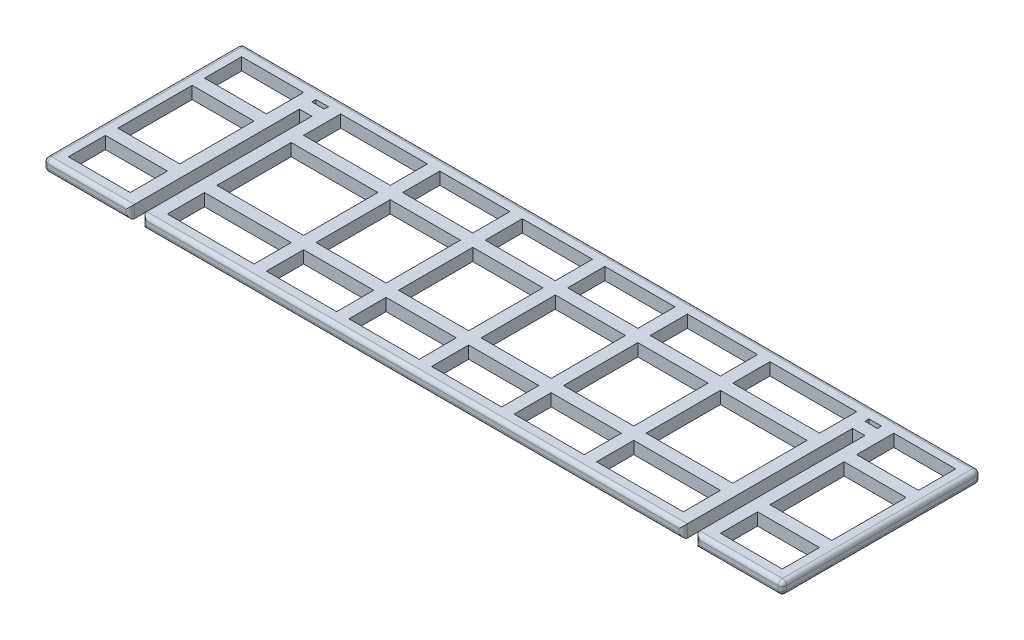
ISO-10303-21;
HEADER;
FILE_DESCRIPTION(('STEP AP214'),'2;1');
FILE_NAME('part.step','',(''),(''),'','','');
FILE_SCHEMA(('AUTOMOTIVE_DESIGN { 1 0 10303 214 1 1 1 1 }'));
ENDSEC;
DATA;
#1=APPLICATION_CONTEXT('core data for automotive mechanical design processes');
#2=APPLICATION_PROTOCOL_DEFINITION('international standard','automotive_design',2000,#1);
#3=PRODUCT_CONTEXT('',#1,'mechanical');
#4=PRODUCT('Part','Part','',(#3));
#5=PRODUCT_RELATED_PRODUCT_CATEGORY('part','',(#4));
#6=PRODUCT_DEFINITION_FORMATION('','',#4);
#7=PRODUCT_DEFINITION_CONTEXT('part definition',#1,'design');
#8=PRODUCT_DEFINITION('design','',#6,#7);
#9=PRODUCT_DEFINITION_SHAPE('','',#8);
#10=(LENGTH_UNIT() NAMED_UNIT(*) SI_UNIT(.MILLI.,.METRE.));
#11=(NAMED_UNIT(*) PLANE_ANGLE_UNIT() SI_UNIT($,.RADIAN.));
#12=(NAMED_UNIT(*) SI_UNIT($,.STERADIAN.) SOLID_ANGLE_UNIT());
#13=UNCERTAINTY_MEASURE_WITH_UNIT(LENGTH_MEASURE(1.E-05),#10,'distance_accuracy_value','');
#14=(GEOMETRIC_REPRESENTATION_CONTEXT(3) GLOBAL_UNCERTAINTY_ASSIGNED_CONTEXT((#13)) GLOBAL_UNIT_ASSIGNED_CONTEXT((#10,
#11,#12)) REPRESENTATION_CONTEXT('',''));
#15=CARTESIAN_POINT('',(0.,0.,0.));
#16=DIRECTION('',(0.,0.,1.));
#17=DIRECTION('',(1.,0.,0.));
#18=AXIS2_PLACEMENT_3D('',#15,#16,#17);
#19=CARTESIAN_POINT('',(4.7625,0.,-71.4375));
#20=DIRECTION('',(-1.,0.,0.));
#21=DIRECTION('',(0.,0.,1.));
#22=AXIS2_PLACEMENT_3D('',#19,#20,#21);
#23=PLANE('',#22);
#24=DIRECTION('',(0.,1.,0.));
#25=VECTOR('',#24,1.);
#26=CARTESIAN_POINT('',(4.7625,0.,-19.05));
#27=LINE('',#26,#25);
#28=CARTESIAN_POINT('',(4.7625,0.,-19.05));
#29=VERTEX_POINT('',#28);
#30=CARTESIAN_POINT('',(4.7625,4.76249999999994,-19.05));
#31=VERTEX_POINT('',#30);
#32=EDGE_CURVE('E830',#29,#31,#27,.T.);
#33=ORIENTED_EDGE('',*,*,#32,.T.);
#34=DIRECTION('',(0.,0.,-1.));
#35=VECTOR('',#34,1.);
#36=CARTESIAN_POINT('',(4.7625,4.7625,0.));
#37=LINE('',#36,#35);
#38=CARTESIAN_POINT('',(4.7625,4.7625,-4.7625));
#39=VERTEX_POINT('',#38);
#40=EDGE_CURVE('E876',#39,#31,#37,.T.);
#41=ORIENTED_EDGE('',*,*,#40,.F.);
#42=DIRECTION('',(0.,1.,0.));
#43=VECTOR('',#42,1.);
#44=CARTESIAN_POINT('',(4.7625,0.,-4.7625));
#45=LINE('',#44,#43);
#46=CARTESIAN_POINT('',(4.7625,0.,-4.7625));
#47=VERTEX_POINT('',#46);
#48=EDGE_CURVE('E853',#47,#39,#45,.T.);
#49=ORIENTED_EDGE('',*,*,#48,.F.);
#50=DIRECTION('',(0.,0.,1.));
#51=VECTOR('',#50,1.);
#52=CARTESIAN_POINT('',(4.7625,0.,-71.4375));
#53=LINE('',#52,#51);
#54=EDGE_CURVE('E845',#29,#47,#53,.T.);
#55=ORIENTED_EDGE('',*,*,#54,.F.);
#56=EDGE_LOOP('',(#33,#41,#49,#55));
#57=FACE_BOUND('',#56,.T.);
#58=ADVANCED_FACE('F33',(#57),#23,.F.);
#59=DIRECTION('',(0.,-1.,0.));
#60=VECTOR('',#59,1.);
#61=CARTESIAN_POINT('',(4.7625,4.76249999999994,-23.8125));
#62=LINE('',#61,#60);
#63=CARTESIAN_POINT('',(4.7625,4.7625,-23.8125));
#64=VERTEX_POINT('',#63);
#65=CARTESIAN_POINT('',(4.7625,0.,-23.8125));
#66=VERTEX_POINT('',#65);
#67=EDGE_CURVE('E823',#64,#66,#62,.T.);
#68=ORIENTED_EDGE('',*,*,#67,.T.);
#69=CARTESIAN_POINT('',(4.7625,0.,-52.3875));
#70=VERTEX_POINT('',#69);
#71=EDGE_CURVE('E836',#70,#66,#53,.T.);
#72=ORIENTED_EDGE('',*,*,#71,.F.);
#73=DIRECTION('',(0.,1.,0.));
#74=VECTOR('',#73,1.);
#75=CARTESIAN_POINT('',(4.7625,0.,-52.3875));
#76=LINE('',#75,#74);
#77=CARTESIAN_POINT('',(4.7625,4.76249999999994,-52.3875));
#78=VERTEX_POINT('',#77);
#79=EDGE_CURVE('E1949',#70,#78,#76,.T.);
#80=ORIENTED_EDGE('',*,*,#79,.T.);
#81=EDGE_CURVE('E837',#64,#78,#37,.T.);
#82=ORIENTED_EDGE('',*,*,#81,.F.);
#83=EDGE_LOOP('',(#68,#72,#80,#82));
#84=FACE_BOUND('',#83,.T.);
#85=ADVANCED_FACE('F834',(#84),#23,.F.);
#86=CARTESIAN_POINT('',(28.575,4.7625,-69.85));
#87=DIRECTION('',(1.,0.,0.));
#88=DIRECTION('',(0.,0.,-1.));
#89=AXIS2_PLACEMENT_3D('',#86,#87,#88);
#90=PLANE('',#89);
#91=DIRECTION('',(0.,1.,0.));
#92=VECTOR('',#91,1.);
#93=CARTESIAN_POINT('',(28.575,0.,-19.05));
#94=LINE('',#93,#92);
#95=CARTESIAN_POINT('',(28.575,0.,-19.05));
#96=VERTEX_POINT('',#95);
#97=CARTESIAN_POINT('',(28.575,4.7625,-19.05));
#98=VERTEX_POINT('',#97);
#99=EDGE_CURVE('E1964',#96,#98,#94,.T.);
#100=ORIENTED_EDGE('',*,*,#99,.F.);
#101=DIRECTION('',(0.,0.,1.));
#102=VECTOR('',#101,1.);
#103=CARTESIAN_POINT('',(28.575,0.,-69.85));
#104=LINE('',#103,#102);
#105=CARTESIAN_POINT('',(28.575,0.,-4.7625));
#106=VERTEX_POINT('',#105);
#107=EDGE_CURVE('E1303',#96,#106,#104,.T.);
#108=ORIENTED_EDGE('',*,*,#107,.T.);
#109=DIRECTION('',(0.,1.,0.));
#110=VECTOR('',#109,1.);
#111=CARTESIAN_POINT('',(28.575,4.7625,-4.7625));
#112=LINE('',#111,#110);
#113=CARTESIAN_POINT('',(28.575,4.7625,-4.7625));
#114=VERTEX_POINT('',#113);
#115=EDGE_CURVE('E1291',#106,#114,#112,.T.);
#116=ORIENTED_EDGE('',*,*,#115,.T.);
#117=DIRECTION('',(0.,0.,1.));
#118=VECTOR('',#117,1.);
#119=CARTESIAN_POINT('',(28.575,4.7625,-69.85));
#120=LINE('',#119,#118);
#121=EDGE_CURVE('E1299',#98,#114,#120,.T.);
#122=ORIENTED_EDGE('',*,*,#121,.F.);
#123=EDGE_LOOP('',(#100,#108,#116,#122));
#124=FACE_BOUND('',#123,.T.);
#125=ADVANCED_FACE('F1983',(#124),#90,.F.);
#126=DIRECTION('',(0.,-1.,0.));
#127=VECTOR('',#126,1.);
#128=CARTESIAN_POINT('',(28.575,4.76249999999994,-23.8125));
#129=LINE('',#128,#127);
#130=CARTESIAN_POINT('',(28.575,4.76249999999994,-23.8125));
#131=VERTEX_POINT('',#130);
#132=CARTESIAN_POINT('',(28.575,0.,-23.8125));
#133=VERTEX_POINT('',#132);
#134=EDGE_CURVE('E826',#131,#133,#129,.T.);
#135=ORIENTED_EDGE('',*,*,#134,.F.);
#136=CARTESIAN_POINT('',(28.575,4.7625,-52.3875));
#137=VERTEX_POINT('',#136);
#138=EDGE_CURVE('E1304',#137,#131,#120,.T.);
#139=ORIENTED_EDGE('',*,*,#138,.F.);
#140=DIRECTION('',(0.,1.,0.));
#141=VECTOR('',#140,1.);
#142=CARTESIAN_POINT('',(28.575,0.,-52.3875));
#143=LINE('',#142,#141);
#144=CARTESIAN_POINT('',(28.575,0.,-52.3875));
#145=VERTEX_POINT('',#144);
#146=EDGE_CURVE('E1945',#145,#137,#143,.T.);
#147=ORIENTED_EDGE('',*,*,#146,.F.);
#148=EDGE_CURVE('E1308',#145,#133,#104,.T.);
#149=ORIENTED_EDGE('',*,*,#148,.T.);
#150=EDGE_LOOP('',(#135,#139,#147,#149));
#151=FACE_BOUND('',#150,.T.);
#152=ADVANCED_FACE('F1992',(#151),#90,.F.);
#153=DIRECTION('',(0.,-1.,0.));
#154=VECTOR('',#153,1.);
#155=CARTESIAN_POINT('',(4.7625,4.76249999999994,-57.15));
#156=LINE('',#155,#154);
#157=CARTESIAN_POINT('',(4.7625,4.76249999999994,-57.15));
#158=VERTEX_POINT('',#157);
#159=CARTESIAN_POINT('',(4.7625,0.,-57.15));
#160=VERTEX_POINT('',#159);
#161=EDGE_CURVE('E1924',#158,#160,#156,.T.);
#162=ORIENTED_EDGE('',*,*,#161,.T.);
#163=CARTESIAN_POINT('',(4.7625,0.,-71.4375));
#164=VERTEX_POINT('',#163);
#165=EDGE_CURVE('E844',#164,#160,#53,.T.);
#166=ORIENTED_EDGE('',*,*,#165,.F.);
#167=DIRECTION('',(0.,1.,0.));
#168=VECTOR('',#167,1.);
#169=CARTESIAN_POINT('',(4.7625,0.,-71.4375));
#170=LINE('',#169,#168);
#171=CARTESIAN_POINT('',(4.7625,4.7625,-71.4375));
#172=VERTEX_POINT('',#171);
#173=EDGE_CURVE('E857',#164,#172,#170,.T.);
#174=ORIENTED_EDGE('',*,*,#173,.T.);
#175=EDGE_CURVE('E873',#158,#172,#37,.T.);
#176=ORIENTED_EDGE('',*,*,#175,.F.);
#177=EDGE_LOOP('',(#162,#166,#174,#176));
#178=FACE_BOUND('',#177,.T.);
#179=ADVANCED_FACE('F2002',(#178),#23,.F.);
#180=DIRECTION('',(0.,-1.,0.));
#181=VECTOR('',#180,1.);
#182=CARTESIAN_POINT('',(28.575,4.76249999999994,-57.15));
#183=LINE('',#182,#181);
#184=CARTESIAN_POINT('',(28.575,4.7625,-57.15));
#185=VERTEX_POINT('',#184);
#186=CARTESIAN_POINT('',(28.575,0.,-57.15));
#187=VERTEX_POINT('',#186);
#188=EDGE_CURVE('E1950',#185,#187,#183,.T.);
#189=ORIENTED_EDGE('',*,*,#188,.F.);
#190=CARTESIAN_POINT('',(28.575,4.7625,-71.4375));
#191=VERTEX_POINT('',#190);
#192=EDGE_CURVE('E1300',#191,#185,#120,.T.);
#193=ORIENTED_EDGE('',*,*,#192,.F.);
#194=DIRECTION('',(0.,-1.,0.));
#195=VECTOR('',#194,1.);
#196=CARTESIAN_POINT('',(28.575,4.7625,-71.4375));
#197=LINE('',#196,#195);
#198=CARTESIAN_POINT('',(28.575,0.,-71.4375));
#199=VERTEX_POINT('',#198);
#200=EDGE_CURVE('E1277',#191,#199,#197,.T.);
#201=ORIENTED_EDGE('',*,*,#200,.T.);
#202=EDGE_CURVE('E1305',#199,#187,#104,.T.);
#203=ORIENTED_EDGE('',*,*,#202,.T.);
#204=EDGE_LOOP('',(#189,#193,#201,#203));
#205=FACE_BOUND('',#204,.T.);
#206=ADVANCED_FACE('F2010',(#205),#90,.F.);
#207=CARTESIAN_POINT('',(279.4,0.,-4.7625));
#208=DIRECTION('',(1.,0.,0.));
#209=DIRECTION('',(0.,0.,-1.));
#210=AXIS2_PLACEMENT_3D('',#207,#208,#209);
#211=PLANE('',#210);
#212=DIRECTION('',(0.,-1.,0.));
#213=VECTOR('',#212,1.);
#214=CARTESIAN_POINT('',(279.4,4.76249999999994,-19.05));
#215=LINE('',#214,#213);
#216=CARTESIAN_POINT('',(279.4,4.7625,-19.05));
#217=VERTEX_POINT('',#216);
#218=CARTESIAN_POINT('',(279.4,0.,-19.05));
#219=VERTEX_POINT('',#218);
#220=EDGE_CURVE('E1928',#217,#219,#215,.T.);
#221=ORIENTED_EDGE('',*,*,#220,.T.);
#222=DIRECTION('',(0.,0.,-1.));
#223=VECTOR('',#222,1.);
#224=CARTESIAN_POINT('',(279.4,0.,-4.7625));
#225=LINE('',#224,#223);
#226=CARTESIAN_POINT('',(279.4,0.,-4.7625));
#227=VERTEX_POINT('',#226);
#228=EDGE_CURVE('E1106',#227,#219,#225,.T.);
#229=ORIENTED_EDGE('',*,*,#228,.F.);
#230=DIRECTION('',(0.,1.,0.));
#231=VECTOR('',#230,1.);
#232=CARTESIAN_POINT('',(279.4,0.,-4.7625));
#233=LINE('',#232,#231);
#234=CARTESIAN_POINT('',(279.4,4.7625,-4.7625));
#235=VERTEX_POINT('',#234);
#236=EDGE_CURVE('E848',#227,#235,#233,.T.);
#237=ORIENTED_EDGE('',*,*,#236,.T.);
#238=DIRECTION('',(0.,0.,1.));
#239=VECTOR('',#238,1.);
#240=CARTESIAN_POINT('',(279.4,4.7625,0.));
#241=LINE('',#240,#239);
#242=EDGE_CURVE('E856',#217,#235,#241,.T.);
#243=ORIENTED_EDGE('',*,*,#242,.F.);
#244=EDGE_LOOP('',(#221,#229,#237,#243));
#245=FACE_BOUND('',#244,.T.);
#246=ADVANCED_FACE('F2016',(#245),#211,.F.);
#247=DIRECTION('',(0.,1.,0.));
#248=VECTOR('',#247,1.);
#249=CARTESIAN_POINT('',(279.4,0.,-23.8125));
#250=LINE('',#249,#248);
#251=CARTESIAN_POINT('',(279.4,0.,-23.8125));
#252=VERTEX_POINT('',#251);
#253=CARTESIAN_POINT('',(279.4,4.76249999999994,-23.8125));
#254=VERTEX_POINT('',#253);
#255=EDGE_CURVE('E1937',#252,#254,#250,.T.);
#256=ORIENTED_EDGE('',*,*,#255,.T.);
#257=CARTESIAN_POINT('',(279.4,4.7625,-52.3875));
#258=VERTEX_POINT('',#257);
#259=EDGE_CURVE('E869',#258,#254,#241,.T.);
#260=ORIENTED_EDGE('',*,*,#259,.F.);
#261=DIRECTION('',(0.,-1.,0.));
#262=VECTOR('',#261,1.);
#263=CARTESIAN_POINT('',(279.4,4.76249999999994,-52.3875));
#264=LINE('',#263,#262);
#265=CARTESIAN_POINT('',(279.4,0.,-52.3875));
#266=VERTEX_POINT('',#265);
#267=EDGE_CURVE('E1906',#258,#266,#264,.T.);
#268=ORIENTED_EDGE('',*,*,#267,.T.);
#269=EDGE_CURVE('E1109',#252,#266,#225,.T.);
#270=ORIENTED_EDGE('',*,*,#269,.F.);
#271=EDGE_LOOP('',(#256,#260,#268,#270));
#272=FACE_BOUND('',#271,.T.);
#273=ADVANCED_FACE('F2135',(#272),#211,.F.);
#274=CARTESIAN_POINT('',(255.5875,4.7625,-69.85));
#275=DIRECTION('',(1.,0.,0.));
#276=DIRECTION('',(0.,0.,-1.));
#277=AXIS2_PLACEMENT_3D('',#274,#275,#276);
#278=PLANE('',#277);
#279=DIRECTION('',(0.,0.,1.));
#280=VECTOR('',#279,1.);
#281=CARTESIAN_POINT('',(255.5875,0.,-69.85));
#282=LINE('',#281,#280);
#283=CARTESIAN_POINT('',(255.5875,0.,-19.05));
#284=VERTEX_POINT('',#283);
#285=CARTESIAN_POINT('',(255.5875,0.,-4.7625));
#286=VERTEX_POINT('',#285);
#287=EDGE_CURVE('E1232',#284,#286,#282,.T.);
#288=ORIENTED_EDGE('',*,*,#287,.F.);
#289=DIRECTION('',(0.,-1.,0.));
#290=VECTOR('',#289,1.);
#291=CARTESIAN_POINT('',(255.5875,4.76249999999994,-19.05));
#292=LINE('',#291,#290);
#293=CARTESIAN_POINT('',(255.5875,4.76249999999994,-19.05));
#294=VERTEX_POINT('',#293);
#295=EDGE_CURVE('E1923',#294,#284,#292,.T.);
#296=ORIENTED_EDGE('',*,*,#295,.F.);
#297=DIRECTION('',(0.,0.,1.));
#298=VECTOR('',#297,1.);
#299=CARTESIAN_POINT('',(255.5875,4.7625,-69.85));
#300=LINE('',#299,#298);
#301=CARTESIAN_POINT('',(255.5875,4.7625,-4.7625));
#302=VERTEX_POINT('',#301);
#303=EDGE_CURVE('E1235',#294,#302,#300,.T.);
#304=ORIENTED_EDGE('',*,*,#303,.T.);
#305=DIRECTION('',(0.,1.,0.));
#306=VECTOR('',#305,1.);
#307=CARTESIAN_POINT('',(255.5875,4.7625,-4.7625));
#308=LINE('',#307,#306);
#309=EDGE_CURVE('E1224',#286,#302,#308,.T.);
#310=ORIENTED_EDGE('',*,*,#309,.F.);
#311=EDGE_LOOP('',(#288,#296,#304,#310));
#312=FACE_BOUND('',#311,.T.);
#313=ADVANCED_FACE('F2131',(#312),#278,.T.);
#314=CARTESIAN_POINT('',(255.5875,4.76249999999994,-52.3875));
#315=VERTEX_POINT('',#314);
#316=CARTESIAN_POINT('',(255.5875,4.7625,-23.8125));
#317=VERTEX_POINT('',#316);
#318=EDGE_CURVE('E1239',#315,#317,#300,.T.);
#319=ORIENTED_EDGE('',*,*,#318,.T.);
#320=DIRECTION('',(0.,1.,0.));
#321=VECTOR('',#320,1.);
#322=CARTESIAN_POINT('',(255.5875,0.,-23.8125));
#323=LINE('',#322,#321);
#324=CARTESIAN_POINT('',(255.5875,0.,-23.8125));
#325=VERTEX_POINT('',#324);
#326=EDGE_CURVE('E1929',#325,#317,#323,.T.);
#327=ORIENTED_EDGE('',*,*,#326,.F.);
#328=CARTESIAN_POINT('',(255.5875,0.,-52.3875));
#329=VERTEX_POINT('',#328);
#330=EDGE_CURVE('E1236',#329,#325,#282,.T.);
#331=ORIENTED_EDGE('',*,*,#330,.F.);
#332=DIRECTION('',(0.,-1.,0.));
#333=VECTOR('',#332,1.);
#334=CARTESIAN_POINT('',(255.5875,4.76249999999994,-52.3875));
#335=LINE('',#334,#333);
#336=EDGE_CURVE('E1911',#315,#329,#335,.T.);
#337=ORIENTED_EDGE('',*,*,#336,.F.);
#338=EDGE_LOOP('',(#319,#327,#331,#337));
#339=FACE_BOUND('',#338,.T.);
#340=ADVANCED_FACE('F2134',(#339),#278,.T.);
#341=DIRECTION('',(0.,1.,0.));
#342=VECTOR('',#341,1.);
#343=CARTESIAN_POINT('',(279.4,0.,-57.15));
#344=LINE('',#343,#342);
#345=CARTESIAN_POINT('',(279.4,0.,-57.15));
#346=VERTEX_POINT('',#345);
#347=CARTESIAN_POINT('',(279.4,4.76249999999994,-57.15));
#348=VERTEX_POINT('',#347);
#349=EDGE_CURVE('E1136',#346,#348,#344,.T.);
#350=ORIENTED_EDGE('',*,*,#349,.T.);
#351=CARTESIAN_POINT('',(279.4,4.7625,-71.4375));
#352=VERTEX_POINT('',#351);
#353=EDGE_CURVE('E865',#352,#348,#241,.T.);
#354=ORIENTED_EDGE('',*,*,#353,.F.);
#355=DIRECTION('',(0.,1.,0.));
#356=VECTOR('',#355,1.);
#357=CARTESIAN_POINT('',(279.4,0.,-71.4375));
#358=LINE('',#357,#356);
#359=CARTESIAN_POINT('',(279.4,0.,-71.4375));
#360=VERTEX_POINT('',#359);
#361=EDGE_CURVE('E860',#360,#352,#358,.T.);
#362=ORIENTED_EDGE('',*,*,#361,.F.);
#363=EDGE_CURVE('E1105',#346,#360,#225,.T.);
#364=ORIENTED_EDGE('',*,*,#363,.F.);
#365=EDGE_LOOP('',(#350,#354,#362,#364));
#366=FACE_BOUND('',#365,.T.);
#367=ADVANCED_FACE('F1135',(#366),#211,.F.);
#368=CARTESIAN_POINT('',(255.5875,4.7625,-71.4375));
#369=VERTEX_POINT('',#368);
#370=CARTESIAN_POINT('',(255.5875,4.7625,-57.15));
#371=VERTEX_POINT('',#370);
#372=EDGE_CURVE('E1141',#369,#371,#300,.T.);
#373=ORIENTED_EDGE('',*,*,#372,.T.);
#374=DIRECTION('',(0.,1.,0.));
#375=VECTOR('',#374,1.);
#376=CARTESIAN_POINT('',(255.5875,0.,-57.15));
#377=LINE('',#376,#375);
#378=CARTESIAN_POINT('',(255.5875,0.,-57.15));
#379=VERTEX_POINT('',#378);
#380=EDGE_CURVE('E1917',#379,#371,#377,.T.);
#381=ORIENTED_EDGE('',*,*,#380,.F.);
#382=CARTESIAN_POINT('',(255.5875,0.,-71.4375));
#383=VERTEX_POINT('',#382);
#384=EDGE_CURVE('E1233',#383,#379,#282,.T.);
#385=ORIENTED_EDGE('',*,*,#384,.F.);
#386=DIRECTION('',(0.,-1.,0.));
#387=VECTOR('',#386,1.);
#388=CARTESIAN_POINT('',(255.5875,4.7625,-71.4375));
#389=LINE('',#388,#387);
#390=EDGE_CURVE('E1131',#369,#383,#389,.T.);
#391=ORIENTED_EDGE('',*,*,#390,.F.);
#392=EDGE_LOOP('',(#373,#381,#385,#391));
#393=FACE_BOUND('',#392,.T.);
#394=ADVANCED_FACE('F2137',(#393),#278,.T.);
#395=CARTESIAN_POINT('',(279.4,0.,-71.4375));
#396=DIRECTION('',(0.,0.,-1.));
#397=DIRECTION('',(-1.,0.,0.));
#398=AXIS2_PLACEMENT_3D('',#395,#396,#397);
#399=PLANE('',#398);
#400=DIRECTION('',(0.,-1.,0.));
#401=VECTOR('',#400,1.);
#402=CARTESIAN_POINT('',(207.9625,4.76250000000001,-71.4375));
#403=LINE('',#402,#401);
#404=CARTESIAN_POINT('',(207.9625,4.7625,-71.4375));
#405=VERTEX_POINT('',#404);
#406=CARTESIAN_POINT('',(207.9625,0.,-71.4375));
#407=VERTEX_POINT('',#406);
#408=EDGE_CURVE('E1862',#405,#407,#403,.T.);
#409=ORIENTED_EDGE('',*,*,#408,.T.);
#410=DIRECTION('',(-1.,0.,0.));
#411=VECTOR('',#410,1.);
#412=CARTESIAN_POINT('',(279.4,0.,-71.4375));
#413=LINE('',#412,#411);
#414=CARTESIAN_POINT('',(241.3,0.,-71.4375));
#415=VERTEX_POINT('',#414);
#416=EDGE_CURVE('E1189',#415,#407,#413,.T.);
#417=ORIENTED_EDGE('',*,*,#416,.F.);
#418=DIRECTION('',(0.,1.,0.));
#419=VECTOR('',#418,1.);
#420=CARTESIAN_POINT('',(241.3,0.,-71.4375));
#421=LINE('',#420,#419);
#422=CARTESIAN_POINT('',(241.3,4.7625,-71.4375));
#423=VERTEX_POINT('',#422);
#424=EDGE_CURVE('E1179',#415,#423,#421,.T.);
#425=ORIENTED_EDGE('',*,*,#424,.T.);
#426=DIRECTION('',(1.,0.,0.));
#427=VECTOR('',#426,1.);
#428=CARTESIAN_POINT('',(284.1625,4.7625,-71.4375));
#429=LINE('',#428,#427);
#430=EDGE_CURVE('E875',#405,#423,#429,.T.);
#431=ORIENTED_EDGE('',*,*,#430,.F.);
#432=EDGE_LOOP('',(#409,#417,#425,#431));
#433=FACE_BOUND('',#432,.T.);
#434=ADVANCED_FACE('F1187',(#433),#399,.F.);
#435=DIRECTION('',(0.,1.,0.));
#436=VECTOR('',#435,1.);
#437=CARTESIAN_POINT('',(203.2,4.76250000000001,-71.4375));
#438=LINE('',#437,#436);
#439=CARTESIAN_POINT('',(203.2,0.,-71.4375));
#440=VERTEX_POINT('',#439);
#441=CARTESIAN_POINT('',(203.2,4.76250000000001,-71.4375));
#442=VERTEX_POINT('',#441);
#443=EDGE_CURVE('E1859',#440,#442,#438,.T.);
#444=ORIENTED_EDGE('',*,*,#443,.T.);
#445=CARTESIAN_POINT('',(176.2125,4.7625,-71.4375));
#446=VERTEX_POINT('',#445);
#447=EDGE_CURVE('E1152',#446,#442,#429,.T.);
#448=ORIENTED_EDGE('',*,*,#447,.F.);
#449=DIRECTION('',(0.,-1.,0.));
#450=VECTOR('',#449,1.);
#451=CARTESIAN_POINT('',(176.2125,4.76250000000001,-71.4375));
#452=LINE('',#451,#450);
#453=CARTESIAN_POINT('',(176.2125,0.,-71.4375));
#454=VERTEX_POINT('',#453);
#455=EDGE_CURVE('E1752',#446,#454,#452,.T.);
#456=ORIENTED_EDGE('',*,*,#455,.T.);
#457=EDGE_CURVE('E1133',#440,#454,#413,.T.);
#458=ORIENTED_EDGE('',*,*,#457,.F.);
#459=EDGE_LOOP('',(#444,#448,#456,#458));
#460=FACE_BOUND('',#459,.T.);
#461=ADVANCED_FACE('F2185',(#460),#399,.F.);
#462=CARTESIAN_POINT('',(4.7625,0.,-4.7625));
#463=DIRECTION('',(0.,0.,1.));
#464=DIRECTION('',(1.,0.,0.));
#465=AXIS2_PLACEMENT_3D('',#462,#463,#464);
#466=PLANE('',#465);
#467=DIRECTION('',(0.,-1.,0.));
#468=VECTOR('',#467,1.);
#469=CARTESIAN_POINT('',(207.9625,4.76250000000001,-4.7625));
#470=LINE('',#469,#468);
#471=CARTESIAN_POINT('',(207.9625,4.76250000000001,-4.7625));
#472=VERTEX_POINT('',#471);
#473=CARTESIAN_POINT('',(207.9625,0.,-4.7625));
#474=VERTEX_POINT('',#473);
#475=EDGE_CURVE('E1375',#472,#474,#470,.T.);
#476=ORIENTED_EDGE('',*,*,#475,.F.);
#477=DIRECTION('',(-1.,0.,0.));
#478=VECTOR('',#477,1.);
#479=CARTESIAN_POINT('',(284.1625,4.7625,-4.7625));
#480=LINE('',#479,#478);
#481=CARTESIAN_POINT('',(241.3,4.7625,-4.7625));
#482=VERTEX_POINT('',#481);
#483=EDGE_CURVE('E884',#482,#472,#480,.T.);
#484=ORIENTED_EDGE('',*,*,#483,.F.);
#485=DIRECTION('',(0.,-1.,0.));
#486=VECTOR('',#485,1.);
#487=CARTESIAN_POINT('',(241.3,0.,-4.7625));
#488=LINE('',#487,#486);
#489=CARTESIAN_POINT('',(241.3,0.,-4.7625));
#490=VERTEX_POINT('',#489);
#491=EDGE_CURVE('E1241',#482,#490,#488,.T.);
#492=ORIENTED_EDGE('',*,*,#491,.T.);
#493=DIRECTION('',(1.,0.,0.));
#494=VECTOR('',#493,1.);
#495=CARTESIAN_POINT('',(4.7625,0.,-4.7625));
#496=LINE('',#495,#494);
#497=EDGE_CURVE('E1094',#474,#490,#496,.T.);
#498=ORIENTED_EDGE('',*,*,#497,.F.);
#499=EDGE_LOOP('',(#476,#484,#492,#498));
#500=FACE_BOUND('',#499,.T.);
#501=ADVANCED_FACE('F1373',(#500),#466,.F.);
#502=DIRECTION('',(0.,1.,0.));
#503=VECTOR('',#502,1.);
#504=CARTESIAN_POINT('',(203.2,4.76250000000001,-4.7625));
#505=LINE('',#504,#503);
#506=CARTESIAN_POINT('',(203.2,0.,-4.7625));
#507=VERTEX_POINT('',#506);
#508=CARTESIAN_POINT('',(203.2,4.7625,-4.7625));
#509=VERTEX_POINT('',#508);
#510=EDGE_CURVE('E1844',#507,#509,#505,.T.);
#511=ORIENTED_EDGE('',*,*,#510,.F.);
#512=CARTESIAN_POINT('',(176.2125,0.,-4.7625));
#513=VERTEX_POINT('',#512);
#514=EDGE_CURVE('E1346',#513,#507,#496,.T.);
#515=ORIENTED_EDGE('',*,*,#514,.F.);
#516=DIRECTION('',(0.,-1.,0.));
#517=VECTOR('',#516,1.);
#518=CARTESIAN_POINT('',(176.2125,4.76250000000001,-4.7625));
#519=LINE('',#518,#517);
#520=CARTESIAN_POINT('',(176.2125,4.76250000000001,-4.7625));
#521=VERTEX_POINT('',#520);
#522=EDGE_CURVE('E1735',#521,#513,#519,.T.);
#523=ORIENTED_EDGE('',*,*,#522,.F.);
#524=EDGE_CURVE('E885',#509,#521,#480,.T.);
#525=ORIENTED_EDGE('',*,*,#524,.F.);
#526=EDGE_LOOP('',(#511,#515,#523,#525));
#527=FACE_BOUND('',#526,.T.);
#528=ADVANCED_FACE('F1843',(#527),#466,.F.);
#529=CARTESIAN_POINT('',(248.035192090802,4.76250000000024,-23.8125));
#530=DIRECTION('',(0.,0.,1.));
#531=DIRECTION('',(1.,0.,0.));
#532=AXIS2_PLACEMENT_3D('',#529,#530,#531);
#533=PLANE('',#532);
#534=DIRECTION('',(0.,-1.,0.));
#535=VECTOR('',#534,1.);
#536=CARTESIAN_POINT('',(207.9625,4.76250000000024,-23.8125));
#537=LINE('',#536,#535);
#538=CARTESIAN_POINT('',(207.9625,4.76250000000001,-23.8125));
#539=VERTEX_POINT('',#538);
#540=CARTESIAN_POINT('',(207.9625,0.,-23.8125));
#541=VERTEX_POINT('',#540);
#542=EDGE_CURVE('E1824',#539,#541,#537,.T.);
#543=ORIENTED_EDGE('',*,*,#542,.F.);
#544=DIRECTION('',(-1.,0.,0.));
#545=VECTOR('',#544,1.);
#546=CARTESIAN_POINT('',(248.035192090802,4.76250000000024,-23.8125));
#547=LINE('',#546,#545);
#548=CARTESIAN_POINT('',(241.3,4.76250000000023,-23.8125));
#549=VERTEX_POINT('',#548);
#550=EDGE_CURVE('E1623',#549,#539,#547,.T.);
#551=ORIENTED_EDGE('',*,*,#550,.F.);
#552=DIRECTION('',(0.,-1.,0.));
#553=VECTOR('',#552,1.);
#554=CARTESIAN_POINT('',(241.3,4.76250000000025,-23.8125));
#555=LINE('',#554,#553);
#556=CARTESIAN_POINT('',(241.3,0.,-23.8125));
#557=VERTEX_POINT('',#556);
#558=EDGE_CURVE('E1609',#549,#557,#555,.T.);
#559=ORIENTED_EDGE('',*,*,#558,.T.);
#560=DIRECTION('',(-1.,0.,0.));
#561=VECTOR('',#560,1.);
#562=CARTESIAN_POINT('',(248.035192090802,3.56378261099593E-13,-23.8125));
#563=LINE('',#562,#561);
#564=EDGE_CURVE('E1629',#557,#541,#563,.T.);
#565=ORIENTED_EDGE('',*,*,#564,.T.);
#566=EDGE_LOOP('',(#543,#551,#559,#565));
#567=FACE_BOUND('',#566,.T.);
#568=ADVANCED_FACE('F1896',(#567),#533,.F.);
#569=DIRECTION('',(0.,1.,0.));
#570=VECTOR('',#569,1.);
#571=CARTESIAN_POINT('',(203.2,4.76250000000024,-23.8125));
#572=LINE('',#571,#570);
#573=CARTESIAN_POINT('',(203.2,0.,-23.8125));
#574=VERTEX_POINT('',#573);
#575=CARTESIAN_POINT('',(203.2,4.76250000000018,-23.8125));
#576=VERTEX_POINT('',#575);
#577=EDGE_CURVE('E1876',#574,#576,#572,.T.);
#578=ORIENTED_EDGE('',*,*,#577,.F.);
#579=CARTESIAN_POINT('',(176.2125,0.,-23.8125));
#580=VERTEX_POINT('',#579);
#581=EDGE_CURVE('E1632',#574,#580,#563,.T.);
#582=ORIENTED_EDGE('',*,*,#581,.T.);
#583=DIRECTION('',(0.,-1.,0.));
#584=VECTOR('',#583,1.);
#585=CARTESIAN_POINT('',(176.2125,4.76250000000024,-23.8125));
#586=LINE('',#585,#584);
#587=CARTESIAN_POINT('',(176.2125,4.76250000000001,-23.8125));
#588=VERTEX_POINT('',#587);
#589=EDGE_CURVE('E1400',#588,#580,#586,.T.);
#590=ORIENTED_EDGE('',*,*,#589,.F.);
#591=EDGE_CURVE('E1627',#576,#588,#547,.T.);
#592=ORIENTED_EDGE('',*,*,#591,.F.);
#593=EDGE_LOOP('',(#578,#582,#590,#592));
#594=FACE_BOUND('',#593,.T.);
#595=ADVANCED_FACE('F2115',(#594),#533,.F.);
#596=CARTESIAN_POINT('',(248.035192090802,4.76250000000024,-19.05));
#597=DIRECTION('',(0.,0.,-1.));
#598=DIRECTION('',(-1.,0.,0.));
#599=AXIS2_PLACEMENT_3D('',#596,#597,#598);
#600=PLANE('',#599);
#601=DIRECTION('',(0.,1.,0.));
#602=VECTOR('',#601,1.);
#603=CARTESIAN_POINT('',(207.9625,4.76250000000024,-19.05));
#604=LINE('',#603,#602);
#605=CARTESIAN_POINT('',(207.9625,2.97409687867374E-13,-19.05));
#606=VERTEX_POINT('',#605);
#607=CARTESIAN_POINT('',(207.9625,4.76250000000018,-19.05));
#608=VERTEX_POINT('',#607);
#609=EDGE_CURVE('E1884',#606,#608,#604,.T.);
#610=ORIENTED_EDGE('',*,*,#609,.F.);
#611=DIRECTION('',(-1.,0.,0.));
#612=VECTOR('',#611,1.);
#613=CARTESIAN_POINT('',(248.035192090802,3.55795023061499E-13,-19.05));
#614=LINE('',#613,#612);
#615=CARTESIAN_POINT('',(241.3,0.,-19.05));
#616=VERTEX_POINT('',#615);
#617=EDGE_CURVE('E1612',#616,#606,#614,.T.);
#618=ORIENTED_EDGE('',*,*,#617,.F.);
#619=DIRECTION('',(0.,1.,0.));
#620=VECTOR('',#619,1.);
#621=CARTESIAN_POINT('',(241.3,4.76250000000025,-19.05));
#622=LINE('',#621,#620);
#623=CARTESIAN_POINT('',(241.3,4.76250000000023,-19.05));
#624=VERTEX_POINT('',#623);
#625=EDGE_CURVE('E1196',#616,#624,#622,.T.);
#626=ORIENTED_EDGE('',*,*,#625,.T.);
#627=DIRECTION('',(-1.,0.,0.));
#628=VECTOR('',#627,1.);
#629=CARTESIAN_POINT('',(248.035192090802,4.76250000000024,-19.05));
#630=LINE('',#629,#628);
#631=EDGE_CURVE('E1618',#624,#608,#630,.T.);
#632=ORIENTED_EDGE('',*,*,#631,.T.);
#633=EDGE_LOOP('',(#610,#618,#626,#632));
#634=FACE_BOUND('',#633,.T.);
#635=ADVANCED_FACE('F2117',(#634),#600,.F.);
#636=DIRECTION('',(0.,-1.,0.));
#637=VECTOR('',#636,1.);
#638=CARTESIAN_POINT('',(203.2,4.76250000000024,-19.05));
#639=LINE('',#638,#637);
#640=CARTESIAN_POINT('',(203.2,4.76250000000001,-19.05));
#641=VERTEX_POINT('',#640);
#642=CARTESIAN_POINT('',(203.2,2.90470793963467E-13,-19.05));
#643=VERTEX_POINT('',#642);
#644=EDGE_CURVE('E1873',#641,#643,#639,.T.);
#645=ORIENTED_EDGE('',*,*,#644,.F.);
#646=CARTESIAN_POINT('',(176.2125,4.76250000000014,-19.05));
#647=VERTEX_POINT('',#646);
#648=EDGE_CURVE('E1621',#641,#647,#630,.T.);
#649=ORIENTED_EDGE('',*,*,#648,.T.);
#650=DIRECTION('',(0.,1.,0.));
#651=VECTOR('',#650,1.);
#652=CARTESIAN_POINT('',(176.2125,4.76250000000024,-19.05));
#653=LINE('',#652,#651);
#654=CARTESIAN_POINT('',(176.2125,2.5115039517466E-13,-19.05));
#655=VERTEX_POINT('',#654);
#656=EDGE_CURVE('E1405',#655,#647,#653,.T.);
#657=ORIENTED_EDGE('',*,*,#656,.F.);
#658=EDGE_CURVE('E1634',#643,#655,#614,.T.);
#659=ORIENTED_EDGE('',*,*,#658,.F.);
#660=EDGE_LOOP('',(#645,#649,#657,#659));
#661=FACE_BOUND('',#660,.T.);
#662=ADVANCED_FACE('F2108',(#661),#600,.F.);
#663=CARTESIAN_POINT('',(248.035192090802,4.76250000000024,-57.15));
#664=DIRECTION('',(0.,0.,1.));
#665=DIRECTION('',(1.,0.,0.));
#666=AXIS2_PLACEMENT_3D('',#663,#664,#665);
#667=PLANE('',#666);
#668=DIRECTION('',(0.,-1.,0.));
#669=VECTOR('',#668,1.);
#670=CARTESIAN_POINT('',(207.9625,4.76250000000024,-57.15));
#671=LINE('',#670,#669);
#672=CARTESIAN_POINT('',(207.9625,4.76250000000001,-57.15));
#673=VERTEX_POINT('',#672);
#674=CARTESIAN_POINT('',(207.9625,0.,-57.15));
#675=VERTEX_POINT('',#674);
#676=EDGE_CURVE('E1882',#673,#675,#671,.T.);
#677=ORIENTED_EDGE('',*,*,#676,.F.);
#678=DIRECTION('',(-1.,0.,0.));
#679=VECTOR('',#678,1.);
#680=CARTESIAN_POINT('',(248.035192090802,4.76250000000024,-57.15));
#681=LINE('',#680,#679);
#682=CARTESIAN_POINT('',(241.3,4.76250000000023,-57.15));
#683=VERTEX_POINT('',#682);
#684=EDGE_CURVE('E1594',#683,#673,#681,.T.);
#685=ORIENTED_EDGE('',*,*,#684,.F.);
#686=DIRECTION('',(0.,-1.,0.));
#687=VECTOR('',#686,1.);
#688=CARTESIAN_POINT('',(241.3,4.76250000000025,-57.15));
#689=LINE('',#688,#687);
#690=CARTESIAN_POINT('',(241.3,0.,-57.15));
#691=VERTEX_POINT('',#690);
#692=EDGE_CURVE('E1182',#683,#691,#689,.T.);
#693=ORIENTED_EDGE('',*,*,#692,.T.);
#694=DIRECTION('',(-1.,0.,0.));
#695=VECTOR('',#694,1.);
#696=CARTESIAN_POINT('',(248.035192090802,3.58497493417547E-13,-57.15));
#697=LINE('',#696,#695);
#698=EDGE_CURVE('E1599',#691,#675,#697,.T.);
#699=ORIENTED_EDGE('',*,*,#698,.T.);
#700=EDGE_LOOP('',(#677,#685,#693,#699));
#701=FACE_BOUND('',#700,.T.);
#702=ADVANCED_FACE('F2105',(#701),#667,.F.);
#703=DIRECTION('',(0.,1.,0.));
#704=VECTOR('',#703,1.);
#705=CARTESIAN_POINT('',(203.2,4.76250000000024,-57.15));
#706=LINE('',#705,#704);
#707=CARTESIAN_POINT('',(203.2,0.,-57.15));
#708=VERTEX_POINT('',#707);
#709=CARTESIAN_POINT('',(203.2,4.76250000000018,-57.15));
#710=VERTEX_POINT('',#709);
#711=EDGE_CURVE('E1711',#708,#710,#706,.T.);
#712=ORIENTED_EDGE('',*,*,#711,.F.);
#713=CARTESIAN_POINT('',(176.2125,0.,-57.15));
#714=VERTEX_POINT('',#713);
#715=EDGE_CURVE('E1603',#708,#714,#697,.T.);
#716=ORIENTED_EDGE('',*,*,#715,.T.);
#717=DIRECTION('',(0.,-1.,0.));
#718=VECTOR('',#717,1.);
#719=CARTESIAN_POINT('',(176.2125,4.76250000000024,-57.15));
#720=LINE('',#719,#718);
#721=CARTESIAN_POINT('',(176.2125,4.76250000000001,-57.15));
#722=VERTEX_POINT('',#721);
#723=EDGE_CURVE('E1709',#722,#714,#720,.T.);
#724=ORIENTED_EDGE('',*,*,#723,.F.);
#725=EDGE_CURVE('E1597',#710,#722,#681,.T.);
#726=ORIENTED_EDGE('',*,*,#725,.F.);
#727=EDGE_LOOP('',(#712,#716,#724,#726));
#728=FACE_BOUND('',#727,.T.);
#729=ADVANCED_FACE('F1707',(#728),#667,.F.);
#730=CARTESIAN_POINT('',(248.035192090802,4.76250000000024,-52.3875));
#731=DIRECTION('',(0.,0.,-1.));
#732=DIRECTION('',(-1.,0.,0.));
#733=AXIS2_PLACEMENT_3D('',#730,#731,#732);
#734=PLANE('',#733);
#735=DIRECTION('',(0.,1.,0.));
#736=VECTOR('',#735,1.);
#737=CARTESIAN_POINT('',(207.9625,4.76250000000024,-52.3875));
#738=LINE('',#737,#736);
#739=CARTESIAN_POINT('',(207.9625,2.99528920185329E-13,-52.3875));
#740=VERTEX_POINT('',#739);
#741=CARTESIAN_POINT('',(207.9625,4.76250000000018,-52.3875));
#742=VERTEX_POINT('',#741);
#743=EDGE_CURVE('E1879',#740,#742,#738,.T.);
#744=ORIENTED_EDGE('',*,*,#743,.F.);
#745=DIRECTION('',(-1.,0.,0.));
#746=VECTOR('',#745,1.);
#747=CARTESIAN_POINT('',(248.035192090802,3.57914255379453E-13,-52.3875));
#748=LINE('',#747,#746);
#749=CARTESIAN_POINT('',(241.3,3.48101177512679E-13,-52.3875));
#750=VERTEX_POINT('',#749);
#751=EDGE_CURVE('E1579',#750,#740,#748,.T.);
#752=ORIENTED_EDGE('',*,*,#751,.F.);
#753=DIRECTION('',(0.,1.,0.));
#754=VECTOR('',#753,1.);
#755=CARTESIAN_POINT('',(241.3,4.76250000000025,-52.3875));
#756=LINE('',#755,#754);
#757=CARTESIAN_POINT('',(241.3,4.7625,-52.3875));
#758=VERTEX_POINT('',#757);
#759=EDGE_CURVE('E1578',#750,#758,#756,.T.);
#760=ORIENTED_EDGE('',*,*,#759,.T.);
#761=DIRECTION('',(-1.,0.,0.));
#762=VECTOR('',#761,1.);
#763=CARTESIAN_POINT('',(248.035192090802,4.76250000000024,-52.3875));
#764=LINE('',#763,#762);
#765=EDGE_CURVE('E1589',#758,#742,#764,.T.);
#766=ORIENTED_EDGE('',*,*,#765,.T.);
#767=EDGE_LOOP('',(#744,#752,#760,#766));
#768=FACE_BOUND('',#767,.T.);
#769=ADVANCED_FACE('F1903',(#768),#734,.F.);
#770=DIRECTION('',(0.,-1.,0.));
#771=VECTOR('',#770,1.);
#772=CARTESIAN_POINT('',(203.2,4.76250000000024,-52.3875));
#773=LINE('',#772,#771);
#774=CARTESIAN_POINT('',(203.2,4.76250000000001,-52.3875));
#775=VERTEX_POINT('',#774);
#776=CARTESIAN_POINT('',(203.2,2.92590026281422E-13,-52.3875));
#777=VERTEX_POINT('',#776);
#778=EDGE_CURVE('E1813',#775,#777,#773,.T.);
#779=ORIENTED_EDGE('',*,*,#778,.F.);
#780=CARTESIAN_POINT('',(176.2125,4.76250000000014,-52.3875));
#781=VERTEX_POINT('',#780);
#782=EDGE_CURVE('E1592',#775,#781,#764,.T.);
#783=ORIENTED_EDGE('',*,*,#782,.T.);
#784=DIRECTION('',(0.,1.,0.));
#785=VECTOR('',#784,1.);
#786=CARTESIAN_POINT('',(176.2125,4.76250000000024,-52.3875));
#787=LINE('',#786,#785);
#788=CARTESIAN_POINT('',(176.2125,2.53269627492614E-13,-52.3875));
#789=VERTEX_POINT('',#788);
#790=EDGE_CURVE('E1722',#789,#781,#787,.T.);
#791=ORIENTED_EDGE('',*,*,#790,.F.);
#792=EDGE_CURVE('E1607',#777,#789,#748,.T.);
#793=ORIENTED_EDGE('',*,*,#792,.F.);
#794=EDGE_LOOP('',(#779,#783,#791,#793));
#795=FACE_BOUND('',#794,.T.);
#796=ADVANCED_FACE('F1810',(#795),#734,.F.);
#797=DIRECTION('',(0.,1.,0.));
#798=VECTOR('',#797,1.);
#799=CARTESIAN_POINT('',(171.45,4.76250000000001,-71.4375));
#800=LINE('',#799,#798);
#801=CARTESIAN_POINT('',(171.45,0.,-71.4375));
#802=VERTEX_POINT('',#801);
#803=CARTESIAN_POINT('',(171.45,4.76250000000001,-71.4375));
#804=VERTEX_POINT('',#803);
#805=EDGE_CURVE('E1749',#802,#804,#800,.T.);
#806=ORIENTED_EDGE('',*,*,#805,.T.);
#807=CARTESIAN_POINT('',(144.4625,4.7625,-71.4375));
#808=VERTEX_POINT('',#807);
#809=EDGE_CURVE('E1144',#808,#804,#429,.T.);
#810=ORIENTED_EDGE('',*,*,#809,.F.);
#811=DIRECTION('',(0.,-1.,0.));
#812=VECTOR('',#811,1.);
#813=CARTESIAN_POINT('',(144.4625,4.76250000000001,-71.4375));
#814=LINE('',#813,#812);
#815=CARTESIAN_POINT('',(144.4625,0.,-71.4375));
#816=VERTEX_POINT('',#815);
#817=EDGE_CURVE('E1543',#808,#816,#814,.T.);
#818=ORIENTED_EDGE('',*,*,#817,.T.);
#819=EDGE_CURVE('E1662',#802,#816,#413,.T.);
#820=ORIENTED_EDGE('',*,*,#819,.F.);
#821=EDGE_LOOP('',(#806,#810,#818,#820));
#822=FACE_BOUND('',#821,.T.);
#823=ADVANCED_FACE('F2716',(#822),#399,.F.);
#824=DIRECTION('',(0.,1.,0.));
#825=VECTOR('',#824,1.);
#826=CARTESIAN_POINT('',(171.45,4.76250000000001,-4.7625));
#827=LINE('',#826,#825);
#828=CARTESIAN_POINT('',(171.45,0.,-4.7625));
#829=VERTEX_POINT('',#828);
#830=CARTESIAN_POINT('',(171.45,4.7625,-4.7625));
#831=VERTEX_POINT('',#830);
#832=EDGE_CURVE('E1747',#829,#831,#827,.T.);
#833=ORIENTED_EDGE('',*,*,#832,.F.);
#834=CARTESIAN_POINT('',(144.4625,0.,-4.7625));
#835=VERTEX_POINT('',#834);
#836=EDGE_CURVE('E1097',#835,#829,#496,.T.);
#837=ORIENTED_EDGE('',*,*,#836,.F.);
#838=DIRECTION('',(0.,-1.,0.));
#839=VECTOR('',#838,1.);
#840=CARTESIAN_POINT('',(144.4625,4.76250000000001,-4.7625));
#841=LINE('',#840,#839);
#842=CARTESIAN_POINT('',(144.4625,4.76250000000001,-4.7625));
#843=VERTEX_POINT('',#842);
#844=EDGE_CURVE('E1534',#843,#835,#841,.T.);
#845=ORIENTED_EDGE('',*,*,#844,.F.);
#846=EDGE_CURVE('E1378',#831,#843,#480,.T.);
#847=ORIENTED_EDGE('',*,*,#846,.F.);
#848=EDGE_LOOP('',(#833,#837,#845,#847));
#849=FACE_BOUND('',#848,.T.);
#850=ADVANCED_FACE('F2698',(#849),#466,.F.);
#851=DIRECTION('',(0.,1.,0.));
#852=VECTOR('',#851,1.);
#853=CARTESIAN_POINT('',(171.45,4.76250000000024,-23.8125));
#854=LINE('',#853,#852);
#855=CARTESIAN_POINT('',(171.45,0.,-23.8125));
#856=VERTEX_POINT('',#855);
#857=CARTESIAN_POINT('',(171.45,4.76250000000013,-23.8125));
#858=VERTEX_POINT('',#857);
#859=EDGE_CURVE('E1774',#856,#858,#854,.T.);
#860=ORIENTED_EDGE('',*,*,#859,.F.);
#861=CARTESIAN_POINT('',(144.4625,0.,-23.8125));
#862=VERTEX_POINT('',#861);
#863=EDGE_CURVE('E1782',#856,#862,#563,.T.);
#864=ORIENTED_EDGE('',*,*,#863,.T.);
#865=DIRECTION('',(0.,-1.,0.));
#866=VECTOR('',#865,1.);
#867=CARTESIAN_POINT('',(144.4625,4.76250000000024,-23.8125));
#868=LINE('',#867,#866);
#869=CARTESIAN_POINT('',(144.4625,4.76250000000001,-23.8125));
#870=VERTEX_POINT('',#869);
#871=EDGE_CURVE('E1573',#870,#862,#868,.T.);
#872=ORIENTED_EDGE('',*,*,#871,.F.);
#873=EDGE_CURVE('E1783',#858,#870,#547,.T.);
#874=ORIENTED_EDGE('',*,*,#873,.F.);
#875=EDGE_LOOP('',(#860,#864,#872,#874));
#876=FACE_BOUND('',#875,.T.);
#877=ADVANCED_FACE('F1780',(#876),#533,.F.);
#878=DIRECTION('',(0.,-1.,0.));
#879=VECTOR('',#878,1.);
#880=CARTESIAN_POINT('',(171.45,4.76250000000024,-19.05));
#881=LINE('',#880,#879);
#882=CARTESIAN_POINT('',(171.45,4.76250000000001,-19.05));
#883=VERTEX_POINT('',#882);
#884=CARTESIAN_POINT('',(171.45,2.44211501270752E-13,-19.05));
#885=VERTEX_POINT('',#884);
#886=EDGE_CURVE('E1784',#883,#885,#881,.T.);
#887=ORIENTED_EDGE('',*,*,#886,.F.);
#888=CARTESIAN_POINT('',(144.4625,4.76250000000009,-19.05));
#889=VERTEX_POINT('',#888);
#890=EDGE_CURVE('E3512',#883,#889,#630,.T.);
#891=ORIENTED_EDGE('',*,*,#890,.T.);
#892=DIRECTION('',(0.,1.,0.));
#893=VECTOR('',#892,1.);
#894=CARTESIAN_POINT('',(144.4625,4.76250000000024,-19.05));
#895=LINE('',#894,#893);
#896=CARTESIAN_POINT('',(144.4625,2.04891102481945E-13,-19.05));
#897=VERTEX_POINT('',#896);
#898=EDGE_CURVE('E1570',#897,#889,#895,.T.);
#899=ORIENTED_EDGE('',*,*,#898,.F.);
#900=EDGE_CURVE('E3499',#885,#897,#614,.T.);
#901=ORIENTED_EDGE('',*,*,#900,.F.);
#902=EDGE_LOOP('',(#887,#891,#899,#901));
#903=FACE_BOUND('',#902,.T.);
#904=ADVANCED_FACE('F2732',(#903),#600,.F.);
#905=DIRECTION('',(0.,1.,0.));
#906=VECTOR('',#905,1.);
#907=CARTESIAN_POINT('',(171.45,4.76250000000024,-57.15));
#908=LINE('',#907,#906);
#909=CARTESIAN_POINT('',(171.45,0.,-57.15));
#910=VERTEX_POINT('',#909);
#911=CARTESIAN_POINT('',(171.45,4.76250000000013,-57.15));
#912=VERTEX_POINT('',#911);
#913=EDGE_CURVE('E1827',#910,#912,#908,.T.);
#914=ORIENTED_EDGE('',*,*,#913,.F.);
#915=CARTESIAN_POINT('',(144.4625,0.,-57.15));
#916=VERTEX_POINT('',#915);
#917=EDGE_CURVE('E1697',#910,#916,#697,.T.);
#918=ORIENTED_EDGE('',*,*,#917,.T.);
#919=DIRECTION('',(0.,-1.,0.));
#920=VECTOR('',#919,1.);
#921=CARTESIAN_POINT('',(144.4625,4.76250000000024,-57.15));
#922=LINE('',#921,#920);
#923=CARTESIAN_POINT('',(144.4625,4.76250000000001,-57.15));
#924=VERTEX_POINT('',#923);
#925=EDGE_CURVE('E1567',#924,#916,#922,.T.);
#926=ORIENTED_EDGE('',*,*,#925,.F.);
#927=EDGE_CURVE('E1685',#912,#924,#681,.T.);
#928=ORIENTED_EDGE('',*,*,#927,.F.);
#929=EDGE_LOOP('',(#914,#918,#926,#928));
#930=FACE_BOUND('',#929,.T.);
#931=ADVANCED_FACE('F2724',(#930),#667,.F.);
#932=DIRECTION('',(0.,-1.,0.));
#933=VECTOR('',#932,1.);
#934=CARTESIAN_POINT('',(171.45,4.76250000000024,-52.3875));
#935=LINE('',#934,#933);
#936=CARTESIAN_POINT('',(171.45,4.76250000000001,-52.3875));
#937=VERTEX_POINT('',#936);
#938=CARTESIAN_POINT('',(171.45,2.46330733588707E-13,-52.3875));
#939=VERTEX_POINT('',#938);
#940=EDGE_CURVE('E1751',#937,#939,#935,.T.);
#941=ORIENTED_EDGE('',*,*,#940,.F.);
#942=CARTESIAN_POINT('',(144.4625,4.76250000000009,-52.3875));
#943=VERTEX_POINT('',#942);
#944=EDGE_CURVE('E1800',#937,#943,#764,.T.);
#945=ORIENTED_EDGE('',*,*,#944,.T.);
#946=DIRECTION('',(0.,1.,0.));
#947=VECTOR('',#946,1.);
#948=CARTESIAN_POINT('',(144.4625,4.76250000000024,-52.3875));
#949=LINE('',#948,#947);
#950=CARTESIAN_POINT('',(144.4625,2.07010334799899E-13,-52.3875));
#951=VERTEX_POINT('',#950);
#952=EDGE_CURVE('E888',#951,#943,#949,.T.);
#953=ORIENTED_EDGE('',*,*,#952,.F.);
#954=EDGE_CURVE('E3460',#939,#951,#748,.T.);
#955=ORIENTED_EDGE('',*,*,#954,.F.);
#956=EDGE_LOOP('',(#941,#945,#953,#955));
#957=FACE_BOUND('',#956,.T.);
#958=ADVANCED_FACE('F2714',(#957),#734,.F.);
#959=DIRECTION('',(0.,-1.,0.));
#960=VECTOR('',#959,1.);
#961=CARTESIAN_POINT('',(80.9625,4.76250000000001,-71.4375));
#962=LINE('',#961,#960);
#963=CARTESIAN_POINT('',(80.9625,4.7625,-71.4375));
#964=VERTEX_POINT('',#963);
#965=CARTESIAN_POINT('',(80.9625,0.,-71.4375));
#966=VERTEX_POINT('',#965);
#967=EDGE_CURVE('E1432',#964,#966,#962,.T.);
#968=ORIENTED_EDGE('',*,*,#967,.T.);
#969=CARTESIAN_POINT('',(107.95,0.,-71.4375));
#970=VERTEX_POINT('',#969);
#971=EDGE_CURVE('E1661',#970,#966,#413,.T.);
#972=ORIENTED_EDGE('',*,*,#971,.F.);
#973=DIRECTION('',(0.,1.,0.));
#974=VECTOR('',#973,1.);
#975=CARTESIAN_POINT('',(107.95,4.76250000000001,-71.4375));
#976=LINE('',#975,#974);
#977=CARTESIAN_POINT('',(107.95,4.76250000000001,-71.4375));
#978=VERTEX_POINT('',#977);
#979=EDGE_CURVE('E1481',#970,#978,#976,.T.);
#980=ORIENTED_EDGE('',*,*,#979,.T.);
#981=EDGE_CURVE('E1146',#964,#978,#429,.T.);
#982=ORIENTED_EDGE('',*,*,#981,.F.);
#983=EDGE_LOOP('',(#968,#972,#980,#982));
#984=FACE_BOUND('',#983,.T.);
#985=ADVANCED_FACE('F2706',(#984),#399,.F.);
#986=DIRECTION('',(0.,1.,0.));
#987=VECTOR('',#986,1.);
#988=CARTESIAN_POINT('',(76.2,4.76250000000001,-71.4375));
#989=LINE('',#988,#987);
#990=CARTESIAN_POINT('',(76.2,0.,-71.4375));
#991=VERTEX_POINT('',#990);
#992=CARTESIAN_POINT('',(76.2,4.76250000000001,-71.4375));
#993=VERTEX_POINT('',#992);
#994=EDGE_CURVE('E1435',#991,#993,#989,.T.);
#995=ORIENTED_EDGE('',*,*,#994,.T.);
#996=CARTESIAN_POINT('',(42.8625,4.7625,-71.4375));
#997=VERTEX_POINT('',#996);
#998=EDGE_CURVE('E1143',#997,#993,#429,.T.);
#999=ORIENTED_EDGE('',*,*,#998,.F.);
#1000=DIRECTION('',(0.,1.,0.));
#1001=VECTOR('',#1000,1.);
#1002=CARTESIAN_POINT('',(42.8625,0.,-71.4375));
#1003=LINE('',#1002,#1001);
#1004=CARTESIAN_POINT('',(42.8625,0.,-71.4375));
#1005=VERTEX_POINT('',#1004);
#1006=EDGE_CURVE('E1265',#1005,#997,#1003,.T.);
#1007=ORIENTED_EDGE('',*,*,#1006,.F.);
#1008=EDGE_CURVE('E1656',#991,#1005,#413,.T.);
#1009=ORIENTED_EDGE('',*,*,#1008,.F.);
#1010=EDGE_LOOP('',(#995,#999,#1007,#1009));
#1011=FACE_BOUND('',#1010,.T.);
#1012=ADVANCED_FACE('F2679',(#1011),#399,.F.);
#1013=DIRECTION('',(0.,-1.,0.));
#1014=VECTOR('',#1013,1.);
#1015=CARTESIAN_POINT('',(80.9625,4.76250000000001,-4.7625));
#1016=LINE('',#1015,#1014);
#1017=CARTESIAN_POINT('',(80.9625,4.76250000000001,-4.7625));
#1018=VERTEX_POINT('',#1017);
#1019=CARTESIAN_POINT('',(80.9625,0.,-4.7625));
#1020=VERTEX_POINT('',#1019);
#1021=EDGE_CURVE('E1421',#1018,#1020,#1016,.T.);
#1022=ORIENTED_EDGE('',*,*,#1021,.F.);
#1023=CARTESIAN_POINT('',(107.95,4.7625,-4.7625));
#1024=VERTEX_POINT('',#1023);
#1025=EDGE_CURVE('E1381',#1024,#1018,#480,.T.);
#1026=ORIENTED_EDGE('',*,*,#1025,.F.);
#1027=DIRECTION('',(0.,1.,0.));
#1028=VECTOR('',#1027,1.);
#1029=CARTESIAN_POINT('',(107.95,4.76250000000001,-4.7625));
#1030=LINE('',#1029,#1028);
#1031=CARTESIAN_POINT('',(107.95,0.,-4.7625));
#1032=VERTEX_POINT('',#1031);
#1033=EDGE_CURVE('E1479',#1032,#1024,#1030,.T.);
#1034=ORIENTED_EDGE('',*,*,#1033,.F.);
#1035=EDGE_CURVE('E1344',#1020,#1032,#496,.T.);
#1036=ORIENTED_EDGE('',*,*,#1035,.F.);
#1037=EDGE_LOOP('',(#1022,#1026,#1034,#1036));
#1038=FACE_BOUND('',#1037,.T.);
#1039=ADVANCED_FACE('F2687',(#1038),#466,.F.);
#1040=DIRECTION('',(0.,1.,0.));
#1041=VECTOR('',#1040,1.);
#1042=CARTESIAN_POINT('',(76.2,4.76250000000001,-4.7625));
#1043=LINE('',#1042,#1041);
#1044=CARTESIAN_POINT('',(76.2,0.,-4.7625));
#1045=VERTEX_POINT('',#1044);
#1046=CARTESIAN_POINT('',(76.2,4.7625,-4.7625));
#1047=VERTEX_POINT('',#1046);
#1048=EDGE_CURVE('E1343',#1045,#1047,#1043,.T.);
#1049=ORIENTED_EDGE('',*,*,#1048,.F.);
#1050=CARTESIAN_POINT('',(42.8625,0.,-4.7625));
#1051=VERTEX_POINT('',#1050);
#1052=EDGE_CURVE('E1096',#1051,#1045,#496,.T.);
#1053=ORIENTED_EDGE('',*,*,#1052,.F.);
#1054=DIRECTION('',(0.,-1.,0.));
#1055=VECTOR('',#1054,1.);
#1056=CARTESIAN_POINT('',(42.8625,0.,-4.7625));
#1057=LINE('',#1056,#1055);
#1058=CARTESIAN_POINT('',(42.8625,4.7625,-4.7625));
#1059=VERTEX_POINT('',#1058);
#1060=EDGE_CURVE('E1311',#1059,#1051,#1057,.T.);
#1061=ORIENTED_EDGE('',*,*,#1060,.F.);
#1062=EDGE_CURVE('E1379',#1047,#1059,#480,.T.);
#1063=ORIENTED_EDGE('',*,*,#1062,.F.);
#1064=EDGE_LOOP('',(#1049,#1053,#1061,#1063));
#1065=FACE_BOUND('',#1064,.T.);
#1066=ADVANCED_FACE('F1342',(#1065),#466,.F.);
#1067=DIRECTION('',(0.,-1.,0.));
#1068=VECTOR('',#1067,1.);
#1069=CARTESIAN_POINT('',(80.9625,4.76250000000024,-23.8125));
#1070=LINE('',#1069,#1068);
#1071=CARTESIAN_POINT('',(80.9625,4.7625,-23.8125));
#1072=VERTEX_POINT('',#1071);
#1073=CARTESIAN_POINT('',(80.9625,1.12955755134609E-13,-23.8125));
#1074=VERTEX_POINT('',#1073);
#1075=EDGE_CURVE('E1466',#1072,#1074,#1070,.T.);
#1076=ORIENTED_EDGE('',*,*,#1075,.F.);
#1077=CARTESIAN_POINT('',(107.95,4.76250000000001,-23.8125));
#1078=VERTEX_POINT('',#1077);
#1079=EDGE_CURVE('E1792',#1078,#1072,#547,.T.);
#1080=ORIENTED_EDGE('',*,*,#1079,.F.);
#1081=DIRECTION('',(0.,1.,0.));
#1082=VECTOR('',#1081,1.);
#1083=CARTESIAN_POINT('',(107.95,4.76250000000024,-23.8125));
#1084=LINE('',#1083,#1082);
#1085=CARTESIAN_POINT('',(107.95,1.52276153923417E-13,-23.8125));
#1086=VERTEX_POINT('',#1085);
#1087=EDGE_CURVE('E1514',#1086,#1078,#1084,.T.);
#1088=ORIENTED_EDGE('',*,*,#1087,.F.);
#1089=EDGE_CURVE('E1457',#1086,#1074,#563,.T.);
#1090=ORIENTED_EDGE('',*,*,#1089,.T.);
#1091=EDGE_LOOP('',(#1076,#1080,#1088,#1090));
#1092=FACE_BOUND('',#1091,.T.);
#1093=ADVANCED_FACE('F1791',(#1092),#533,.F.);
#1094=DIRECTION('',(0.,1.,0.));
#1095=VECTOR('',#1094,1.);
#1096=CARTESIAN_POINT('',(76.2,4.76250000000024,-23.8125));
#1097=LINE('',#1096,#1095);
#1098=CARTESIAN_POINT('',(76.2,1.06016861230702E-13,-23.8125));
#1099=VERTEX_POINT('',#1098);
#1100=CARTESIAN_POINT('',(76.2,4.76250000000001,-23.8125));
#1101=VERTEX_POINT('',#1100);
#1102=EDGE_CURVE('E3482',#1099,#1101,#1097,.T.);
#1103=ORIENTED_EDGE('',*,*,#1102,.F.);
#1104=CARTESIAN_POINT('',(42.8625,0.,-23.8125));
#1105=VERTEX_POINT('',#1104);
#1106=EDGE_CURVE('E1626',#1099,#1105,#563,.T.);
#1107=ORIENTED_EDGE('',*,*,#1106,.T.);
#1108=DIRECTION('',(0.,1.,0.));
#1109=VECTOR('',#1108,1.);
#1110=CARTESIAN_POINT('',(42.8625,4.76249999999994,-23.8125));
#1111=LINE('',#1110,#1109);
#1112=CARTESIAN_POINT('',(42.8625,4.7625,-23.8125));
#1113=VERTEX_POINT('',#1112);
#1114=EDGE_CURVE('E1615',#1105,#1113,#1111,.T.);
#1115=ORIENTED_EDGE('',*,*,#1114,.T.);
#1116=EDGE_CURVE('E1620',#1101,#1113,#547,.T.);
#1117=ORIENTED_EDGE('',*,*,#1116,.F.);
#1118=EDGE_LOOP('',(#1103,#1107,#1115,#1117));
#1119=FACE_BOUND('',#1118,.T.);
#1120=ADVANCED_FACE('F3159',(#1119),#533,.F.);
#1121=DIRECTION('',(0.,1.,0.));
#1122=VECTOR('',#1121,1.);
#1123=CARTESIAN_POINT('',(80.9625,4.76250000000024,-19.05));
#1124=LINE('',#1123,#1122);
#1125=CARTESIAN_POINT('',(80.9625,1.12372517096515E-13,-19.05));
#1126=VERTEX_POINT('',#1125);
#1127=CARTESIAN_POINT('',(80.9625,4.7625,-19.05));
#1128=VERTEX_POINT('',#1127);
#1129=EDGE_CURVE('E1470',#1126,#1128,#1124,.T.);
#1130=ORIENTED_EDGE('',*,*,#1129,.F.);
#1131=CARTESIAN_POINT('',(107.95,0.,-19.05));
#1132=VERTEX_POINT('',#1131);
#1133=EDGE_CURVE('E3498',#1132,#1126,#614,.T.);
#1134=ORIENTED_EDGE('',*,*,#1133,.F.);
#1135=DIRECTION('',(0.,-1.,0.));
#1136=VECTOR('',#1135,1.);
#1137=CARTESIAN_POINT('',(107.95,4.76250000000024,-19.05));
#1138=LINE('',#1137,#1136);
#1139=CARTESIAN_POINT('',(107.95,4.76250000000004,-19.05));
#1140=VERTEX_POINT('',#1139);
#1141=EDGE_CURVE('E1511',#1140,#1132,#1138,.T.);
#1142=ORIENTED_EDGE('',*,*,#1141,.F.);
#1143=EDGE_CURVE('E3494',#1140,#1128,#630,.T.);
#1144=ORIENTED_EDGE('',*,*,#1143,.T.);
#1145=EDGE_LOOP('',(#1130,#1134,#1142,#1144));
#1146=FACE_BOUND('',#1145,.T.);
#1147=ADVANCED_FACE('F2741',(#1146),#600,.F.);
#1148=DIRECTION('',(0.,-1.,0.));
#1149=VECTOR('',#1148,1.);
#1150=CARTESIAN_POINT('',(76.2,4.76250000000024,-19.05));
#1151=LINE('',#1150,#1149);
#1152=CARTESIAN_POINT('',(76.2,4.76249999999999,-19.05));
#1153=VERTEX_POINT('',#1152);
#1154=CARTESIAN_POINT('',(76.2,0.,-19.05));
#1155=VERTEX_POINT('',#1154);
#1156=EDGE_CURVE('E3483',#1153,#1155,#1151,.T.);
#1157=ORIENTED_EDGE('',*,*,#1156,.F.);
#1158=CARTESIAN_POINT('',(42.8625,4.7625,-19.05));
#1159=VERTEX_POINT('',#1158);
#1160=EDGE_CURVE('E1396',#1153,#1159,#630,.T.);
#1161=ORIENTED_EDGE('',*,*,#1160,.T.);
#1162=DIRECTION('',(0.,-1.,0.));
#1163=VECTOR('',#1162,1.);
#1164=CARTESIAN_POINT('',(42.8625,4.76249999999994,-19.05));
#1165=LINE('',#1164,#1163);
#1166=CARTESIAN_POINT('',(42.8625,0.,-19.05));
#1167=VERTEX_POINT('',#1166);
#1168=EDGE_CURVE('E1582',#1159,#1167,#1165,.T.);
#1169=ORIENTED_EDGE('',*,*,#1168,.T.);
#1170=EDGE_CURVE('E1332',#1155,#1167,#614,.T.);
#1171=ORIENTED_EDGE('',*,*,#1170,.F.);
#1172=EDGE_LOOP('',(#1157,#1161,#1169,#1171));
#1173=FACE_BOUND('',#1172,.T.);
#1174=ADVANCED_FACE('F3169',(#1173),#600,.F.);
#1175=DIRECTION('',(0.,-1.,0.));
#1176=VECTOR('',#1175,1.);
#1177=CARTESIAN_POINT('',(80.9625,4.76250000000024,-57.15));
#1178=LINE('',#1177,#1176);
#1179=CARTESIAN_POINT('',(80.9625,4.7625,-57.15));
#1180=VERTEX_POINT('',#1179);
#1181=CARTESIAN_POINT('',(80.9625,1.15074987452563E-13,-57.15));
#1182=VERTEX_POINT('',#1181);
#1183=EDGE_CURVE('E1475',#1180,#1182,#1178,.T.);
#1184=ORIENTED_EDGE('',*,*,#1183,.F.);
#1185=CARTESIAN_POINT('',(107.95,4.76250000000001,-57.15));
#1186=VERTEX_POINT('',#1185);
#1187=EDGE_CURVE('E1686',#1186,#1180,#681,.T.);
#1188=ORIENTED_EDGE('',*,*,#1187,.F.);
#1189=DIRECTION('',(0.,1.,0.));
#1190=VECTOR('',#1189,1.);
#1191=CARTESIAN_POINT('',(107.95,4.76250000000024,-57.15));
#1192=LINE('',#1191,#1190);
#1193=CARTESIAN_POINT('',(107.95,1.54395386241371E-13,-57.15));
#1194=VERTEX_POINT('',#1193);
#1195=EDGE_CURVE('E1508',#1194,#1186,#1192,.T.);
#1196=ORIENTED_EDGE('',*,*,#1195,.F.);
#1197=EDGE_CURVE('E1696',#1194,#1182,#697,.T.);
#1198=ORIENTED_EDGE('',*,*,#1197,.T.);
#1199=EDGE_LOOP('',(#1184,#1188,#1196,#1198));
#1200=FACE_BOUND('',#1199,.T.);
#1201=ADVANCED_FACE('F2733',(#1200),#667,.F.);
#1202=DIRECTION('',(0.,1.,0.));
#1203=VECTOR('',#1202,1.);
#1204=CARTESIAN_POINT('',(76.2,4.76250000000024,-57.15));
#1205=LINE('',#1204,#1203);
#1206=CARTESIAN_POINT('',(76.2,1.08136093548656E-13,-57.15));
#1207=VERTEX_POINT('',#1206);
#1208=CARTESIAN_POINT('',(76.2,4.76250000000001,-57.15));
#1209=VERTEX_POINT('',#1208);
#1210=EDGE_CURVE('E1695',#1207,#1209,#1205,.T.);
#1211=ORIENTED_EDGE('',*,*,#1210,.F.);
#1212=CARTESIAN_POINT('',(42.8625,0.,-57.15));
#1213=VERTEX_POINT('',#1212);
#1214=EDGE_CURVE('E1596',#1207,#1213,#697,.T.);
#1215=ORIENTED_EDGE('',*,*,#1214,.T.);
#1216=DIRECTION('',(0.,1.,0.));
#1217=VECTOR('',#1216,1.);
#1218=CARTESIAN_POINT('',(42.8625,4.76249999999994,-57.15));
#1219=LINE('',#1218,#1217);
#1220=CARTESIAN_POINT('',(42.8625,4.7625,-57.15));
#1221=VERTEX_POINT('',#1220);
#1222=EDGE_CURVE('E1585',#1213,#1221,#1219,.T.);
#1223=ORIENTED_EDGE('',*,*,#1222,.T.);
#1224=EDGE_CURVE('E1591',#1209,#1221,#681,.T.);
#1225=ORIENTED_EDGE('',*,*,#1224,.F.);
#1226=EDGE_LOOP('',(#1211,#1215,#1223,#1225));
#1227=FACE_BOUND('',#1226,.T.);
#1228=ADVANCED_FACE('F1694',(#1227),#667,.F.);
#1229=DIRECTION('',(0.,1.,0.));
#1230=VECTOR('',#1229,1.);
#1231=CARTESIAN_POINT('',(80.9625,4.76250000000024,-52.3875));
#1232=LINE('',#1231,#1230);
#1233=CARTESIAN_POINT('',(80.9625,1.14491749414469E-13,-52.3875));
#1234=VERTEX_POINT('',#1233);
#1235=CARTESIAN_POINT('',(80.9625,4.7625,-52.3875));
#1236=VERTEX_POINT('',#1235);
#1237=EDGE_CURVE('E1464',#1234,#1236,#1232,.T.);
#1238=ORIENTED_EDGE('',*,*,#1237,.F.);
#1239=CARTESIAN_POINT('',(107.95,0.,-52.3875));
#1240=VERTEX_POINT('',#1239);
#1241=EDGE_CURVE('E1459',#1240,#1234,#748,.T.);
#1242=ORIENTED_EDGE('',*,*,#1241,.F.);
#1243=DIRECTION('',(0.,-1.,0.));
#1244=VECTOR('',#1243,1.);
#1245=CARTESIAN_POINT('',(107.95,4.76250000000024,-52.3875));
#1246=LINE('',#1245,#1244);
#1247=CARTESIAN_POINT('',(107.95,4.76250000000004,-52.3875));
#1248=VERTEX_POINT('',#1247);
#1249=EDGE_CURVE('E1491',#1248,#1240,#1246,.T.);
#1250=ORIENTED_EDGE('',*,*,#1249,.F.);
#1251=EDGE_CURVE('E1798',#1248,#1236,#764,.T.);
#1252=ORIENTED_EDGE('',*,*,#1251,.T.);
#1253=EDGE_LOOP('',(#1238,#1242,#1250,#1252));
#1254=FACE_BOUND('',#1253,.T.);
#1255=ADVANCED_FACE('F2725',(#1254),#734,.F.);
#1256=DIRECTION('',(0.,-1.,0.));
#1257=VECTOR('',#1256,1.);
#1258=CARTESIAN_POINT('',(76.2,4.76250000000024,-52.3875));
#1259=LINE('',#1258,#1257);
#1260=CARTESIAN_POINT('',(76.2,4.76249999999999,-52.3875));
#1261=VERTEX_POINT('',#1260);
#1262=CARTESIAN_POINT('',(76.2,0.,-52.3875));
#1263=VERTEX_POINT('',#1262);
#1264=EDGE_CURVE('E1434',#1261,#1263,#1259,.T.);
#1265=ORIENTED_EDGE('',*,*,#1264,.F.);
#1266=CARTESIAN_POINT('',(42.8625,4.76249999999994,-52.3875));
#1267=VERTEX_POINT('',#1266);
#1268=EDGE_CURVE('E1588',#1261,#1267,#764,.T.);
#1269=ORIENTED_EDGE('',*,*,#1268,.T.);
#1270=DIRECTION('',(0.,-1.,0.));
#1271=VECTOR('',#1270,1.);
#1272=CARTESIAN_POINT('',(42.8625,4.76249999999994,-52.3875));
#1273=LINE('',#1272,#1271);
#1274=CARTESIAN_POINT('',(42.8625,0.,-52.3875));
#1275=VERTEX_POINT('',#1274);
#1276=EDGE_CURVE('E1576',#1267,#1275,#1273,.T.);
#1277=ORIENTED_EDGE('',*,*,#1276,.T.);
#1278=EDGE_CURVE('E1602',#1263,#1275,#748,.T.);
#1279=ORIENTED_EDGE('',*,*,#1278,.F.);
#1280=EDGE_LOOP('',(#1265,#1269,#1277,#1279));
#1281=FACE_BOUND('',#1280,.T.);
#1282=ADVANCED_FACE('F2678',(#1281),#734,.F.);
#1283=DIRECTION('',(0.,-1.,0.));
#1284=VECTOR('',#1283,1.);
#1285=CARTESIAN_POINT('',(112.7125,4.76250000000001,-71.4375));
#1286=LINE('',#1285,#1284);
#1287=CARTESIAN_POINT('',(112.7125,4.7625,-71.4375));
#1288=VERTEX_POINT('',#1287);
#1289=CARTESIAN_POINT('',(112.7125,0.,-71.4375));
#1290=VERTEX_POINT('',#1289);
#1291=EDGE_CURVE('E1488',#1288,#1290,#1286,.T.);
#1292=ORIENTED_EDGE('',*,*,#1291,.T.);
#1293=CARTESIAN_POINT('',(139.7,0.,-71.4375));
#1294=VERTEX_POINT('',#1293);
#1295=EDGE_CURVE('E1655',#1294,#1290,#413,.T.);
#1296=ORIENTED_EDGE('',*,*,#1295,.F.);
#1297=DIRECTION('',(0.,1.,0.));
#1298=VECTOR('',#1297,1.);
#1299=CARTESIAN_POINT('',(139.7,4.76250000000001,-71.4375));
#1300=LINE('',#1299,#1298);
#1301=CARTESIAN_POINT('',(139.7,4.76250000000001,-71.4375));
#1302=VERTEX_POINT('',#1301);
#1303=EDGE_CURVE('E1539',#1294,#1302,#1300,.T.);
#1304=ORIENTED_EDGE('',*,*,#1303,.T.);
#1305=EDGE_CURVE('E1151',#1288,#1302,#429,.T.);
#1306=ORIENTED_EDGE('',*,*,#1305,.F.);
#1307=EDGE_LOOP('',(#1292,#1296,#1304,#1306));
#1308=FACE_BOUND('',#1307,.T.);
#1309=ADVANCED_FACE('F1673',(#1308),#399,.F.);
#1310=DIRECTION('',(0.,-1.,0.));
#1311=VECTOR('',#1310,1.);
#1312=CARTESIAN_POINT('',(112.7125,4.76250000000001,-4.7625));
#1313=LINE('',#1312,#1311);
#1314=CARTESIAN_POINT('',(112.7125,4.76250000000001,-4.7625));
#1315=VERTEX_POINT('',#1314);
#1316=CARTESIAN_POINT('',(112.7125,0.,-4.7625));
#1317=VERTEX_POINT('',#1316);
#1318=EDGE_CURVE('E1483',#1315,#1317,#1313,.T.);
#1319=ORIENTED_EDGE('',*,*,#1318,.F.);
#1320=CARTESIAN_POINT('',(139.7,4.7625,-4.7625));
#1321=VERTEX_POINT('',#1320);
#1322=EDGE_CURVE('E1377',#1321,#1315,#480,.T.);
#1323=ORIENTED_EDGE('',*,*,#1322,.F.);
#1324=DIRECTION('',(0.,1.,0.));
#1325=VECTOR('',#1324,1.);
#1326=CARTESIAN_POINT('',(139.7,4.76250000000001,-4.7625));
#1327=LINE('',#1326,#1325);
#1328=CARTESIAN_POINT('',(139.7,0.,-4.7625));
#1329=VERTEX_POINT('',#1328);
#1330=EDGE_CURVE('E1530',#1329,#1321,#1327,.T.);
#1331=ORIENTED_EDGE('',*,*,#1330,.F.);
#1332=EDGE_CURVE('E1345',#1317,#1329,#496,.T.);
#1333=ORIENTED_EDGE('',*,*,#1332,.F.);
#1334=EDGE_LOOP('',(#1319,#1323,#1331,#1333));
#1335=FACE_BOUND('',#1334,.T.);
#1336=ADVANCED_FACE('F2664',(#1335),#466,.F.);
#1337=DIRECTION('',(0.,-1.,0.));
#1338=VECTOR('',#1337,1.);
#1339=CARTESIAN_POINT('',(112.7125,4.76250000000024,-23.8125));
#1340=LINE('',#1339,#1338);
#1341=CARTESIAN_POINT('',(112.7125,4.76250000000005,-23.8125));
#1342=VERTEX_POINT('',#1341);
#1343=CARTESIAN_POINT('',(112.7125,1.59215047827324E-13,-23.8125));
#1344=VERTEX_POINT('',#1343);
#1345=EDGE_CURVE('E1526',#1342,#1344,#1340,.T.);
#1346=ORIENTED_EDGE('',*,*,#1345,.F.);
#1347=CARTESIAN_POINT('',(139.7,4.76250000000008,-23.8125));
#1348=VERTEX_POINT('',#1347);
#1349=EDGE_CURVE('E1628',#1348,#1342,#547,.T.);
#1350=ORIENTED_EDGE('',*,*,#1349,.F.);
#1351=DIRECTION('',(0.,1.,0.));
#1352=VECTOR('',#1351,1.);
#1353=CARTESIAN_POINT('',(139.7,4.76250000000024,-23.8125));
#1354=LINE('',#1353,#1352);
#1355=CARTESIAN_POINT('',(139.7,0.,-23.8125));
#1356=VERTEX_POINT('',#1355);
#1357=EDGE_CURVE('E1564',#1356,#1348,#1354,.T.);
#1358=ORIENTED_EDGE('',*,*,#1357,.F.);
#1359=EDGE_CURVE('E1633',#1356,#1344,#563,.T.);
#1360=ORIENTED_EDGE('',*,*,#1359,.T.);
#1361=EDGE_LOOP('',(#1346,#1350,#1358,#1360));
#1362=FACE_BOUND('',#1361,.T.);
#1363=ADVANCED_FACE('F2116',(#1362),#533,.F.);
#1364=DIRECTION('',(0.,1.,0.));
#1365=VECTOR('',#1364,1.);
#1366=CARTESIAN_POINT('',(112.7125,4.76250000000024,-19.05));
#1367=LINE('',#1366,#1365);
#1368=CARTESIAN_POINT('',(112.7125,1.5863180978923E-13,-19.05));
#1369=VERTEX_POINT('',#1368);
#1370=CARTESIAN_POINT('',(112.7125,4.76250000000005,-19.05));
#1371=VERTEX_POINT('',#1370);
#1372=EDGE_CURVE('E1523',#1369,#1371,#1367,.T.);
#1373=ORIENTED_EDGE('',*,*,#1372,.F.);
#1374=CARTESIAN_POINT('',(139.7,1.97952208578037E-13,-19.05));
#1375=VERTEX_POINT('',#1374);
#1376=EDGE_CURVE('E1635',#1375,#1369,#614,.T.);
#1377=ORIENTED_EDGE('',*,*,#1376,.F.);
#1378=DIRECTION('',(0.,-1.,0.));
#1379=VECTOR('',#1378,1.);
#1380=CARTESIAN_POINT('',(139.7,4.76250000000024,-19.05));
#1381=LINE('',#1380,#1379);
#1382=CARTESIAN_POINT('',(139.7,4.76250000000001,-19.05));
#1383=VERTEX_POINT('',#1382);
#1384=EDGE_CURVE('E1561',#1383,#1375,#1381,.T.);
#1385=ORIENTED_EDGE('',*,*,#1384,.F.);
#1386=EDGE_CURVE('E1622',#1383,#1371,#630,.T.);
#1387=ORIENTED_EDGE('',*,*,#1386,.T.);
#1388=EDGE_LOOP('',(#1373,#1377,#1385,#1387));
#1389=FACE_BOUND('',#1388,.T.);
#1390=ADVANCED_FACE('F2121',(#1389),#600,.F.);
#1391=DIRECTION('',(0.,-1.,0.));
#1392=VECTOR('',#1391,1.);
#1393=CARTESIAN_POINT('',(112.7125,4.76250000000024,-57.15));
#1394=LINE('',#1393,#1392);
#1395=CARTESIAN_POINT('',(112.7125,4.76250000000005,-57.15));
#1396=VERTEX_POINT('',#1395);
#1397=CARTESIAN_POINT('',(112.7125,1.61334280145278E-13,-57.15));
#1398=VERTEX_POINT('',#1397);
#1399=EDGE_CURVE('E1520',#1396,#1398,#1394,.T.);
#1400=ORIENTED_EDGE('',*,*,#1399,.F.);
#1401=CARTESIAN_POINT('',(139.7,4.76250000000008,-57.15));
#1402=VERTEX_POINT('',#1401);
#1403=EDGE_CURVE('E1598',#1402,#1396,#681,.T.);
#1404=ORIENTED_EDGE('',*,*,#1403,.F.);
#1405=DIRECTION('',(0.,1.,0.));
#1406=VECTOR('',#1405,1.);
#1407=CARTESIAN_POINT('',(139.7,4.76250000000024,-57.15));
#1408=LINE('',#1407,#1406);
#1409=CARTESIAN_POINT('',(139.7,0.,-57.15));
#1410=VERTEX_POINT('',#1409);
#1411=EDGE_CURVE('E1542',#1410,#1402,#1408,.T.);
#1412=ORIENTED_EDGE('',*,*,#1411,.F.);
#1413=EDGE_CURVE('E1604',#1410,#1398,#697,.T.);
#1414=ORIENTED_EDGE('',*,*,#1413,.T.);
#1415=EDGE_LOOP('',(#1400,#1404,#1412,#1414));
#1416=FACE_BOUND('',#1415,.T.);
#1417=ADVANCED_FACE('F1681',(#1416),#667,.F.);
#1418=DIRECTION('',(0.,1.,0.));
#1419=VECTOR('',#1418,1.);
#1420=CARTESIAN_POINT('',(112.7125,4.76250000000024,-52.3875));
#1421=LINE('',#1420,#1419);
#1422=CARTESIAN_POINT('',(112.7125,1.60751042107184E-13,-52.3875));
#1423=VERTEX_POINT('',#1422);
#1424=CARTESIAN_POINT('',(112.7125,4.76250000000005,-52.3875));
#1425=VERTEX_POINT('',#1424);
#1426=EDGE_CURVE('E1517',#1423,#1425,#1421,.T.);
#1427=ORIENTED_EDGE('',*,*,#1426,.F.);
#1428=CARTESIAN_POINT('',(139.7,2.00071440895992E-13,-52.3875));
#1429=VERTEX_POINT('',#1428);
#1430=EDGE_CURVE('E1608',#1429,#1423,#748,.T.);
#1431=ORIENTED_EDGE('',*,*,#1430,.F.);
#1432=DIRECTION('',(0.,-1.,0.));
#1433=VECTOR('',#1432,1.);
#1434=CARTESIAN_POINT('',(139.7,4.76250000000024,-52.3875));
#1435=LINE('',#1434,#1433);
#1436=CARTESIAN_POINT('',(139.7,4.76250000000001,-52.3875));
#1437=VERTEX_POINT('',#1436);
#1438=EDGE_CURVE('E883',#1437,#1429,#1435,.T.);
#1439=ORIENTED_EDGE('',*,*,#1438,.F.);
#1440=EDGE_CURVE('E1593',#1437,#1425,#764,.T.);
#1441=ORIENTED_EDGE('',*,*,#1440,.T.);
#1442=EDGE_LOOP('',(#1427,#1431,#1439,#1441));
#1443=FACE_BOUND('',#1442,.T.);
#1444=ADVANCED_FACE('F2112',(#1443),#734,.F.);
#1445=CARTESIAN_POINT('',(42.8625,0.,-69.85));
#1446=DIRECTION('',(-1.,0.,0.));
#1447=DIRECTION('',(0.,-1.,0.));
#1448=AXIS2_PLACEMENT_3D('',#1445,#1446,#1447);
#1449=PLANE('',#1448);
#1450=ORIENTED_EDGE('',*,*,#1222,.F.);
#1451=DIRECTION('',(0.,0.,1.));
#1452=VECTOR('',#1451,1.);
#1453=CARTESIAN_POINT('',(42.8625,0.,-69.85));
#1454=LINE('',#1453,#1452);
#1455=EDGE_CURVE('E1319',#1005,#1213,#1454,.T.);
#1456=ORIENTED_EDGE('',*,*,#1455,.F.);
#1457=ORIENTED_EDGE('',*,*,#1006,.T.);
#1458=DIRECTION('',(0.,0.,1.));
#1459=VECTOR('',#1458,1.);
#1460=CARTESIAN_POINT('',(42.8625,4.7625,-69.85));
#1461=LINE('',#1460,#1459);
#1462=EDGE_CURVE('E1092',#997,#1221,#1461,.T.);
#1463=ORIENTED_EDGE('',*,*,#1462,.T.);
#1464=EDGE_LOOP('',(#1450,#1456,#1457,#1463));
#1465=FACE_BOUND('',#1464,.T.);
#1466=ADVANCED_FACE('F1692',(#1465),#1449,.F.);
#1467=ORIENTED_EDGE('',*,*,#1276,.F.);
#1468=EDGE_CURVE('E1099',#1267,#1113,#1461,.T.);
#1469=ORIENTED_EDGE('',*,*,#1468,.T.);
#1470=ORIENTED_EDGE('',*,*,#1114,.F.);
#1471=EDGE_CURVE('E1321',#1275,#1105,#1454,.T.);
#1472=ORIENTED_EDGE('',*,*,#1471,.F.);
#1473=EDGE_LOOP('',(#1467,#1469,#1470,#1472));
#1474=FACE_BOUND('',#1473,.T.);
#1475=ADVANCED_FACE('F2146',(#1474),#1449,.F.);
#1476=CARTESIAN_POINT('',(241.3,0.,-69.85));
#1477=DIRECTION('',(-1.,0.,0.));
#1478=DIRECTION('',(0.,-1.,0.));
#1479=AXIS2_PLACEMENT_3D('',#1476,#1477,#1478);
#1480=PLANE('',#1479);
#1481=DIRECTION('',(0.,0.,1.));
#1482=VECTOR('',#1481,1.);
#1483=CARTESIAN_POINT('',(241.3,0.,-69.85));
#1484=LINE('',#1483,#1482);
#1485=EDGE_CURVE('E1251',#415,#691,#1484,.T.);
#1486=ORIENTED_EDGE('',*,*,#1485,.T.);
#1487=ORIENTED_EDGE('',*,*,#692,.F.);
#1488=DIRECTION('',(0.,0.,1.));
#1489=VECTOR('',#1488,1.);
#1490=CARTESIAN_POINT('',(241.3,4.7625,-69.85));
#1491=LINE('',#1490,#1489);
#1492=EDGE_CURVE('E1169',#423,#683,#1491,.T.);
#1493=ORIENTED_EDGE('',*,*,#1492,.F.);
#1494=ORIENTED_EDGE('',*,*,#424,.F.);
#1495=EDGE_LOOP('',(#1486,#1487,#1493,#1494));
#1496=FACE_BOUND('',#1495,.T.);
#1497=ADVANCED_FACE('F1178',(#1496),#1480,.T.);
#1498=EDGE_CURVE('E1184',#758,#549,#1491,.T.);
#1499=ORIENTED_EDGE('',*,*,#1498,.F.);
#1500=ORIENTED_EDGE('',*,*,#759,.F.);
#1501=EDGE_CURVE('E1254',#750,#557,#1484,.T.);
#1502=ORIENTED_EDGE('',*,*,#1501,.T.);
#1503=ORIENTED_EDGE('',*,*,#558,.F.);
#1504=EDGE_LOOP('',(#1499,#1500,#1502,#1503));
#1505=FACE_BOUND('',#1504,.T.);
#1506=ADVANCED_FACE('F1900',(#1505),#1480,.T.);
#1507=ORIENTED_EDGE('',*,*,#1168,.F.);
#1508=EDGE_CURVE('E1101',#1159,#1059,#1461,.T.);
#1509=ORIENTED_EDGE('',*,*,#1508,.T.);
#1510=ORIENTED_EDGE('',*,*,#1060,.T.);
#1511=EDGE_CURVE('E1318',#1167,#1051,#1454,.T.);
#1512=ORIENTED_EDGE('',*,*,#1511,.F.);
#1513=EDGE_LOOP('',(#1507,#1509,#1510,#1512));
#1514=FACE_BOUND('',#1513,.T.);
#1515=ADVANCED_FACE('F1337',(#1514),#1449,.F.);
#1516=EDGE_CURVE('E1186',#624,#482,#1491,.T.);
#1517=ORIENTED_EDGE('',*,*,#1516,.F.);
#1518=ORIENTED_EDGE('',*,*,#625,.F.);
#1519=EDGE_CURVE('E1183',#616,#490,#1484,.T.);
#1520=ORIENTED_EDGE('',*,*,#1519,.T.);
#1521=ORIENTED_EDGE('',*,*,#491,.F.);
#1522=EDGE_LOOP('',(#1517,#1518,#1520,#1521));
#1523=FACE_BOUND('',#1522,.T.);
#1524=ADVANCED_FACE('F1371',(#1523),#1480,.T.);
#1525=CARTESIAN_POINT('',(284.1625,4.7625,0.));
#1526=DIRECTION('',(0.,0.,-1.));
#1527=DIRECTION('',(-1.,0.,0.));
#1528=AXIS2_PLACEMENT_3D('',#1525,#1526,#1527);
#1529=PLANE('',#1528);
#1530=DIRECTION('',(0.,1.,0.));
#1531=VECTOR('',#1530,1.);
#1532=CARTESIAN_POINT('',(39.6875,4.7625,0.));
#1533=LINE('',#1532,#1531);
#1534=CARTESIAN_POINT('',(39.6875,3.175,0.));
#1535=VERTEX_POINT('',#1534);
#1536=CARTESIAN_POINT('',(39.6875,1.5875,0.));
#1537=VERTEX_POINT('',#1536);
#1538=EDGE_CURVE('E972',#1535,#1537,#1533,.F.);
#1539=ORIENTED_EDGE('',*,*,#1538,.T.);
#1540=DIRECTION('',(-1.,0.,0.));
#1541=VECTOR('',#1540,1.);
#1542=CARTESIAN_POINT('',(284.1625,1.5875,0.));
#1543=LINE('',#1542,#1541);
#1544=CARTESIAN_POINT('',(244.475,1.5875,0.));
#1545=VERTEX_POINT('',#1544);
#1546=EDGE_CURVE('E42',#1537,#1545,#1543,.F.);
#1547=ORIENTED_EDGE('',*,*,#1546,.T.);
#1548=DIRECTION('',(0.,-1.,0.));
#1549=VECTOR('',#1548,1.);
#1550=CARTESIAN_POINT('',(244.475,4.7625,0.));
#1551=LINE('',#1550,#1549);
#1552=CARTESIAN_POINT('',(244.475,3.175,0.));
#1553=VERTEX_POINT('',#1552);
#1554=EDGE_CURVE('E970',#1545,#1553,#1551,.F.);
#1555=ORIENTED_EDGE('',*,*,#1554,.T.);
#1556=DIRECTION('',(-1.,0.,0.));
#1557=VECTOR('',#1556,1.);
#1558=CARTESIAN_POINT('',(284.1625,3.175,0.));
#1559=LINE('',#1558,#1557);
#1560=EDGE_CURVE('E968',#1553,#1535,#1559,.T.);
#1561=ORIENTED_EDGE('',*,*,#1560,.T.);
#1562=EDGE_LOOP('',(#1539,#1547,#1555,#1561));
#1563=FACE_BOUND('',#1562,.T.);
#1564=ADVANCED_FACE('F1069',(#1563),#1529,.F.);
#1565=DIRECTION('',(0.,-1.,0.));
#1566=VECTOR('',#1565,1.);
#1567=CARTESIAN_POINT('',(1.58750000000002,0.,0.));
#1568=LINE('',#1567,#1566);
#1569=CARTESIAN_POINT('',(1.58750000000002,3.175,0.));
#1570=VERTEX_POINT('',#1569);
#1571=CARTESIAN_POINT('',(1.58750000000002,1.5875,0.));
#1572=VERTEX_POINT('',#1571);
#1573=EDGE_CURVE('E895',#1570,#1572,#1568,.T.);
#1574=ORIENTED_EDGE('',*,*,#1573,.T.);
#1575=DIRECTION('',(-1.,0.,0.));
#1576=VECTOR('',#1575,1.);
#1577=CARTESIAN_POINT('',(284.1625,1.5875,0.));
#1578=LINE('',#1577,#1576);
#1579=CARTESIAN_POINT('',(31.75,1.5875,0.));
#1580=VERTEX_POINT('',#1579);
#1581=EDGE_CURVE('E898',#1572,#1580,#1578,.F.);
#1582=ORIENTED_EDGE('',*,*,#1581,.T.);
#1583=DIRECTION('',(0.,-1.,0.));
#1584=VECTOR('',#1583,1.);
#1585=CARTESIAN_POINT('',(31.75,4.76249999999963,0.));
#1586=LINE('',#1585,#1584);
#1587=CARTESIAN_POINT('',(31.75,3.175,0.));
#1588=VERTEX_POINT('',#1587);
#1589=EDGE_CURVE('E893',#1580,#1588,#1586,.F.);
#1590=ORIENTED_EDGE('',*,*,#1589,.T.);
#1591=DIRECTION('',(-1.,0.,0.));
#1592=VECTOR('',#1591,1.);
#1593=CARTESIAN_POINT('',(284.1625,3.175,0.));
#1594=LINE('',#1593,#1592);
#1595=EDGE_CURVE('E891',#1588,#1570,#1594,.T.);
#1596=ORIENTED_EDGE('',*,*,#1595,.T.);
#1597=EDGE_LOOP('',(#1574,#1582,#1590,#1596));
#1598=FACE_BOUND('',#1597,.T.);
#1599=ADVANCED_FACE('F2576',(#1598),#1529,.F.);
#1600=CARTESIAN_POINT('',(246.0625,4.7625,-71.4375));
#1601=VERTEX_POINT('',#1600);
#1602=CARTESIAN_POINT('',(250.825,4.7625,-71.4375));
#1603=VERTEX_POINT('',#1602);
#1604=EDGE_CURVE('E1142',#1601,#1603,#429,.T.);
#1605=ORIENTED_EDGE('',*,*,#1604,.F.);
#1606=DIRECTION('',(0.,-1.,0.));
#1607=VECTOR('',#1606,1.);
#1608=CARTESIAN_POINT('',(246.0625,4.7625,-71.4375));
#1609=LINE('',#1608,#1607);
#1610=CARTESIAN_POINT('',(246.0625,0.,-71.4375));
#1611=VERTEX_POINT('',#1610);
#1612=EDGE_CURVE('E1191',#1601,#1611,#1609,.T.);
#1613=ORIENTED_EDGE('',*,*,#1612,.T.);
#1614=CARTESIAN_POINT('',(250.825,0.,-71.4375));
#1615=VERTEX_POINT('',#1614);
#1616=EDGE_CURVE('E1132',#1615,#1611,#413,.T.);
#1617=ORIENTED_EDGE('',*,*,#1616,.F.);
#1618=DIRECTION('',(0.,1.,0.));
#1619=VECTOR('',#1618,1.);
#1620=CARTESIAN_POINT('',(250.825,0.,-71.4375));
#1621=LINE('',#1620,#1619);
#1622=EDGE_CURVE('E1208',#1615,#1603,#1621,.T.);
#1623=ORIENTED_EDGE('',*,*,#1622,.T.);
#1624=EDGE_LOOP('',(#1605,#1613,#1617,#1623));
#1625=FACE_BOUND('',#1624,.T.);
#1626=ADVANCED_FACE('F1652',(#1625),#399,.F.);
#1627=EDGE_CURVE('E1091',#286,#227,#496,.T.);
#1628=ORIENTED_EDGE('',*,*,#1627,.F.);
#1629=ORIENTED_EDGE('',*,*,#309,.T.);
#1630=EDGE_CURVE('E880',#235,#302,#480,.T.);
#1631=ORIENTED_EDGE('',*,*,#1630,.F.);
#1632=ORIENTED_EDGE('',*,*,#236,.F.);
#1633=EDGE_LOOP('',(#1628,#1629,#1631,#1632));
#1634=FACE_BOUND('',#1633,.T.);
#1635=ADVANCED_FACE('F2192',(#1634),#466,.F.);
#1636=EDGE_CURVE('E868',#369,#352,#429,.T.);
#1637=ORIENTED_EDGE('',*,*,#1636,.F.);
#1638=ORIENTED_EDGE('',*,*,#390,.T.);
#1639=EDGE_CURVE('E849',#360,#383,#413,.T.);
#1640=ORIENTED_EDGE('',*,*,#1639,.F.);
#1641=ORIENTED_EDGE('',*,*,#361,.T.);
#1642=EDGE_LOOP('',(#1637,#1638,#1640,#1641));
#1643=FACE_BOUND('',#1642,.T.);
#1644=ADVANCED_FACE('F1129',(#1643),#399,.F.);
#1645=DIRECTION('',(0.,-1.,0.));
#1646=VECTOR('',#1645,1.);
#1647=CARTESIAN_POINT('',(38.1,4.7625,-71.4375));
#1648=LINE('',#1647,#1646);
#1649=CARTESIAN_POINT('',(38.1,4.7625,-71.4375));
#1650=VERTEX_POINT('',#1649);
#1651=CARTESIAN_POINT('',(38.1,0.,-71.4375));
#1652=VERTEX_POINT('',#1651);
#1653=EDGE_CURVE('E1257',#1650,#1652,#1648,.T.);
#1654=ORIENTED_EDGE('',*,*,#1653,.F.);
#1655=CARTESIAN_POINT('',(33.3375,4.7625,-71.4375));
#1656=VERTEX_POINT('',#1655);
#1657=EDGE_CURVE('E874',#1656,#1650,#429,.T.);
#1658=ORIENTED_EDGE('',*,*,#1657,.F.);
#1659=DIRECTION('',(0.,1.,0.));
#1660=VECTOR('',#1659,1.);
#1661=CARTESIAN_POINT('',(33.3375,0.,-71.4375));
#1662=LINE('',#1661,#1660);
#1663=CARTESIAN_POINT('',(33.3375,0.,-71.4375));
#1664=VERTEX_POINT('',#1663);
#1665=EDGE_CURVE('E1261',#1664,#1656,#1662,.T.);
#1666=ORIENTED_EDGE('',*,*,#1665,.F.);
#1667=EDGE_CURVE('E1113',#1652,#1664,#413,.T.);
#1668=ORIENTED_EDGE('',*,*,#1667,.F.);
#1669=EDGE_LOOP('',(#1654,#1658,#1666,#1668));
#1670=FACE_BOUND('',#1669,.T.);
#1671=ADVANCED_FACE('F2171',(#1670),#399,.F.);
#1672=CARTESIAN_POINT('',(0.,0.,-69.85));
#1673=DIRECTION('',(0.,0.,-1.));
#1674=DIRECTION('',(-1.,0.,0.));
#1675=AXIS2_PLACEMENT_3D('',#1672,#1673,#1674);
#1676=PLANE('',#1675);
#1677=DIRECTION('',(1.,0.,0.));
#1678=VECTOR('',#1677,1.);
#1679=CARTESIAN_POINT('',(38.1,4.7625,-69.85));
#1680=LINE('',#1679,#1678);
#1681=CARTESIAN_POINT('',(33.3375,4.7625,-69.85));
#1682=VERTEX_POINT('',#1681);
#1683=CARTESIAN_POINT('',(38.1,4.7625,-69.85));
#1684=VERTEX_POINT('',#1683);
#1685=EDGE_CURVE('E1312',#1682,#1684,#1680,.T.);
#1686=ORIENTED_EDGE('',*,*,#1685,.T.);
#1687=DIRECTION('',(0.,1.,0.));
#1688=VECTOR('',#1687,1.);
#1689=CARTESIAN_POINT('',(38.1,4.7625,-69.85));
#1690=LINE('',#1689,#1688);
#1691=CARTESIAN_POINT('',(38.1,0.,-69.85));
#1692=VERTEX_POINT('',#1691);
#1693=EDGE_CURVE('E1258',#1692,#1684,#1690,.T.);
#1694=ORIENTED_EDGE('',*,*,#1693,.F.);
#1695=DIRECTION('',(-1.,0.,0.));
#1696=VECTOR('',#1695,1.);
#1697=CARTESIAN_POINT('',(38.1,0.,-69.85));
#1698=LINE('',#1697,#1696);
#1699=CARTESIAN_POINT('',(33.3375,0.,-69.85));
#1700=VERTEX_POINT('',#1699);
#1701=EDGE_CURVE('E1314',#1692,#1700,#1698,.T.);
#1702=ORIENTED_EDGE('',*,*,#1701,.T.);
#1703=DIRECTION('',(0.,-1.,0.));
#1704=VECTOR('',#1703,1.);
#1705=CARTESIAN_POINT('',(33.3375,0.,-69.85));
#1706=LINE('',#1705,#1704);
#1707=EDGE_CURVE('E1271',#1682,#1700,#1706,.T.);
#1708=ORIENTED_EDGE('',*,*,#1707,.F.);
#1709=EDGE_LOOP('',(#1686,#1694,#1702,#1708));
#1710=FACE_BOUND('',#1709,.T.);
#1711=ADVANCED_FACE('F2168',(#1710),#1676,.T.);
#1712=ORIENTED_EDGE('',*,*,#200,.F.);
#1713=EDGE_CURVE('E870',#172,#191,#429,.T.);
#1714=ORIENTED_EDGE('',*,*,#1713,.F.);
#1715=ORIENTED_EDGE('',*,*,#173,.F.);
#1716=EDGE_CURVE('E1108',#199,#164,#413,.T.);
#1717=ORIENTED_EDGE('',*,*,#1716,.F.);
#1718=EDGE_LOOP('',(#1712,#1714,#1715,#1717));
#1719=FACE_BOUND('',#1718,.T.);
#1720=ADVANCED_FACE('F2029',(#1719),#399,.F.);
#1721=CARTESIAN_POINT('',(38.1,0.,-69.85));
#1722=DIRECTION('',(1.,0.,0.));
#1723=DIRECTION('',(0.,0.,-1.));
#1724=AXIS2_PLACEMENT_3D('',#1721,#1722,#1723);
#1725=PLANE('',#1724);
#1726=DIRECTION('',(0.,0.,1.));
#1727=VECTOR('',#1726,1.);
#1728=CARTESIAN_POINT('',(38.1,0.,-69.85));
#1729=LINE('',#1728,#1727);
#1730=CARTESIAN_POINT('',(38.1,0.,-65.0875));
#1731=VERTEX_POINT('',#1730);
#1732=CARTESIAN_POINT('',(38.1,0.,-1.58750000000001));
#1733=VERTEX_POINT('',#1732);
#1734=EDGE_CURVE('E1084',#1731,#1733,#1729,.T.);
#1735=ORIENTED_EDGE('',*,*,#1734,.T.);
#1736=DIRECTION('',(0.,1.,0.));
#1737=VECTOR('',#1736,1.);
#1738=CARTESIAN_POINT('',(38.1,0.,-1.58750000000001));
#1739=LINE('',#1738,#1737);
#1740=CARTESIAN_POINT('',(38.1,4.7625,-1.58750000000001));
#1741=VERTEX_POINT('',#1740);
#1742=EDGE_CURVE('E965',#1733,#1741,#1739,.T.);
#1743=ORIENTED_EDGE('',*,*,#1742,.T.);
#1744=DIRECTION('',(0.,0.,1.));
#1745=VECTOR('',#1744,1.);
#1746=CARTESIAN_POINT('',(38.1,4.7625,-69.85));
#1747=LINE('',#1746,#1745);
#1748=CARTESIAN_POINT('',(38.1,4.76250000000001,-65.0875));
#1749=VERTEX_POINT('',#1748);
#1750=EDGE_CURVE('E1082',#1749,#1741,#1747,.T.);
#1751=ORIENTED_EDGE('',*,*,#1750,.F.);
#1752=DIRECTION('',(0.,-1.,0.));
#1753=VECTOR('',#1752,1.);
#1754=CARTESIAN_POINT('',(38.1,4.76250000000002,-65.0875));
#1755=LINE('',#1754,#1753);
#1756=EDGE_CURVE('E1289',#1749,#1731,#1755,.T.);
#1757=ORIENTED_EDGE('',*,*,#1756,.T.);
#1758=EDGE_LOOP('',(#1735,#1743,#1751,#1757));
#1759=FACE_BOUND('',#1758,.T.);
#1760=ADVANCED_FACE('F1080',(#1759),#1725,.F.);
#1761=CARTESIAN_POINT('',(33.3375,4.7625,-69.85));
#1762=DIRECTION('',(-1.,0.,0.));
#1763=DIRECTION('',(0.,-1.,0.));
#1764=AXIS2_PLACEMENT_3D('',#1761,#1762,#1763);
#1765=PLANE('',#1764);
#1766=DIRECTION('',(0.,0.,1.));
#1767=VECTOR('',#1766,1.);
#1768=CARTESIAN_POINT('',(33.3375,4.7625,-69.85));
#1769=LINE('',#1768,#1767);
#1770=CARTESIAN_POINT('',(33.3375,4.7625,-65.0875));
#1771=VERTEX_POINT('',#1770);
#1772=CARTESIAN_POINT('',(33.3375,4.7625,-1.58750000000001));
#1773=VERTEX_POINT('',#1772);
#1774=EDGE_CURVE('E1296',#1771,#1773,#1769,.T.);
#1775=ORIENTED_EDGE('',*,*,#1774,.T.);
#1776=DIRECTION('',(0.,-1.,0.));
#1777=VECTOR('',#1776,1.);
#1778=CARTESIAN_POINT('',(33.3375,4.7625,-1.58750000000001));
#1779=LINE('',#1778,#1777);
#1780=CARTESIAN_POINT('',(33.3375,0.,-1.58750000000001));
#1781=VERTEX_POINT('',#1780);
#1782=EDGE_CURVE('E963',#1773,#1781,#1779,.T.);
#1783=ORIENTED_EDGE('',*,*,#1782,.T.);
#1784=DIRECTION('',(0.,0.,1.));
#1785=VECTOR('',#1784,1.);
#1786=CARTESIAN_POINT('',(33.3375,0.,-69.85));
#1787=LINE('',#1786,#1785);
#1788=CARTESIAN_POINT('',(33.3375,0.,-65.0875));
#1789=VERTEX_POINT('',#1788);
#1790=EDGE_CURVE('E1307',#1789,#1781,#1787,.T.);
#1791=ORIENTED_EDGE('',*,*,#1790,.F.);
#1792=DIRECTION('',(0.,-1.,0.));
#1793=VECTOR('',#1792,1.);
#1794=CARTESIAN_POINT('',(33.3375,4.7625,-65.0875));
#1795=LINE('',#1794,#1793);
#1796=EDGE_CURVE('E1285',#1771,#1789,#1795,.T.);
#1797=ORIENTED_EDGE('',*,*,#1796,.F.);
#1798=EDGE_LOOP('',(#1775,#1783,#1791,#1797));
#1799=FACE_BOUND('',#1798,.T.);
#1800=ADVANCED_FACE('F2164',(#1799),#1765,.F.);
#1801=ORIENTED_EDGE('',*,*,#115,.F.);
#1802=EDGE_CURVE('E1103',#47,#106,#496,.T.);
#1803=ORIENTED_EDGE('',*,*,#1802,.F.);
#1804=ORIENTED_EDGE('',*,*,#48,.T.);
#1805=EDGE_CURVE('E879',#114,#39,#480,.T.);
#1806=ORIENTED_EDGE('',*,*,#1805,.F.);
#1807=EDGE_LOOP('',(#1801,#1803,#1804,#1806));
#1808=FACE_BOUND('',#1807,.T.);
#1809=ADVANCED_FACE('F1996',(#1808),#466,.F.);
#1810=CARTESIAN_POINT('',(284.1625,0.,0.));
#1811=DIRECTION('',(0.,1.,0.));
#1812=DIRECTION('',(0.,0.,1.));
#1813=AXIS2_PLACEMENT_3D('',#1810,#1811,#1812);
#1814=PLANE('',#1813);
#1815=ORIENTED_EDGE('',*,*,#107,.F.);
#1816=DIRECTION('',(1.,0.,0.));
#1817=VECTOR('',#1816,1.);
#1818=CARTESIAN_POINT('',(-1.97269209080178,0.,-19.05));
#1819=LINE('',#1818,#1817);
#1820=EDGE_CURVE('E1053',#29,#96,#1819,.T.);
#1821=ORIENTED_EDGE('',*,*,#1820,.F.);
#1822=ORIENTED_EDGE('',*,*,#54,.T.);
#1823=ORIENTED_EDGE('',*,*,#1802,.T.);
#1824=EDGE_LOOP('',(#1815,#1821,#1822,#1823));
#1825=FACE_BOUND('',#1824,.T.);
#1826=DIRECTION('',(1.,0.,0.));
#1827=VECTOR('',#1826,1.);
#1828=CARTESIAN_POINT('',(-1.97269209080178,0.,-52.3875));
#1829=LINE('',#1828,#1827);
#1830=EDGE_CURVE('E838',#70,#145,#1829,.T.);
#1831=ORIENTED_EDGE('',*,*,#1830,.F.);
#1832=ORIENTED_EDGE('',*,*,#71,.T.);
#1833=DIRECTION('',(1.,0.,0.));
#1834=VECTOR('',#1833,1.);
#1835=CARTESIAN_POINT('',(-1.97269209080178,0.,-23.8125));
#1836=LINE('',#1835,#1834);
#1837=EDGE_CURVE('E820',#66,#133,#1836,.T.);
#1838=ORIENTED_EDGE('',*,*,#1837,.T.);
#1839=ORIENTED_EDGE('',*,*,#148,.F.);
#1840=EDGE_LOOP('',(#1831,#1832,#1838,#1839));
#1841=FACE_BOUND('',#1840,.T.);
#1842=ORIENTED_EDGE('',*,*,#330,.T.);
#1843=DIRECTION('',(-1.,0.,0.));
#1844=VECTOR('',#1843,1.);
#1845=CARTESIAN_POINT('',(286.135192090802,0.,-23.8125));
#1846=LINE('',#1845,#1844);
#1847=EDGE_CURVE('E1930',#252,#325,#1846,.T.);
#1848=ORIENTED_EDGE('',*,*,#1847,.F.);
#1849=ORIENTED_EDGE('',*,*,#269,.T.);
#1850=DIRECTION('',(-1.,0.,0.));
#1851=VECTOR('',#1850,1.);
#1852=CARTESIAN_POINT('',(286.135192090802,0.,-52.3875));
#1853=LINE('',#1852,#1851);
#1854=EDGE_CURVE('E1914',#266,#329,#1853,.T.);
#1855=ORIENTED_EDGE('',*,*,#1854,.T.);
#1856=EDGE_LOOP('',(#1842,#1848,#1849,#1855));
#1857=FACE_BOUND('',#1856,.T.);
#1858=DIRECTION('',(-1.,0.,0.));
#1859=VECTOR('',#1858,1.);
#1860=CARTESIAN_POINT('',(286.135192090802,0.,-57.15));
#1861=LINE('',#1860,#1859);
#1862=EDGE_CURVE('E1122',#346,#379,#1861,.T.);
#1863=ORIENTED_EDGE('',*,*,#1862,.F.);
#1864=ORIENTED_EDGE('',*,*,#363,.T.);
#1865=ORIENTED_EDGE('',*,*,#1639,.T.);
#1866=ORIENTED_EDGE('',*,*,#384,.T.);
#1867=EDGE_LOOP('',(#1863,#1864,#1865,#1866));
#1868=FACE_BOUND('',#1867,.T.);
#1869=ORIENTED_EDGE('',*,*,#581,.F.);
#1870=DIRECTION('',(0.,0.,1.));
#1871=VECTOR('',#1870,1.);
#1872=CARTESIAN_POINT('',(203.2,0.,-78.1726920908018));
#1873=LINE('',#1872,#1871);
#1874=EDGE_CURVE('E1851',#777,#574,#1873,.T.);
#1875=ORIENTED_EDGE('',*,*,#1874,.F.);
#1876=ORIENTED_EDGE('',*,*,#792,.T.);
#1877=DIRECTION('',(0.,0.,1.));
#1878=VECTOR('',#1877,1.);
#1879=CARTESIAN_POINT('',(176.2125,0.,-78.1726920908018));
#1880=LINE('',#1879,#1878);
#1881=EDGE_CURVE('E1727',#789,#580,#1880,.T.);
#1882=ORIENTED_EDGE('',*,*,#1881,.T.);
#1883=EDGE_LOOP('',(#1869,#1875,#1876,#1882));
#1884=FACE_BOUND('',#1883,.T.);
#1885=EDGE_CURVE('E1853',#643,#507,#1873,.T.);
#1886=ORIENTED_EDGE('',*,*,#1885,.F.);
#1887=ORIENTED_EDGE('',*,*,#658,.T.);
#1888=EDGE_CURVE('E1729',#655,#513,#1880,.T.);
#1889=ORIENTED_EDGE('',*,*,#1888,.T.);
#1890=ORIENTED_EDGE('',*,*,#514,.T.);
#1891=EDGE_LOOP('',(#1886,#1887,#1889,#1890));
#1892=FACE_BOUND('',#1891,.T.);
#1893=ORIENTED_EDGE('',*,*,#715,.F.);
#1894=EDGE_CURVE('E1846',#440,#708,#1873,.T.);
#1895=ORIENTED_EDGE('',*,*,#1894,.F.);
#1896=ORIENTED_EDGE('',*,*,#457,.T.);
#1897=EDGE_CURVE('E1719',#454,#714,#1880,.T.);
#1898=ORIENTED_EDGE('',*,*,#1897,.T.);
#1899=EDGE_LOOP('',(#1893,#1895,#1896,#1898));
#1900=FACE_BOUND('',#1899,.T.);
#1901=ORIENTED_EDGE('',*,*,#751,.T.);
#1902=DIRECTION('',(0.,0.,1.));
#1903=VECTOR('',#1902,1.);
#1904=CARTESIAN_POINT('',(207.9625,0.,-78.1726920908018));
#1905=LINE('',#1904,#1903);
#1906=EDGE_CURVE('E1866',#740,#541,#1905,.T.);
#1907=ORIENTED_EDGE('',*,*,#1906,.T.);
#1908=ORIENTED_EDGE('',*,*,#564,.F.);
#1909=ORIENTED_EDGE('',*,*,#1501,.F.);
#1910=EDGE_LOOP('',(#1901,#1907,#1908,#1909));
#1911=FACE_BOUND('',#1910,.T.);
#1912=ORIENTED_EDGE('',*,*,#617,.T.);
#1913=EDGE_CURVE('E1363',#606,#474,#1905,.T.);
#1914=ORIENTED_EDGE('',*,*,#1913,.T.);
#1915=ORIENTED_EDGE('',*,*,#497,.T.);
#1916=ORIENTED_EDGE('',*,*,#1519,.F.);
#1917=EDGE_LOOP('',(#1912,#1914,#1915,#1916));
#1918=FACE_BOUND('',#1917,.T.);
#1919=EDGE_CURVE('E1864',#407,#675,#1905,.T.);
#1920=ORIENTED_EDGE('',*,*,#1919,.T.);
#1921=ORIENTED_EDGE('',*,*,#698,.F.);
#1922=ORIENTED_EDGE('',*,*,#1485,.F.);
#1923=ORIENTED_EDGE('',*,*,#416,.T.);
#1924=EDGE_LOOP('',(#1920,#1921,#1922,#1923));
#1925=FACE_BOUND('',#1924,.T.);
#1926=ORIENTED_EDGE('',*,*,#863,.F.);
#1927=DIRECTION('',(0.,0.,1.));
#1928=VECTOR('',#1927,1.);
#1929=CARTESIAN_POINT('',(171.45,0.,-78.1726920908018));
#1930=LINE('',#1929,#1928);
#1931=EDGE_CURVE('E1730',#939,#856,#1930,.T.);
#1932=ORIENTED_EDGE('',*,*,#1931,.F.);
#1933=ORIENTED_EDGE('',*,*,#954,.T.);
#1934=DIRECTION('',(0.,0.,1.));
#1935=VECTOR('',#1934,1.);
#1936=CARTESIAN_POINT('',(144.4625,0.,-78.1726920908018));
#1937=LINE('',#1936,#1935);
#1938=EDGE_CURVE('E1551',#951,#862,#1937,.T.);
#1939=ORIENTED_EDGE('',*,*,#1938,.T.);
#1940=EDGE_LOOP('',(#1926,#1932,#1933,#1939));
#1941=FACE_BOUND('',#1940,.T.);
#1942=EDGE_CURVE('E1726',#885,#829,#1930,.T.);
#1943=ORIENTED_EDGE('',*,*,#1942,.F.);
#1944=ORIENTED_EDGE('',*,*,#900,.T.);
#1945=EDGE_CURVE('E1537',#897,#835,#1937,.T.);
#1946=ORIENTED_EDGE('',*,*,#1945,.T.);
#1947=ORIENTED_EDGE('',*,*,#836,.T.);
#1948=EDGE_LOOP('',(#1943,#1944,#1946,#1947));
#1949=FACE_BOUND('',#1948,.T.);
#1950=ORIENTED_EDGE('',*,*,#917,.F.);
#1951=EDGE_CURVE('E1732',#802,#910,#1930,.T.);
#1952=ORIENTED_EDGE('',*,*,#1951,.F.);
#1953=ORIENTED_EDGE('',*,*,#819,.T.);
#1954=EDGE_CURVE('E1547',#816,#916,#1937,.T.);
#1955=ORIENTED_EDGE('',*,*,#1954,.T.);
#1956=EDGE_LOOP('',(#1950,#1952,#1953,#1955));
#1957=FACE_BOUND('',#1956,.T.);
#1958=ORIENTED_EDGE('',*,*,#1106,.F.);
#1959=DIRECTION('',(0.,0.,1.));
#1960=VECTOR('',#1959,1.);
#1961=CARTESIAN_POINT('',(76.2,0.,-78.1726920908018));
#1962=LINE('',#1961,#1960);
#1963=EDGE_CURVE('E1442',#1263,#1099,#1962,.T.);
#1964=ORIENTED_EDGE('',*,*,#1963,.F.);
#1965=ORIENTED_EDGE('',*,*,#1278,.T.);
#1966=ORIENTED_EDGE('',*,*,#1471,.T.);
#1967=EDGE_LOOP('',(#1958,#1964,#1965,#1966));
#1968=FACE_BOUND('',#1967,.T.);
#1969=EDGE_CURVE('E1443',#1155,#1045,#1962,.T.);
#1970=ORIENTED_EDGE('',*,*,#1969,.F.);
#1971=ORIENTED_EDGE('',*,*,#1170,.T.);
#1972=ORIENTED_EDGE('',*,*,#1511,.T.);
#1973=ORIENTED_EDGE('',*,*,#1052,.T.);
#1974=EDGE_LOOP('',(#1970,#1971,#1972,#1973));
#1975=FACE_BOUND('',#1974,.T.);
#1976=ORIENTED_EDGE('',*,*,#1214,.F.);
#1977=EDGE_CURVE('E1440',#991,#1207,#1962,.T.);
#1978=ORIENTED_EDGE('',*,*,#1977,.F.);
#1979=ORIENTED_EDGE('',*,*,#1008,.T.);
#1980=ORIENTED_EDGE('',*,*,#1455,.T.);
#1981=EDGE_LOOP('',(#1976,#1978,#1979,#1980));
#1982=FACE_BOUND('',#1981,.T.);
#1983=ORIENTED_EDGE('',*,*,#1241,.T.);
#1984=DIRECTION('',(0.,0.,1.));
#1985=VECTOR('',#1984,1.);
#1986=CARTESIAN_POINT('',(80.9625,0.,-78.1726920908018));
#1987=LINE('',#1986,#1985);
#1988=EDGE_CURVE('E1428',#1234,#1074,#1987,.T.);
#1989=ORIENTED_EDGE('',*,*,#1988,.T.);
#1990=ORIENTED_EDGE('',*,*,#1089,.F.);
#1991=DIRECTION('',(0.,0.,1.));
#1992=VECTOR('',#1991,1.);
#1993=CARTESIAN_POINT('',(107.95,0.,-78.1726920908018));
#1994=LINE('',#1993,#1992);
#1995=EDGE_CURVE('E1504',#1240,#1086,#1994,.T.);
#1996=ORIENTED_EDGE('',*,*,#1995,.F.);
#1997=EDGE_LOOP('',(#1983,#1989,#1990,#1996));
#1998=FACE_BOUND('',#1997,.T.);
#1999=ORIENTED_EDGE('',*,*,#1133,.T.);
#2000=EDGE_CURVE('E1425',#1126,#1020,#1987,.T.);
#2001=ORIENTED_EDGE('',*,*,#2000,.T.);
#2002=ORIENTED_EDGE('',*,*,#1035,.T.);
#2003=EDGE_CURVE('E1501',#1132,#1032,#1994,.T.);
#2004=ORIENTED_EDGE('',*,*,#2003,.F.);
#2005=EDGE_LOOP('',(#1999,#2001,#2002,#2004));
#2006=FACE_BOUND('',#2005,.T.);
#2007=EDGE_CURVE('E1429',#966,#1182,#1987,.T.);
#2008=ORIENTED_EDGE('',*,*,#2007,.T.);
#2009=ORIENTED_EDGE('',*,*,#1197,.F.);
#2010=EDGE_CURVE('E1482',#970,#1194,#1994,.T.);
#2011=ORIENTED_EDGE('',*,*,#2010,.F.);
#2012=ORIENTED_EDGE('',*,*,#971,.T.);
#2013=EDGE_LOOP('',(#2008,#2009,#2011,#2012));
#2014=FACE_BOUND('',#2013,.T.);
#2015=ORIENTED_EDGE('',*,*,#1430,.T.);
#2016=DIRECTION('',(0.,0.,1.));
#2017=VECTOR('',#2016,1.);
#2018=CARTESIAN_POINT('',(112.7125,0.,-78.1726920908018));
#2019=LINE('',#2018,#2017);
#2020=EDGE_CURVE('E1502',#1423,#1344,#2019,.T.);
#2021=ORIENTED_EDGE('',*,*,#2020,.T.);
#2022=ORIENTED_EDGE('',*,*,#1359,.F.);
#2023=DIRECTION('',(0.,0.,1.));
#2024=VECTOR('',#2023,1.);
#2025=CARTESIAN_POINT('',(139.7,0.,-78.1726920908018));
#2026=LINE('',#2025,#2024);
#2027=EDGE_CURVE('E1553',#1429,#1356,#2026,.T.);
#2028=ORIENTED_EDGE('',*,*,#2027,.F.);
#2029=EDGE_LOOP('',(#2015,#2021,#2022,#2028));
#2030=FACE_BOUND('',#2029,.T.);
#2031=ORIENTED_EDGE('',*,*,#1376,.T.);
#2032=EDGE_CURVE('E1486',#1369,#1317,#2019,.T.);
#2033=ORIENTED_EDGE('',*,*,#2032,.T.);
#2034=ORIENTED_EDGE('',*,*,#1332,.T.);
#2035=EDGE_CURVE('E1550',#1375,#1329,#2026,.T.);
#2036=ORIENTED_EDGE('',*,*,#2035,.F.);
#2037=EDGE_LOOP('',(#2031,#2033,#2034,#2036));
#2038=FACE_BOUND('',#2037,.T.);
#2039=EDGE_CURVE('E1498',#1290,#1398,#2019,.T.);
#2040=ORIENTED_EDGE('',*,*,#2039,.T.);
#2041=ORIENTED_EDGE('',*,*,#1413,.F.);
#2042=EDGE_CURVE('E1533',#1294,#1410,#2026,.T.);
#2043=ORIENTED_EDGE('',*,*,#2042,.F.);
#2044=ORIENTED_EDGE('',*,*,#1295,.T.);
#2045=EDGE_LOOP('',(#2040,#2041,#2043,#2044));
#2046=FACE_BOUND('',#2045,.T.);
#2047=DIRECTION('',(0.,0.,-1.));
#2048=VECTOR('',#2047,1.);
#2049=CARTESIAN_POINT('',(250.825,0.,-63.1148079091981));
#2050=LINE('',#2049,#2048);
#2051=CARTESIAN_POINT('',(250.825,0.,-69.85));
#2052=VERTEX_POINT('',#2051);
#2053=EDGE_CURVE('E1207',#2052,#1615,#2050,.T.);
#2054=ORIENTED_EDGE('',*,*,#2053,.T.);
#2055=ORIENTED_EDGE('',*,*,#1616,.T.);
#2056=DIRECTION('',(0.,0.,-1.));
#2057=VECTOR('',#2056,1.);
#2058=CARTESIAN_POINT('',(246.0625,0.,-63.1148079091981));
#2059=LINE('',#2058,#2057);
#2060=CARTESIAN_POINT('',(246.0625,0.,-69.85));
#2061=VERTEX_POINT('',#2060);
#2062=EDGE_CURVE('E1190',#2061,#1611,#2059,.T.);
#2063=ORIENTED_EDGE('',*,*,#2062,.F.);
#2064=DIRECTION('',(1.,0.,0.));
#2065=VECTOR('',#2064,1.);
#2066=CARTESIAN_POINT('',(246.0625,0.,-69.85));
#2067=LINE('',#2066,#2065);
#2068=EDGE_CURVE('E1242',#2061,#2052,#2067,.T.);
#2069=ORIENTED_EDGE('',*,*,#2068,.T.);
#2070=EDGE_LOOP('',(#2054,#2055,#2063,#2069));
#2071=FACE_BOUND('',#2070,.T.);
#2072=ORIENTED_EDGE('',*,*,#228,.T.);
#2073=DIRECTION('',(-1.,0.,0.));
#2074=VECTOR('',#2073,1.);
#2075=CARTESIAN_POINT('',(286.135192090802,0.,-19.05));
#2076=LINE('',#2075,#2074);
#2077=EDGE_CURVE('E1933',#219,#284,#2076,.T.);
#2078=ORIENTED_EDGE('',*,*,#2077,.T.);
#2079=ORIENTED_EDGE('',*,*,#287,.T.);
#2080=ORIENTED_EDGE('',*,*,#1627,.T.);
#2081=EDGE_LOOP('',(#2072,#2078,#2079,#2080));
#2082=FACE_BOUND('',#2081,.T.);
#2083=DIRECTION('',(0.,0.,-1.));
#2084=VECTOR('',#2083,1.);
#2085=CARTESIAN_POINT('',(38.1,0.,-63.1148079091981));
#2086=LINE('',#2085,#2084);
#2087=EDGE_CURVE('E1262',#1692,#1652,#2086,.T.);
#2088=ORIENTED_EDGE('',*,*,#2087,.T.);
#2089=ORIENTED_EDGE('',*,*,#1667,.T.);
#2090=DIRECTION('',(0.,0.,-1.));
#2091=VECTOR('',#2090,1.);
#2092=CARTESIAN_POINT('',(33.3375,0.,-63.1148079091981));
#2093=LINE('',#2092,#2091);
#2094=EDGE_CURVE('E1280',#1700,#1664,#2093,.T.);
#2095=ORIENTED_EDGE('',*,*,#2094,.F.);
#2096=ORIENTED_EDGE('',*,*,#1701,.F.);
#2097=EDGE_LOOP('',(#2088,#2089,#2095,#2096));
#2098=FACE_BOUND('',#2097,.T.);
#2099=DIRECTION('',(0.,0.,1.));
#2100=VECTOR('',#2099,1.);
#2101=CARTESIAN_POINT('',(246.0625,0.,-69.85));
#2102=LINE('',#2101,#2100);
#2103=CARTESIAN_POINT('',(246.0625,0.,-65.0875));
#2104=VERTEX_POINT('',#2103);
#2105=CARTESIAN_POINT('',(246.0625,0.,-1.58750000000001));
#2106=VERTEX_POINT('',#2105);
#2107=EDGE_CURVE('E1253',#2104,#2106,#2102,.T.);
#2108=ORIENTED_EDGE('',*,*,#2107,.T.);
#2109=DIRECTION('',(-1.,0.,0.));
#2110=VECTOR('',#2109,1.);
#2111=CARTESIAN_POINT('',(284.1625,0.,-1.5875));
#2112=LINE('',#2111,#2110);
#2113=EDGE_CURVE('E920',#2106,#1733,#2112,.T.);
#2114=ORIENTED_EDGE('',*,*,#2113,.T.);
#2115=ORIENTED_EDGE('',*,*,#1734,.F.);
#2116=DIRECTION('',(-1.,0.,0.));
#2117=VECTOR('',#2116,1.);
#2118=CARTESIAN_POINT('',(44.8351920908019,0.,-65.0875));
#2119=LINE('',#2118,#2117);
#2120=EDGE_CURVE('E1288',#1731,#1789,#2119,.T.);
#2121=ORIENTED_EDGE('',*,*,#2120,.T.);
#2122=ORIENTED_EDGE('',*,*,#1790,.T.);
#2123=DIRECTION('',(-1.,0.,0.));
#2124=VECTOR('',#2123,1.);
#2125=CARTESIAN_POINT('',(284.1625,0.,-1.5875));
#2126=LINE('',#2125,#2124);
#2127=CARTESIAN_POINT('',(1.58750000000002,0.,-1.5875));
#2128=VERTEX_POINT('',#2127);
#2129=EDGE_CURVE('E909',#1781,#2128,#2126,.T.);
#2130=ORIENTED_EDGE('',*,*,#2129,.T.);
#2131=DIRECTION('',(0.,0.,-1.));
#2132=VECTOR('',#2131,1.);
#2133=CARTESIAN_POINT('',(1.58750000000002,0.,-76.2));
#2134=LINE('',#2133,#2132);
#2135=CARTESIAN_POINT('',(1.58750000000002,0.,-74.6125));
#2136=VERTEX_POINT('',#2135);
#2137=EDGE_CURVE('E911',#2128,#2136,#2134,.T.);
#2138=ORIENTED_EDGE('',*,*,#2137,.T.);
#2139=DIRECTION('',(-1.,0.,0.));
#2140=VECTOR('',#2139,1.);
#2141=CARTESIAN_POINT('',(284.1625,0.,-74.6125));
#2142=LINE('',#2141,#2140);
#2143=CARTESIAN_POINT('',(282.575,0.,-74.6125));
#2144=VERTEX_POINT('',#2143);
#2145=EDGE_CURVE('E914',#2136,#2144,#2142,.F.);
#2146=ORIENTED_EDGE('',*,*,#2145,.T.);
#2147=DIRECTION('',(0.,0.,-1.));
#2148=VECTOR('',#2147,1.);
#2149=CARTESIAN_POINT('',(282.575,0.,0.));
#2150=LINE('',#2149,#2148);
#2151=CARTESIAN_POINT('',(282.575,0.,-1.5875));
#2152=VERTEX_POINT('',#2151);
#2153=EDGE_CURVE('E916',#2144,#2152,#2150,.F.);
#2154=ORIENTED_EDGE('',*,*,#2153,.T.);
#2155=DIRECTION('',(-1.,0.,0.));
#2156=VECTOR('',#2155,1.);
#2157=CARTESIAN_POINT('',(284.1625,0.,-1.5875));
#2158=LINE('',#2157,#2156);
#2159=CARTESIAN_POINT('',(250.825,0.,-1.58750000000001));
#2160=VERTEX_POINT('',#2159);
#2161=EDGE_CURVE('E918',#2152,#2160,#2158,.T.);
#2162=ORIENTED_EDGE('',*,*,#2161,.T.);
#2163=DIRECTION('',(0.,0.,1.));
#2164=VECTOR('',#2163,1.);
#2165=CARTESIAN_POINT('',(250.825,0.,-69.85));
#2166=LINE('',#2165,#2164);
#2167=CARTESIAN_POINT('',(250.825,0.,-65.0875));
#2168=VERTEX_POINT('',#2167);
#2169=EDGE_CURVE('E1229',#2168,#2160,#2166,.T.);
#2170=ORIENTED_EDGE('',*,*,#2169,.F.);
#2171=DIRECTION('',(1.,0.,0.));
#2172=VECTOR('',#2171,1.);
#2173=CARTESIAN_POINT('',(31.3648079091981,3.19750338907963E-13,-65.0875));
#2174=LINE('',#2173,#2172);
#2175=EDGE_CURVE('E1221',#2104,#2168,#2174,.T.);
#2176=ORIENTED_EDGE('',*,*,#2175,.F.);
#2177=EDGE_LOOP('',(#2108,#2114,#2115,#2121,#2122,#2130,#2138,#2146,#2154,#2162,#2170,#2176));
#2178=FACE_BOUND('',#2177,.T.);
#2179=ORIENTED_EDGE('',*,*,#165,.T.);
#2180=DIRECTION('',(1.,0.,0.));
#2181=VECTOR('',#2180,1.);
#2182=CARTESIAN_POINT('',(-1.97269209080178,0.,-57.15));
#2183=LINE('',#2182,#2181);
#2184=EDGE_CURVE('E1946',#160,#187,#2183,.T.);
#2185=ORIENTED_EDGE('',*,*,#2184,.T.);
#2186=ORIENTED_EDGE('',*,*,#202,.F.);
#2187=ORIENTED_EDGE('',*,*,#1716,.T.);
#2188=EDGE_LOOP('',(#2179,#2185,#2186,#2187));
#2189=FACE_BOUND('',#2188,.T.);
#2190=ADVANCED_FACE('F841',(#1825,#1841,#1857,#1868,#1884,#1892,#1900,#1911,#1918,#1925,#1941,
#1949,#1957,#1968,#1975,#1982,#1998,#2006,#2014,#2030,#2038,#2046,#2071,#2082,#2098,#2178,
#2189),#1814,.F.);
#2191=CARTESIAN_POINT('',(284.1625,4.7625,-76.2));
#2192=DIRECTION('',(0.,0.,1.));
#2193=DIRECTION('',(1.,0.,0.));
#2194=AXIS2_PLACEMENT_3D('',#2191,#2192,#2193);
#2195=PLANE('',#2194);
#2196=DIRECTION('',(-1.,0.,0.));
#2197=VECTOR('',#2196,1.);
#2198=CARTESIAN_POINT('',(284.1625,1.5875,-76.2));
#2199=LINE('',#2198,#2197);
#2200=CARTESIAN_POINT('',(282.575,1.5875,-76.2));
#2201=VERTEX_POINT('',#2200);
#2202=CARTESIAN_POINT('',(1.58750000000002,1.5875,-76.2));
#2203=VERTEX_POINT('',#2202);
#2204=EDGE_CURVE('E938',#2201,#2203,#2199,.T.);
#2205=ORIENTED_EDGE('',*,*,#2204,.T.);
#2206=DIRECTION('',(0.,1.,0.));
#2207=VECTOR('',#2206,1.);
#2208=CARTESIAN_POINT('',(1.58750000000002,4.7625,-76.2));
#2209=LINE('',#2208,#2207);
#2210=CARTESIAN_POINT('',(1.58750000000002,3.175,-76.2));
#2211=VERTEX_POINT('',#2210);
#2212=EDGE_CURVE('E940',#2203,#2211,#2209,.T.);
#2213=ORIENTED_EDGE('',*,*,#2212,.T.);
#2214=DIRECTION('',(-1.,0.,0.));
#2215=VECTOR('',#2214,1.);
#2216=CARTESIAN_POINT('',(284.1625,3.175,-76.2));
#2217=LINE('',#2216,#2215);
#2218=CARTESIAN_POINT('',(282.575,3.175,-76.2));
#2219=VERTEX_POINT('',#2218);
#2220=EDGE_CURVE('E936',#2211,#2219,#2217,.F.);
#2221=ORIENTED_EDGE('',*,*,#2220,.T.);
#2222=DIRECTION('',(0.,1.,0.));
#2223=VECTOR('',#2222,1.);
#2224=CARTESIAN_POINT('',(282.575,4.7625,-76.2));
#2225=LINE('',#2224,#2223);
#2226=EDGE_CURVE('E934',#2219,#2201,#2225,.F.);
#2227=ORIENTED_EDGE('',*,*,#2226,.T.);
#2228=EDGE_LOOP('',(#2205,#2213,#2221,#2227));
#2229=FACE_BOUND('',#2228,.T.);
#2230=ADVANCED_FACE('F2201',(#2229),#2195,.F.);
#2231=CARTESIAN_POINT('',(284.1625,4.7625,0.));
#2232=DIRECTION('',(0.,-1.,0.));
#2233=DIRECTION('',(0.,0.,-1.));
#2234=AXIS2_PLACEMENT_3D('',#2231,#2232,#2233);
#2235=PLANE('',#2234);
#2236=ORIENTED_EDGE('',*,*,#138,.T.);
#2237=DIRECTION('',(1.,0.,0.));
#2238=VECTOR('',#2237,1.);
#2239=CARTESIAN_POINT('',(-1.97269209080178,4.76249999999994,-23.8125));
#2240=LINE('',#2239,#2238);
#2241=EDGE_CURVE('E1966',#64,#131,#2240,.T.);
#2242=ORIENTED_EDGE('',*,*,#2241,.F.);
#2243=ORIENTED_EDGE('',*,*,#81,.T.);
#2244=DIRECTION('',(1.,0.,0.));
#2245=VECTOR('',#2244,1.);
#2246=CARTESIAN_POINT('',(-1.97269209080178,4.76249999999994,-52.3875));
#2247=LINE('',#2246,#2245);
#2248=EDGE_CURVE('E1954',#78,#137,#2247,.T.);
#2249=ORIENTED_EDGE('',*,*,#2248,.T.);
#2250=EDGE_LOOP('',(#2236,#2242,#2243,#2249));
#2251=FACE_BOUND('',#2250,.T.);
#2252=DIRECTION('',(1.,0.,0.));
#2253=VECTOR('',#2252,1.);
#2254=CARTESIAN_POINT('',(-1.97269209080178,4.76249999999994,-57.15));
#2255=LINE('',#2254,#2253);
#2256=EDGE_CURVE('E1951',#158,#185,#2255,.T.);
#2257=ORIENTED_EDGE('',*,*,#2256,.F.);
#2258=ORIENTED_EDGE('',*,*,#175,.T.);
#2259=ORIENTED_EDGE('',*,*,#1713,.T.);
#2260=ORIENTED_EDGE('',*,*,#192,.T.);
#2261=EDGE_LOOP('',(#2257,#2258,#2259,#2260));
#2262=FACE_BOUND('',#2261,.T.);
#2263=ORIENTED_EDGE('',*,*,#303,.F.);
#2264=DIRECTION('',(-1.,0.,0.));
#2265=VECTOR('',#2264,1.);
#2266=CARTESIAN_POINT('',(286.135192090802,4.76249999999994,-19.05));
#2267=LINE('',#2266,#2265);
#2268=EDGE_CURVE('E1920',#217,#294,#2267,.T.);
#2269=ORIENTED_EDGE('',*,*,#2268,.F.);
#2270=ORIENTED_EDGE('',*,*,#242,.T.);
#2271=ORIENTED_EDGE('',*,*,#1630,.T.);
#2272=EDGE_LOOP('',(#2263,#2269,#2270,#2271));
#2273=FACE_BOUND('',#2272,.T.);
#2274=DIRECTION('',(-1.,0.,0.));
#2275=VECTOR('',#2274,1.);
#2276=CARTESIAN_POINT('',(286.135192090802,4.76249999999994,-52.3875));
#2277=LINE('',#2276,#2275);
#2278=EDGE_CURVE('E1856',#258,#315,#2277,.T.);
#2279=ORIENTED_EDGE('',*,*,#2278,.F.);
#2280=ORIENTED_EDGE('',*,*,#259,.T.);
#2281=DIRECTION('',(-1.,0.,0.));
#2282=VECTOR('',#2281,1.);
#2283=CARTESIAN_POINT('',(286.135192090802,4.76249999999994,-23.8125));
#2284=LINE('',#2283,#2282);
#2285=EDGE_CURVE('E1925',#254,#317,#2284,.T.);
#2286=ORIENTED_EDGE('',*,*,#2285,.T.);
#2287=ORIENTED_EDGE('',*,*,#318,.F.);
#2288=EDGE_LOOP('',(#2279,#2280,#2286,#2287));
#2289=FACE_BOUND('',#2288,.T.);
#2290=DIRECTION('',(0.,0.,1.));
#2291=VECTOR('',#2290,1.);
#2292=CARTESIAN_POINT('',(203.2,4.76250000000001,-78.1726920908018));
#2293=LINE('',#2292,#2291);
#2294=EDGE_CURVE('E1848',#775,#576,#2293,.T.);
#2295=ORIENTED_EDGE('',*,*,#2294,.T.);
#2296=ORIENTED_EDGE('',*,*,#591,.T.);
#2297=DIRECTION('',(0.,0.,1.));
#2298=VECTOR('',#2297,1.);
#2299=CARTESIAN_POINT('',(176.2125,4.76250000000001,-78.1726920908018));
#2300=LINE('',#2299,#2298);
#2301=EDGE_CURVE('E1742',#781,#588,#2300,.T.);
#2302=ORIENTED_EDGE('',*,*,#2301,.F.);
#2303=ORIENTED_EDGE('',*,*,#782,.F.);
#2304=EDGE_LOOP('',(#2295,#2296,#2302,#2303));
#2305=FACE_BOUND('',#2304,.T.);
#2306=ORIENTED_EDGE('',*,*,#648,.F.);
#2307=EDGE_CURVE('E1840',#641,#509,#2293,.T.);
#2308=ORIENTED_EDGE('',*,*,#2307,.T.);
#2309=ORIENTED_EDGE('',*,*,#524,.T.);
#2310=EDGE_CURVE('E1744',#647,#521,#2300,.T.);
#2311=ORIENTED_EDGE('',*,*,#2310,.F.);
#2312=EDGE_LOOP('',(#2306,#2308,#2309,#2311));
#2313=FACE_BOUND('',#2312,.T.);
#2314=EDGE_CURVE('E1850',#442,#710,#2293,.T.);
#2315=ORIENTED_EDGE('',*,*,#2314,.T.);
#2316=ORIENTED_EDGE('',*,*,#725,.T.);
#2317=EDGE_CURVE('E1721',#446,#722,#2300,.T.);
#2318=ORIENTED_EDGE('',*,*,#2317,.F.);
#2319=ORIENTED_EDGE('',*,*,#447,.T.);
#2320=EDGE_LOOP('',(#2315,#2316,#2318,#2319));
#2321=FACE_BOUND('',#2320,.T.);
#2322=ORIENTED_EDGE('',*,*,#550,.T.);
#2323=DIRECTION('',(0.,0.,1.));
#2324=VECTOR('',#2323,1.);
#2325=CARTESIAN_POINT('',(207.9625,4.76250000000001,-78.1726920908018));
#2326=LINE('',#2325,#2324);
#2327=EDGE_CURVE('E1869',#742,#539,#2326,.T.);
#2328=ORIENTED_EDGE('',*,*,#2327,.F.);
#2329=ORIENTED_EDGE('',*,*,#765,.F.);
#2330=ORIENTED_EDGE('',*,*,#1498,.T.);
#2331=EDGE_LOOP('',(#2322,#2328,#2329,#2330));
#2332=FACE_BOUND('',#2331,.T.);
#2333=ORIENTED_EDGE('',*,*,#684,.T.);
#2334=EDGE_CURVE('E1170',#405,#673,#2326,.T.);
#2335=ORIENTED_EDGE('',*,*,#2334,.F.);
#2336=ORIENTED_EDGE('',*,*,#430,.T.);
#2337=ORIENTED_EDGE('',*,*,#1492,.T.);
#2338=EDGE_LOOP('',(#2333,#2335,#2336,#2337));
#2339=FACE_BOUND('',#2338,.T.);
#2340=EDGE_CURVE('E1870',#608,#472,#2326,.T.);
#2341=ORIENTED_EDGE('',*,*,#2340,.F.);
#2342=ORIENTED_EDGE('',*,*,#631,.F.);
#2343=ORIENTED_EDGE('',*,*,#1516,.T.);
#2344=ORIENTED_EDGE('',*,*,#483,.T.);
#2345=EDGE_LOOP('',(#2341,#2342,#2343,#2344));
#2346=FACE_BOUND('',#2345,.T.);
#2347=DIRECTION('',(0.,0.,1.));
#2348=VECTOR('',#2347,1.);
#2349=CARTESIAN_POINT('',(171.45,4.76250000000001,-78.1726920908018));
#2350=LINE('',#2349,#2348);
#2351=EDGE_CURVE('E1755',#937,#858,#2350,.T.);
#2352=ORIENTED_EDGE('',*,*,#2351,.T.);
#2353=ORIENTED_EDGE('',*,*,#873,.T.);
#2354=DIRECTION('',(0.,0.,1.));
#2355=VECTOR('',#2354,1.);
#2356=CARTESIAN_POINT('',(144.4625,4.76250000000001,-78.1726920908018));
#2357=LINE('',#2356,#2355);
#2358=EDGE_CURVE('E1558',#943,#870,#2357,.T.);
#2359=ORIENTED_EDGE('',*,*,#2358,.F.);
#2360=ORIENTED_EDGE('',*,*,#944,.F.);
#2361=EDGE_LOOP('',(#2352,#2353,#2359,#2360));
#2362=FACE_BOUND('',#2361,.T.);
#2363=ORIENTED_EDGE('',*,*,#890,.F.);
#2364=EDGE_CURVE('E1757',#883,#831,#2350,.T.);
#2365=ORIENTED_EDGE('',*,*,#2364,.T.);
#2366=ORIENTED_EDGE('',*,*,#846,.T.);
#2367=EDGE_CURVE('E1529',#889,#843,#2357,.T.);
#2368=ORIENTED_EDGE('',*,*,#2367,.F.);
#2369=EDGE_LOOP('',(#2363,#2365,#2366,#2368));
#2370=FACE_BOUND('',#2369,.T.);
#2371=EDGE_CURVE('E1753',#804,#912,#2350,.T.);
#2372=ORIENTED_EDGE('',*,*,#2371,.T.);
#2373=ORIENTED_EDGE('',*,*,#927,.T.);
#2374=EDGE_CURVE('E1538',#808,#924,#2357,.T.);
#2375=ORIENTED_EDGE('',*,*,#2374,.F.);
#2376=ORIENTED_EDGE('',*,*,#809,.T.);
#2377=EDGE_LOOP('',(#2372,#2373,#2375,#2376));
#2378=FACE_BOUND('',#2377,.T.);
#2379=DIRECTION('',(0.,0.,1.));
#2380=VECTOR('',#2379,1.);
#2381=CARTESIAN_POINT('',(76.2,4.76250000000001,-78.1726920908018));
#2382=LINE('',#2381,#2380);
#2383=EDGE_CURVE('E1399',#1261,#1101,#2382,.T.);
#2384=ORIENTED_EDGE('',*,*,#2383,.T.);
#2385=ORIENTED_EDGE('',*,*,#1116,.T.);
#2386=ORIENTED_EDGE('',*,*,#1468,.F.);
#2387=ORIENTED_EDGE('',*,*,#1268,.F.);
#2388=EDGE_LOOP('',(#2384,#2385,#2386,#2387));
#2389=FACE_BOUND('',#2388,.T.);
#2390=ORIENTED_EDGE('',*,*,#1160,.F.);
#2391=EDGE_CURVE('E1395',#1153,#1047,#2382,.T.);
#2392=ORIENTED_EDGE('',*,*,#2391,.T.);
#2393=ORIENTED_EDGE('',*,*,#1062,.T.);
#2394=ORIENTED_EDGE('',*,*,#1508,.F.);
#2395=EDGE_LOOP('',(#2390,#2392,#2393,#2394));
#2396=FACE_BOUND('',#2395,.T.);
#2397=EDGE_CURVE('E1402',#993,#1209,#2382,.T.);
#2398=ORIENTED_EDGE('',*,*,#2397,.T.);
#2399=ORIENTED_EDGE('',*,*,#1224,.T.);
#2400=ORIENTED_EDGE('',*,*,#1462,.F.);
#2401=ORIENTED_EDGE('',*,*,#998,.T.);
#2402=EDGE_LOOP('',(#2398,#2399,#2400,#2401));
#2403=FACE_BOUND('',#2402,.T.);
#2404=ORIENTED_EDGE('',*,*,#1079,.T.);
#2405=DIRECTION('',(0.,0.,1.));
#2406=VECTOR('',#2405,1.);
#2407=CARTESIAN_POINT('',(80.9625,4.76250000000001,-78.1726920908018));
#2408=LINE('',#2407,#2406);
#2409=EDGE_CURVE('E1410',#1236,#1072,#2408,.T.);
#2410=ORIENTED_EDGE('',*,*,#2409,.F.);
#2411=ORIENTED_EDGE('',*,*,#1251,.F.);
#2412=DIRECTION('',(0.,0.,1.));
#2413=VECTOR('',#2412,1.);
#2414=CARTESIAN_POINT('',(107.95,4.76250000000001,-78.1726920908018));
#2415=LINE('',#2414,#2413);
#2416=EDGE_CURVE('E1472',#1248,#1078,#2415,.T.);
#2417=ORIENTED_EDGE('',*,*,#2416,.T.);
#2418=EDGE_LOOP('',(#2404,#2410,#2411,#2417));
#2419=FACE_BOUND('',#2418,.T.);
#2420=ORIENTED_EDGE('',*,*,#1187,.T.);
#2421=EDGE_CURVE('E1412',#964,#1180,#2408,.T.);
#2422=ORIENTED_EDGE('',*,*,#2421,.F.);
#2423=ORIENTED_EDGE('',*,*,#981,.T.);
#2424=EDGE_CURVE('E1474',#978,#1186,#2415,.T.);
#2425=ORIENTED_EDGE('',*,*,#2424,.T.);
#2426=EDGE_LOOP('',(#2420,#2422,#2423,#2425));
#2427=FACE_BOUND('',#2426,.T.);
#2428=EDGE_CURVE('E1409',#1128,#1018,#2408,.T.);
#2429=ORIENTED_EDGE('',*,*,#2428,.F.);
#2430=ORIENTED_EDGE('',*,*,#1143,.F.);
#2431=EDGE_CURVE('E1469',#1140,#1024,#2415,.T.);
#2432=ORIENTED_EDGE('',*,*,#2431,.T.);
#2433=ORIENTED_EDGE('',*,*,#1025,.T.);
#2434=EDGE_LOOP('',(#2429,#2430,#2432,#2433));
#2435=FACE_BOUND('',#2434,.T.);
#2436=ORIENTED_EDGE('',*,*,#1349,.T.);
#2437=DIRECTION('',(0.,0.,1.));
#2438=VECTOR('',#2437,1.);
#2439=CARTESIAN_POINT('',(112.7125,4.76250000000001,-78.1726920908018));
#2440=LINE('',#2439,#2438);
#2441=EDGE_CURVE('E1496',#1425,#1342,#2440,.T.);
#2442=ORIENTED_EDGE('',*,*,#2441,.F.);
#2443=ORIENTED_EDGE('',*,*,#1440,.F.);
#2444=DIRECTION('',(0.,0.,1.));
#2445=VECTOR('',#2444,1.);
#2446=CARTESIAN_POINT('',(139.7,4.76250000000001,-78.1726920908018));
#2447=LINE('',#2446,#2445);
#2448=EDGE_CURVE('E1555',#1437,#1348,#2447,.T.);
#2449=ORIENTED_EDGE('',*,*,#2448,.T.);
#2450=EDGE_LOOP('',(#2436,#2442,#2443,#2449));
#2451=FACE_BOUND('',#2450,.T.);
#2452=ORIENTED_EDGE('',*,*,#1403,.T.);
#2453=EDGE_CURVE('E1487',#1288,#1396,#2440,.T.);
#2454=ORIENTED_EDGE('',*,*,#2453,.F.);
#2455=ORIENTED_EDGE('',*,*,#1305,.T.);
#2456=EDGE_CURVE('E1546',#1302,#1402,#2447,.T.);
#2457=ORIENTED_EDGE('',*,*,#2456,.T.);
#2458=EDGE_LOOP('',(#2452,#2454,#2455,#2457));
#2459=FACE_BOUND('',#2458,.T.);
#2460=EDGE_CURVE('E1497',#1371,#1315,#2440,.T.);
#2461=ORIENTED_EDGE('',*,*,#2460,.F.);
#2462=ORIENTED_EDGE('',*,*,#1386,.F.);
#2463=EDGE_CURVE('E1532',#1383,#1321,#2447,.T.);
#2464=ORIENTED_EDGE('',*,*,#2463,.T.);
#2465=ORIENTED_EDGE('',*,*,#1322,.T.);
#2466=EDGE_LOOP('',(#2461,#2462,#2464,#2465));
#2467=FACE_BOUND('',#2466,.T.);
#2468=DIRECTION('',(0.,0.,-1.));
#2469=VECTOR('',#2468,1.);
#2470=CARTESIAN_POINT('',(246.0625,4.7625,-63.1148079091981));
#2471=LINE('',#2470,#2469);
#2472=CARTESIAN_POINT('',(246.0625,4.7625,-69.85));
#2473=VERTEX_POINT('',#2472);
#2474=EDGE_CURVE('E1193',#2473,#1601,#2471,.T.);
#2475=ORIENTED_EDGE('',*,*,#2474,.T.);
#2476=ORIENTED_EDGE('',*,*,#1604,.T.);
#2477=DIRECTION('',(0.,0.,-1.));
#2478=VECTOR('',#2477,1.);
#2479=CARTESIAN_POINT('',(250.825,4.7625,-63.1148079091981));
#2480=LINE('',#2479,#2478);
#2481=CARTESIAN_POINT('',(250.825,4.7625,-69.85));
#2482=VERTEX_POINT('',#2481);
#2483=EDGE_CURVE('E1212',#2482,#1603,#2480,.T.);
#2484=ORIENTED_EDGE('',*,*,#2483,.F.);
#2485=DIRECTION('',(-1.,0.,0.));
#2486=VECTOR('',#2485,1.);
#2487=CARTESIAN_POINT('',(246.0625,4.7625,-69.85));
#2488=LINE('',#2487,#2486);
#2489=EDGE_CURVE('E1244',#2482,#2473,#2488,.T.);
#2490=ORIENTED_EDGE('',*,*,#2489,.T.);
#2491=EDGE_LOOP('',(#2475,#2476,#2484,#2490));
#2492=FACE_BOUND('',#2491,.T.);
#2493=ORIENTED_EDGE('',*,*,#372,.F.);
#2494=ORIENTED_EDGE('',*,*,#1636,.T.);
#2495=ORIENTED_EDGE('',*,*,#353,.T.);
#2496=DIRECTION('',(-1.,0.,0.));
#2497=VECTOR('',#2496,1.);
#2498=CARTESIAN_POINT('',(286.135192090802,4.76249999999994,-57.15));
#2499=LINE('',#2498,#2497);
#2500=EDGE_CURVE('E1139',#348,#371,#2499,.T.);
#2501=ORIENTED_EDGE('',*,*,#2500,.T.);
#2502=EDGE_LOOP('',(#2493,#2494,#2495,#2501));
#2503=FACE_BOUND('',#2502,.T.);
#2504=DIRECTION('',(0.,0.,1.));
#2505=VECTOR('',#2504,1.);
#2506=CARTESIAN_POINT('',(250.825,4.7625,-69.85));
#2507=LINE('',#2506,#2505);
#2508=CARTESIAN_POINT('',(250.825,4.7625,-65.0875));
#2509=VERTEX_POINT('',#2508);
#2510=CARTESIAN_POINT('',(250.825,4.7625,-1.58750000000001));
#2511=VERTEX_POINT('',#2510);
#2512=EDGE_CURVE('E1238',#2509,#2511,#2507,.T.);
#2513=ORIENTED_EDGE('',*,*,#2512,.T.);
#2514=DIRECTION('',(-1.,0.,0.));
#2515=VECTOR('',#2514,1.);
#2516=CARTESIAN_POINT('',(284.1625,4.7625,-1.5875));
#2517=LINE('',#2516,#2515);
#2518=CARTESIAN_POINT('',(282.575,4.7625,-1.5875));
#2519=VERTEX_POINT('',#2518);
#2520=EDGE_CURVE('E932',#2511,#2519,#2517,.F.);
#2521=ORIENTED_EDGE('',*,*,#2520,.T.);
#2522=DIRECTION('',(0.,0.,1.));
#2523=VECTOR('',#2522,1.);
#2524=CARTESIAN_POINT('',(282.575,4.7625,0.));
#2525=LINE('',#2524,#2523);
#2526=CARTESIAN_POINT('',(282.575,4.7625,-74.6125));
#2527=VERTEX_POINT('',#2526);
#2528=EDGE_CURVE('E930',#2519,#2527,#2525,.F.);
#2529=ORIENTED_EDGE('',*,*,#2528,.T.);
#2530=DIRECTION('',(-1.,0.,0.));
#2531=VECTOR('',#2530,1.);
#2532=CARTESIAN_POINT('',(284.1625,4.7625,-74.6125));
#2533=LINE('',#2532,#2531);
#2534=CARTESIAN_POINT('',(1.58750000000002,4.7625,-74.6125));
#2535=VERTEX_POINT('',#2534);
#2536=EDGE_CURVE('E928',#2527,#2535,#2533,.T.);
#2537=ORIENTED_EDGE('',*,*,#2536,.T.);
#2538=DIRECTION('',(0.,0.,1.));
#2539=VECTOR('',#2538,1.);
#2540=CARTESIAN_POINT('',(1.58750000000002,4.7625,0.));
#2541=LINE('',#2540,#2539);
#2542=CARTESIAN_POINT('',(1.58750000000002,4.7625,-1.5875));
#2543=VERTEX_POINT('',#2542);
#2544=EDGE_CURVE('E926',#2535,#2543,#2541,.T.);
#2545=ORIENTED_EDGE('',*,*,#2544,.T.);
#2546=DIRECTION('',(-1.,0.,0.));
#2547=VECTOR('',#2546,1.);
#2548=CARTESIAN_POINT('',(284.1625,4.7625,-1.5875));
#2549=LINE('',#2548,#2547);
#2550=EDGE_CURVE('E924',#2543,#1773,#2549,.F.);
#2551=ORIENTED_EDGE('',*,*,#2550,.T.);
#2552=ORIENTED_EDGE('',*,*,#1774,.F.);
#2553=DIRECTION('',(-1.,0.,0.));
#2554=VECTOR('',#2553,1.);
#2555=CARTESIAN_POINT('',(44.8351920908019,4.76250000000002,-65.0875));
#2556=LINE('',#2555,#2554);
#2557=EDGE_CURVE('E1090',#1749,#1771,#2556,.T.);
#2558=ORIENTED_EDGE('',*,*,#2557,.F.);
#2559=ORIENTED_EDGE('',*,*,#1750,.T.);
#2560=DIRECTION('',(-1.,0.,0.));
#2561=VECTOR('',#2560,1.);
#2562=CARTESIAN_POINT('',(284.1625,4.7625,-1.5875));
#2563=LINE('',#2562,#2561);
#2564=CARTESIAN_POINT('',(246.0625,4.7625,-1.58750000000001));
#2565=VERTEX_POINT('',#2564);
#2566=EDGE_CURVE('E922',#1741,#2565,#2563,.F.);
#2567=ORIENTED_EDGE('',*,*,#2566,.T.);
#2568=DIRECTION('',(0.,0.,1.));
#2569=VECTOR('',#2568,1.);
#2570=CARTESIAN_POINT('',(246.0625,4.7625,-69.85));
#2571=LINE('',#2570,#2569);
#2572=CARTESIAN_POINT('',(246.0625,4.7625,-65.0875));
#2573=VERTEX_POINT('',#2572);
#2574=EDGE_CURVE('E1247',#2573,#2565,#2571,.T.);
#2575=ORIENTED_EDGE('',*,*,#2574,.F.);
#2576=DIRECTION('',(1.,0.,0.));
#2577=VECTOR('',#2576,1.);
#2578=CARTESIAN_POINT('',(31.3648079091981,4.76250000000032,-65.0875));
#2579=LINE('',#2578,#2577);
#2580=EDGE_CURVE('E1217',#2573,#2509,#2579,.T.);
#2581=ORIENTED_EDGE('',*,*,#2580,.T.);
#2582=EDGE_LOOP('',(#2513,#2521,#2529,#2537,#2545,#2551,#2552,#2558,#2559,#2567,#2575,#2581));
#2583=FACE_BOUND('',#2582,.T.);
#2584=ORIENTED_EDGE('',*,*,#1657,.T.);
#2585=DIRECTION('',(0.,0.,-1.));
#2586=VECTOR('',#2585,1.);
#2587=CARTESIAN_POINT('',(38.1,4.7625,-63.1148079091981));
#2588=LINE('',#2587,#2586);
#2589=EDGE_CURVE('E1268',#1684,#1650,#2588,.T.);
#2590=ORIENTED_EDGE('',*,*,#2589,.F.);
#2591=ORIENTED_EDGE('',*,*,#1685,.F.);
#2592=DIRECTION('',(0.,0.,-1.));
#2593=VECTOR('',#2592,1.);
#2594=CARTESIAN_POINT('',(33.3375,4.7625,-63.1148079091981));
#2595=LINE('',#2594,#2593);
#2596=EDGE_CURVE('E1274',#1682,#1656,#2595,.T.);
#2597=ORIENTED_EDGE('',*,*,#2596,.T.);
#2598=EDGE_LOOP('',(#2584,#2590,#2591,#2597));
#2599=FACE_BOUND('',#2598,.T.);
#2600=ORIENTED_EDGE('',*,*,#40,.T.);
#2601=DIRECTION('',(1.,0.,0.));
#2602=VECTOR('',#2601,1.);
#2603=CARTESIAN_POINT('',(-1.97269209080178,4.76249999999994,-19.05));
#2604=LINE('',#2603,#2602);
#2605=EDGE_CURVE('E1968',#31,#98,#2604,.T.);
#2606=ORIENTED_EDGE('',*,*,#2605,.T.);
#2607=ORIENTED_EDGE('',*,*,#121,.T.);
#2608=ORIENTED_EDGE('',*,*,#1805,.T.);
#2609=EDGE_LOOP('',(#2600,#2606,#2607,#2608));
#2610=FACE_BOUND('',#2609,.T.);
#2611=ADVANCED_FACE('F1087',(#2251,#2262,#2273,#2289,#2305,#2313,#2321,#2332,#2339,#2346,#2362,
#2370,#2378,#2389,#2396,#2403,#2419,#2427,#2435,#2451,#2459,#2467,#2492,#2503,#2583,#2599,
#2610),#2235,.F.);
#2612=DIRECTION('',(-1.,0.,0.));
#2613=VECTOR('',#2612,1.);
#2614=CARTESIAN_POINT('',(284.1625,1.5875,0.));
#2615=LINE('',#2614,#2613);
#2616=CARTESIAN_POINT('',(252.4125,1.5875,0.));
#2617=VERTEX_POINT('',#2616);
#2618=CARTESIAN_POINT('',(282.575,1.5875,0.));
#2619=VERTEX_POINT('',#2618);
#2620=EDGE_CURVE('E956',#2617,#2619,#2615,.F.);
#2621=ORIENTED_EDGE('',*,*,#2620,.T.);
#2622=DIRECTION('',(0.,-1.,0.));
#2623=VECTOR('',#2622,1.);
#2624=CARTESIAN_POINT('',(282.575,4.7625,0.));
#2625=LINE('',#2624,#2623);
#2626=CARTESIAN_POINT('',(282.575,3.175,0.));
#2627=VERTEX_POINT('',#2626);
#2628=EDGE_CURVE('E958',#2619,#2627,#2625,.F.);
#2629=ORIENTED_EDGE('',*,*,#2628,.T.);
#2630=DIRECTION('',(-1.,0.,0.));
#2631=VECTOR('',#2630,1.);
#2632=CARTESIAN_POINT('',(284.1625,3.175,0.));
#2633=LINE('',#2632,#2631);
#2634=CARTESIAN_POINT('',(252.4125,3.175,0.));
#2635=VERTEX_POINT('',#2634);
#2636=EDGE_CURVE('E954',#2627,#2635,#2633,.T.);
#2637=ORIENTED_EDGE('',*,*,#2636,.T.);
#2638=DIRECTION('',(0.,1.,0.));
#2639=VECTOR('',#2638,1.);
#2640=CARTESIAN_POINT('',(252.4125,0.,0.));
#2641=LINE('',#2640,#2639);
#2642=EDGE_CURVE('E952',#2635,#2617,#2641,.F.);
#2643=ORIENTED_EDGE('',*,*,#2642,.T.);
#2644=EDGE_LOOP('',(#2621,#2629,#2637,#2643));
#2645=FACE_BOUND('',#2644,.T.);
#2646=ADVANCED_FACE('F2255',(#2645),#1529,.F.);
#2647=CARTESIAN_POINT('',(284.1625,0.,0.));
#2648=DIRECTION('',(-1.,0.,0.));
#2649=DIRECTION('',(0.,0.,1.));
#2650=AXIS2_PLACEMENT_3D('',#2647,#2648,#2649);
#2651=PLANE('',#2650);
#2652=DIRECTION('',(0.,0.,-1.));
#2653=VECTOR('',#2652,1.);
#2654=CARTESIAN_POINT('',(284.1625,1.5875,0.));
#2655=LINE('',#2654,#2653);
#2656=CARTESIAN_POINT('',(284.1625,1.5875,-1.5875));
#2657=VERTEX_POINT('',#2656);
#2658=CARTESIAN_POINT('',(284.1625,1.5875,-74.6125));
#2659=VERTEX_POINT('',#2658);
#2660=EDGE_CURVE('E947',#2657,#2659,#2655,.T.);
#2661=ORIENTED_EDGE('',*,*,#2660,.T.);
#2662=DIRECTION('',(0.,1.,0.));
#2663=VECTOR('',#2662,1.);
#2664=CARTESIAN_POINT('',(284.1625,0.,-74.6125));
#2665=LINE('',#2664,#2663);
#2666=CARTESIAN_POINT('',(284.1625,3.175,-74.6125));
#2667=VERTEX_POINT('',#2666);
#2668=EDGE_CURVE('E949',#2659,#2667,#2665,.T.);
#2669=ORIENTED_EDGE('',*,*,#2668,.T.);
#2670=DIRECTION('',(0.,0.,1.));
#2671=VECTOR('',#2670,1.);
#2672=CARTESIAN_POINT('',(284.1625,3.175,0.));
#2673=LINE('',#2672,#2671);
#2674=CARTESIAN_POINT('',(284.1625,3.175,-1.5875));
#2675=VERTEX_POINT('',#2674);
#2676=EDGE_CURVE('E945',#2667,#2675,#2673,.T.);
#2677=ORIENTED_EDGE('',*,*,#2676,.T.);
#2678=DIRECTION('',(0.,-1.,0.));
#2679=VECTOR('',#2678,1.);
#2680=CARTESIAN_POINT('',(284.1625,0.,-1.5875));
#2681=LINE('',#2680,#2679);
#2682=EDGE_CURVE('E943',#2675,#2657,#2681,.T.);
#2683=ORIENTED_EDGE('',*,*,#2682,.T.);
#2684=EDGE_LOOP('',(#2661,#2669,#2677,#2683));
#2685=FACE_BOUND('',#2684,.T.);
#2686=ADVANCED_FACE('F2225',(#2685),#2651,.F.);
#2687=CARTESIAN_POINT('',(0.,0.,0.));
#2688=DIRECTION('',(-1.,0.,0.));
#2689=DIRECTION('',(0.,0.,1.));
#2690=AXIS2_PLACEMENT_3D('',#2687,#2688,#2689);
#2691=PLANE('',#2690);
#2692=DIRECTION('',(0.,0.,-1.));
#2693=VECTOR('',#2692,1.);
#2694=CARTESIAN_POINT('',(0.,1.5875,0.));
#2695=LINE('',#2694,#2693);
#2696=CARTESIAN_POINT('',(0.,1.5875,-74.6125));
#2697=VERTEX_POINT('',#2696);
#2698=CARTESIAN_POINT('',(0.,1.5875,-1.5875));
#2699=VERTEX_POINT('',#2698);
#2700=EDGE_CURVE('E904',#2697,#2699,#2695,.F.);
#2701=ORIENTED_EDGE('',*,*,#2700,.T.);
#2702=DIRECTION('',(0.,-1.,0.));
#2703=VECTOR('',#2702,1.);
#2704=CARTESIAN_POINT('',(0.,4.7625,-1.5875));
#2705=LINE('',#2704,#2703);
#2706=CARTESIAN_POINT('',(0.,3.175,-1.5875));
#2707=VERTEX_POINT('',#2706);
#2708=EDGE_CURVE('E906',#2699,#2707,#2705,.F.);
#2709=ORIENTED_EDGE('',*,*,#2708,.T.);
#2710=DIRECTION('',(0.,0.,1.));
#2711=VECTOR('',#2710,1.);
#2712=CARTESIAN_POINT('',(0.,3.175,-76.2));
#2713=LINE('',#2712,#2711);
#2714=CARTESIAN_POINT('',(0.,3.175,-74.6125));
#2715=VERTEX_POINT('',#2714);
#2716=EDGE_CURVE('E902',#2707,#2715,#2713,.F.);
#2717=ORIENTED_EDGE('',*,*,#2716,.T.);
#2718=DIRECTION('',(0.,1.,0.));
#2719=VECTOR('',#2718,1.);
#2720=CARTESIAN_POINT('',(0.,0.,-74.6125));
#2721=LINE('',#2720,#2719);
#2722=EDGE_CURVE('E900',#2715,#2697,#2721,.F.);
#2723=ORIENTED_EDGE('',*,*,#2722,.T.);
#2724=EDGE_LOOP('',(#2701,#2709,#2717,#2723));
#2725=FACE_BOUND('',#2724,.T.);
#2726=ADVANCED_FACE('F2160',(#2725),#2691,.T.);
#2727=CARTESIAN_POINT('',(44.8351920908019,4.76250000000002,-65.0875));
#2728=DIRECTION('',(0.,0.,-1.));
#2729=DIRECTION('',(-1.,0.,0.));
#2730=AXIS2_PLACEMENT_3D('',#2727,#2728,#2729);
#2731=PLANE('',#2730);
#2732=ORIENTED_EDGE('',*,*,#1756,.F.);
#2733=ORIENTED_EDGE('',*,*,#2557,.T.);
#2734=ORIENTED_EDGE('',*,*,#1796,.T.);
#2735=ORIENTED_EDGE('',*,*,#2120,.F.);
#2736=EDGE_LOOP('',(#2732,#2733,#2734,#2735));
#2737=FACE_BOUND('',#2736,.T.);
#2738=ADVANCED_FACE('F2157',(#2737),#2731,.F.);
#2739=CARTESIAN_POINT('',(33.3375,0.,-63.1148079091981));
#2740=DIRECTION('',(-1.,0.,0.));
#2741=DIRECTION('',(0.,-1.,0.));
#2742=AXIS2_PLACEMENT_3D('',#2739,#2740,#2741);
#2743=PLANE('',#2742);
#2744=ORIENTED_EDGE('',*,*,#2596,.F.);
#2745=ORIENTED_EDGE('',*,*,#1707,.T.);
#2746=ORIENTED_EDGE('',*,*,#2094,.T.);
#2747=ORIENTED_EDGE('',*,*,#1665,.T.);
#2748=EDGE_LOOP('',(#2744,#2745,#2746,#2747));
#2749=FACE_BOUND('',#2748,.T.);
#2750=ADVANCED_FACE('F2153',(#2749),#2743,.F.);
#2751=CARTESIAN_POINT('',(38.1,4.7625,-63.1148079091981));
#2752=DIRECTION('',(1.,0.,0.));
#2753=DIRECTION('',(0.,0.,-1.));
#2754=AXIS2_PLACEMENT_3D('',#2751,#2752,#2753);
#2755=PLANE('',#2754);
#2756=ORIENTED_EDGE('',*,*,#2087,.F.);
#2757=ORIENTED_EDGE('',*,*,#1693,.T.);
#2758=ORIENTED_EDGE('',*,*,#2589,.T.);
#2759=ORIENTED_EDGE('',*,*,#1653,.T.);
#2760=EDGE_LOOP('',(#2756,#2757,#2758,#2759));
#2761=FACE_BOUND('',#2760,.T.);
#2762=ADVANCED_FACE('F2149',(#2761),#2755,.F.);
#2763=CARTESIAN_POINT('',(246.0625,0.,-69.85));
#2764=DIRECTION('',(1.,0.,0.));
#2765=DIRECTION('',(0.,0.,-1.));
#2766=AXIS2_PLACEMENT_3D('',#2763,#2764,#2765);
#2767=PLANE('',#2766);
#2768=ORIENTED_EDGE('',*,*,#2574,.T.);
#2769=DIRECTION('',(0.,-1.,0.));
#2770=VECTOR('',#2769,1.);
#2771=CARTESIAN_POINT('',(246.0625,0.,-1.58750000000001));
#2772=LINE('',#2771,#2770);
#2773=EDGE_CURVE('E11',#2565,#2106,#2772,.T.);
#2774=ORIENTED_EDGE('',*,*,#2773,.T.);
#2775=ORIENTED_EDGE('',*,*,#2107,.F.);
#2776=DIRECTION('',(0.,-1.,0.));
#2777=VECTOR('',#2776,1.);
#2778=CARTESIAN_POINT('',(246.0625,4.76250000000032,-65.0875));
#2779=LINE('',#2778,#2777);
#2780=EDGE_CURVE('E1218',#2573,#2104,#2779,.T.);
#2781=ORIENTED_EDGE('',*,*,#2780,.F.);
#2782=EDGE_LOOP('',(#2768,#2774,#2775,#2781));
#2783=FACE_BOUND('',#2782,.T.);
#2784=ADVANCED_FACE('F2143',(#2783),#2767,.T.);
#2785=CARTESIAN_POINT('',(284.1625,0.,-69.85));
#2786=DIRECTION('',(0.,0.,-1.));
#2787=DIRECTION('',(1.,0.,0.));
#2788=AXIS2_PLACEMENT_3D('',#2785,#2786,#2787);
#2789=PLANE('',#2788);
#2790=DIRECTION('',(0.,1.,0.));
#2791=VECTOR('',#2790,1.);
#2792=CARTESIAN_POINT('',(246.0625,4.7625,-69.85));
#2793=LINE('',#2792,#2791);
#2794=EDGE_CURVE('E1202',#2061,#2473,#2793,.T.);
#2795=ORIENTED_EDGE('',*,*,#2794,.T.);
#2796=ORIENTED_EDGE('',*,*,#2489,.F.);
#2797=DIRECTION('',(0.,-1.,0.));
#2798=VECTOR('',#2797,1.);
#2799=CARTESIAN_POINT('',(250.825,0.,-69.85));
#2800=LINE('',#2799,#2798);
#2801=EDGE_CURVE('E1203',#2482,#2052,#2800,.T.);
#2802=ORIENTED_EDGE('',*,*,#2801,.T.);
#2803=ORIENTED_EDGE('',*,*,#2068,.F.);
#2804=EDGE_LOOP('',(#2795,#2796,#2802,#2803));
#2805=FACE_BOUND('',#2804,.T.);
#2806=ADVANCED_FACE('F1641',(#2805),#2789,.T.);
#2807=CARTESIAN_POINT('',(250.825,4.7625,-69.85));
#2808=DIRECTION('',(-1.,0.,0.));
#2809=DIRECTION('',(0.,-1.,0.));
#2810=AXIS2_PLACEMENT_3D('',#2807,#2808,#2809);
#2811=PLANE('',#2810);
#2812=ORIENTED_EDGE('',*,*,#2169,.T.);
#2813=DIRECTION('',(0.,1.,0.));
#2814=VECTOR('',#2813,1.);
#2815=CARTESIAN_POINT('',(250.825,4.7625,-1.58750000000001));
#2816=LINE('',#2815,#2814);
#2817=EDGE_CURVE('E961',#2160,#2511,#2816,.T.);
#2818=ORIENTED_EDGE('',*,*,#2817,.T.);
#2819=ORIENTED_EDGE('',*,*,#2512,.F.);
#2820=DIRECTION('',(0.,-1.,0.));
#2821=VECTOR('',#2820,1.);
#2822=CARTESIAN_POINT('',(250.825,4.7625,-65.0875));
#2823=LINE('',#2822,#2821);
#2824=EDGE_CURVE('E1206',#2509,#2168,#2823,.T.);
#2825=ORIENTED_EDGE('',*,*,#2824,.T.);
#2826=EDGE_LOOP('',(#2812,#2818,#2819,#2825));
#2827=FACE_BOUND('',#2826,.T.);
#2828=ADVANCED_FACE('F2129',(#2827),#2811,.T.);
#2829=CARTESIAN_POINT('',(31.3648079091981,4.76250000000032,-65.0875));
#2830=DIRECTION('',(0.,0.,1.));
#2831=DIRECTION('',(1.,0.,0.));
#2832=AXIS2_PLACEMENT_3D('',#2829,#2830,#2831);
#2833=PLANE('',#2832);
#2834=ORIENTED_EDGE('',*,*,#2580,.F.);
#2835=ORIENTED_EDGE('',*,*,#2780,.T.);
#2836=ORIENTED_EDGE('',*,*,#2175,.T.);
#2837=ORIENTED_EDGE('',*,*,#2824,.F.);
#2838=EDGE_LOOP('',(#2834,#2835,#2836,#2837));
#2839=FACE_BOUND('',#2838,.T.);
#2840=ADVANCED_FACE('F2126',(#2839),#2833,.T.);
#2841=CARTESIAN_POINT('',(250.825,0.,-63.1148079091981));
#2842=DIRECTION('',(-1.,0.,0.));
#2843=DIRECTION('',(0.,-1.,0.));
#2844=AXIS2_PLACEMENT_3D('',#2841,#2842,#2843);
#2845=PLANE('',#2844);
#2846=ORIENTED_EDGE('',*,*,#2801,.F.);
#2847=ORIENTED_EDGE('',*,*,#2483,.T.);
#2848=ORIENTED_EDGE('',*,*,#1622,.F.);
#2849=ORIENTED_EDGE('',*,*,#2053,.F.);
#2850=EDGE_LOOP('',(#2846,#2847,#2848,#2849));
#2851=FACE_BOUND('',#2850,.T.);
#2852=ADVANCED_FACE('F1648',(#2851),#2845,.T.);
#2853=CARTESIAN_POINT('',(246.0625,4.7625,-63.1148079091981));
#2854=DIRECTION('',(1.,0.,0.));
#2855=DIRECTION('',(0.,0.,-1.));
#2856=AXIS2_PLACEMENT_3D('',#2853,#2854,#2855);
#2857=PLANE('',#2856);
#2858=ORIENTED_EDGE('',*,*,#2794,.F.);
#2859=ORIENTED_EDGE('',*,*,#2062,.T.);
#2860=ORIENTED_EDGE('',*,*,#1612,.F.);
#2861=ORIENTED_EDGE('',*,*,#2474,.F.);
#2862=EDGE_LOOP('',(#2858,#2859,#2860,#2861));
#2863=FACE_BOUND('',#2862,.T.);
#2864=ADVANCED_FACE('F2096',(#2863),#2857,.T.);
#2865=CARTESIAN_POINT('',(139.7,4.76250000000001,-78.1726920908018));
#2866=DIRECTION('',(1.,0.,0.));
#2867=DIRECTION('',(0.,0.,-1.));
#2868=AXIS2_PLACEMENT_3D('',#2865,#2866,#2867);
#2869=PLANE('',#2868);
#2870=ORIENTED_EDGE('',*,*,#2027,.T.);
#2871=ORIENTED_EDGE('',*,*,#1357,.T.);
#2872=ORIENTED_EDGE('',*,*,#2448,.F.);
#2873=ORIENTED_EDGE('',*,*,#1438,.T.);
#2874=EDGE_LOOP('',(#2870,#2871,#2872,#2873));
#2875=FACE_BOUND('',#2874,.T.);
#2876=ADVANCED_FACE('F2092',(#2875),#2869,.F.);
#2877=CARTESIAN_POINT('',(144.4625,4.76250000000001,-78.1726920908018));
#2878=DIRECTION('',(-1.,0.,0.));
#2879=DIRECTION('',(0.,0.,1.));
#2880=AXIS2_PLACEMENT_3D('',#2877,#2878,#2879);
#2881=PLANE('',#2880);
#2882=ORIENTED_EDGE('',*,*,#2358,.T.);
#2883=ORIENTED_EDGE('',*,*,#871,.T.);
#2884=ORIENTED_EDGE('',*,*,#1938,.F.);
#2885=ORIENTED_EDGE('',*,*,#952,.T.);
#2886=EDGE_LOOP('',(#2882,#2883,#2884,#2885));
#2887=FACE_BOUND('',#2886,.T.);
#2888=ADVANCED_FACE('F2095',(#2887),#2881,.F.);
#2889=ORIENTED_EDGE('',*,*,#2042,.T.);
#2890=ORIENTED_EDGE('',*,*,#1411,.T.);
#2891=ORIENTED_EDGE('',*,*,#2456,.F.);
#2892=ORIENTED_EDGE('',*,*,#1303,.F.);
#2893=EDGE_LOOP('',(#2889,#2890,#2891,#2892));
#2894=FACE_BOUND('',#2893,.T.);
#2895=ADVANCED_FACE('F2099',(#2894),#2869,.F.);
#2896=ORIENTED_EDGE('',*,*,#2374,.T.);
#2897=ORIENTED_EDGE('',*,*,#925,.T.);
#2898=ORIENTED_EDGE('',*,*,#1954,.F.);
#2899=ORIENTED_EDGE('',*,*,#817,.F.);
#2900=EDGE_LOOP('',(#2896,#2897,#2898,#2899));
#2901=FACE_BOUND('',#2900,.T.);
#2902=ADVANCED_FACE('F2104',(#2901),#2881,.F.);
#2903=ORIENTED_EDGE('',*,*,#1945,.F.);
#2904=ORIENTED_EDGE('',*,*,#898,.T.);
#2905=ORIENTED_EDGE('',*,*,#2367,.T.);
#2906=ORIENTED_EDGE('',*,*,#844,.T.);
#2907=EDGE_LOOP('',(#2903,#2904,#2905,#2906));
#2908=FACE_BOUND('',#2907,.T.);
#2909=ADVANCED_FACE('F2103',(#2908),#2881,.F.);
#2910=ORIENTED_EDGE('',*,*,#2463,.F.);
#2911=ORIENTED_EDGE('',*,*,#1384,.T.);
#2912=ORIENTED_EDGE('',*,*,#2035,.T.);
#2913=ORIENTED_EDGE('',*,*,#1330,.T.);
#2914=EDGE_LOOP('',(#2910,#2911,#2912,#2913));
#2915=FACE_BOUND('',#2914,.T.);
#2916=ADVANCED_FACE('F2098',(#2915),#2869,.F.);
#2917=CARTESIAN_POINT('',(107.95,4.76250000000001,-78.1726920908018));
#2918=DIRECTION('',(1.,0.,0.));
#2919=DIRECTION('',(0.,0.,-1.));
#2920=AXIS2_PLACEMENT_3D('',#2917,#2918,#2919);
#2921=PLANE('',#2920);
#2922=ORIENTED_EDGE('',*,*,#2010,.T.);
#2923=ORIENTED_EDGE('',*,*,#1195,.T.);
#2924=ORIENTED_EDGE('',*,*,#2424,.F.);
#2925=ORIENTED_EDGE('',*,*,#979,.F.);
#2926=EDGE_LOOP('',(#2922,#2923,#2924,#2925));
#2927=FACE_BOUND('',#2926,.T.);
#2928=ADVANCED_FACE('F2087',(#2927),#2921,.F.);
#2929=CARTESIAN_POINT('',(112.7125,4.76250000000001,-78.1726920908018));
#2930=DIRECTION('',(-1.,0.,0.));
#2931=DIRECTION('',(0.,0.,1.));
#2932=AXIS2_PLACEMENT_3D('',#2929,#2930,#2931);
#2933=PLANE('',#2932);
#2934=ORIENTED_EDGE('',*,*,#2453,.T.);
#2935=ORIENTED_EDGE('',*,*,#1399,.T.);
#2936=ORIENTED_EDGE('',*,*,#2039,.F.);
#2937=ORIENTED_EDGE('',*,*,#1291,.F.);
#2938=EDGE_LOOP('',(#2934,#2935,#2936,#2937));
#2939=FACE_BOUND('',#2938,.T.);
#2940=ADVANCED_FACE('F1677',(#2939),#2933,.F.);
#2941=ORIENTED_EDGE('',*,*,#2431,.F.);
#2942=ORIENTED_EDGE('',*,*,#1141,.T.);
#2943=ORIENTED_EDGE('',*,*,#2003,.T.);
#2944=ORIENTED_EDGE('',*,*,#1033,.T.);
#2945=EDGE_LOOP('',(#2941,#2942,#2943,#2944));
#2946=FACE_BOUND('',#2945,.T.);
#2947=ADVANCED_FACE('F2086',(#2946),#2921,.F.);
#2948=ORIENTED_EDGE('',*,*,#2032,.F.);
#2949=ORIENTED_EDGE('',*,*,#1372,.T.);
#2950=ORIENTED_EDGE('',*,*,#2460,.T.);
#2951=ORIENTED_EDGE('',*,*,#1318,.T.);
#2952=EDGE_LOOP('',(#2948,#2949,#2950,#2951));
#2953=FACE_BOUND('',#2952,.T.);
#2954=ADVANCED_FACE('F2090',(#2953),#2933,.F.);
#2955=ORIENTED_EDGE('',*,*,#2441,.T.);
#2956=ORIENTED_EDGE('',*,*,#1345,.T.);
#2957=ORIENTED_EDGE('',*,*,#2020,.F.);
#2958=ORIENTED_EDGE('',*,*,#1426,.T.);
#2959=EDGE_LOOP('',(#2955,#2956,#2957,#2958));
#2960=FACE_BOUND('',#2959,.T.);
#2961=ADVANCED_FACE('F2085',(#2960),#2933,.F.);
#2962=ORIENTED_EDGE('',*,*,#1995,.T.);
#2963=ORIENTED_EDGE('',*,*,#1087,.T.);
#2964=ORIENTED_EDGE('',*,*,#2416,.F.);
#2965=ORIENTED_EDGE('',*,*,#1249,.T.);
#2966=EDGE_LOOP('',(#2962,#2963,#2964,#2965));
#2967=FACE_BOUND('',#2966,.T.);
#2968=ADVANCED_FACE('F1796',(#2967),#2921,.F.);
#2969=CARTESIAN_POINT('',(76.2,4.76250000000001,-78.1726920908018));
#2970=DIRECTION('',(1.,0.,0.));
#2971=DIRECTION('',(0.,0.,-1.));
#2972=AXIS2_PLACEMENT_3D('',#2969,#2970,#2971);
#2973=PLANE('',#2972);
#2974=ORIENTED_EDGE('',*,*,#1977,.T.);
#2975=ORIENTED_EDGE('',*,*,#1210,.T.);
#2976=ORIENTED_EDGE('',*,*,#2397,.F.);
#2977=ORIENTED_EDGE('',*,*,#994,.F.);
#2978=EDGE_LOOP('',(#2974,#2975,#2976,#2977));
#2979=FACE_BOUND('',#2978,.T.);
#2980=ADVANCED_FACE('F2078',(#2979),#2973,.F.);
#2981=CARTESIAN_POINT('',(80.9625,4.76250000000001,-78.1726920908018));
#2982=DIRECTION('',(-1.,0.,0.));
#2983=DIRECTION('',(0.,0.,1.));
#2984=AXIS2_PLACEMENT_3D('',#2981,#2982,#2983);
#2985=PLANE('',#2984);
#2986=ORIENTED_EDGE('',*,*,#2421,.T.);
#2987=ORIENTED_EDGE('',*,*,#1183,.T.);
#2988=ORIENTED_EDGE('',*,*,#2007,.F.);
#2989=ORIENTED_EDGE('',*,*,#967,.F.);
#2990=EDGE_LOOP('',(#2986,#2987,#2988,#2989));
#2991=FACE_BOUND('',#2990,.T.);
#2992=ADVANCED_FACE('F2082',(#2991),#2985,.F.);
#2993=ORIENTED_EDGE('',*,*,#2391,.F.);
#2994=ORIENTED_EDGE('',*,*,#1156,.T.);
#2995=ORIENTED_EDGE('',*,*,#1969,.T.);
#2996=ORIENTED_EDGE('',*,*,#1048,.T.);
#2997=EDGE_LOOP('',(#2993,#2994,#2995,#2996));
#2998=FACE_BOUND('',#2997,.T.);
#2999=ADVANCED_FACE('F2077',(#2998),#2973,.F.);
#3000=ORIENTED_EDGE('',*,*,#2000,.F.);
#3001=ORIENTED_EDGE('',*,*,#1129,.T.);
#3002=ORIENTED_EDGE('',*,*,#2428,.T.);
#3003=ORIENTED_EDGE('',*,*,#1021,.T.);
#3004=EDGE_LOOP('',(#3000,#3001,#3002,#3003));
#3005=FACE_BOUND('',#3004,.T.);
#3006=ADVANCED_FACE('F2081',(#3005),#2985,.F.);
#3007=ORIENTED_EDGE('',*,*,#2409,.T.);
#3008=ORIENTED_EDGE('',*,*,#1075,.T.);
#3009=ORIENTED_EDGE('',*,*,#1988,.F.);
#3010=ORIENTED_EDGE('',*,*,#1237,.T.);
#3011=EDGE_LOOP('',(#3007,#3008,#3009,#3010));
#3012=FACE_BOUND('',#3011,.T.);
#3013=ADVANCED_FACE('F1463',(#3012),#2985,.F.);
#3014=ORIENTED_EDGE('',*,*,#1963,.T.);
#3015=ORIENTED_EDGE('',*,*,#1102,.T.);
#3016=ORIENTED_EDGE('',*,*,#2383,.F.);
#3017=ORIENTED_EDGE('',*,*,#1264,.T.);
#3018=EDGE_LOOP('',(#3014,#3015,#3016,#3017));
#3019=FACE_BOUND('',#3018,.T.);
#3020=ADVANCED_FACE('F2073',(#3019),#2973,.F.);
#3021=CARTESIAN_POINT('',(171.45,4.76250000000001,-78.1726920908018));
#3022=DIRECTION('',(1.,0.,0.));
#3023=DIRECTION('',(0.,0.,-1.));
#3024=AXIS2_PLACEMENT_3D('',#3021,#3022,#3023);
#3025=PLANE('',#3024);
#3026=ORIENTED_EDGE('',*,*,#1951,.T.);
#3027=ORIENTED_EDGE('',*,*,#913,.T.);
#3028=ORIENTED_EDGE('',*,*,#2371,.F.);
#3029=ORIENTED_EDGE('',*,*,#805,.F.);
#3030=EDGE_LOOP('',(#3026,#3027,#3028,#3029));
#3031=FACE_BOUND('',#3030,.T.);
#3032=ADVANCED_FACE('F2070',(#3031),#3025,.F.);
#3033=CARTESIAN_POINT('',(176.2125,4.76250000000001,-78.1726920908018));
#3034=DIRECTION('',(-1.,0.,0.));
#3035=DIRECTION('',(0.,0.,1.));
#3036=AXIS2_PLACEMENT_3D('',#3033,#3034,#3035);
#3037=PLANE('',#3036);
#3038=ORIENTED_EDGE('',*,*,#2317,.T.);
#3039=ORIENTED_EDGE('',*,*,#723,.T.);
#3040=ORIENTED_EDGE('',*,*,#1897,.F.);
#3041=ORIENTED_EDGE('',*,*,#455,.F.);
#3042=EDGE_LOOP('',(#3038,#3039,#3040,#3041));
#3043=FACE_BOUND('',#3042,.T.);
#3044=ADVANCED_FACE('F1718',(#3043),#3037,.F.);
#3045=ORIENTED_EDGE('',*,*,#2364,.F.);
#3046=ORIENTED_EDGE('',*,*,#886,.T.);
#3047=ORIENTED_EDGE('',*,*,#1942,.T.);
#3048=ORIENTED_EDGE('',*,*,#832,.T.);
#3049=EDGE_LOOP('',(#3045,#3046,#3047,#3048));
#3050=FACE_BOUND('',#3049,.T.);
#3051=ADVANCED_FACE('F2069',(#3050),#3025,.F.);
#3052=ORIENTED_EDGE('',*,*,#1888,.F.);
#3053=ORIENTED_EDGE('',*,*,#656,.T.);
#3054=ORIENTED_EDGE('',*,*,#2310,.T.);
#3055=ORIENTED_EDGE('',*,*,#522,.T.);
#3056=EDGE_LOOP('',(#3052,#3053,#3054,#3055));
#3057=FACE_BOUND('',#3056,.T.);
#3058=ADVANCED_FACE('F1834',(#3057),#3037,.F.);
#3059=ORIENTED_EDGE('',*,*,#2301,.T.);
#3060=ORIENTED_EDGE('',*,*,#589,.T.);
#3061=ORIENTED_EDGE('',*,*,#1881,.F.);
#3062=ORIENTED_EDGE('',*,*,#790,.T.);
#3063=EDGE_LOOP('',(#3059,#3060,#3061,#3062));
#3064=FACE_BOUND('',#3063,.T.);
#3065=ADVANCED_FACE('F1819',(#3064),#3037,.F.);
#3066=ORIENTED_EDGE('',*,*,#1931,.T.);
#3067=ORIENTED_EDGE('',*,*,#859,.T.);
#3068=ORIENTED_EDGE('',*,*,#2351,.F.);
#3069=ORIENTED_EDGE('',*,*,#940,.T.);
#3070=EDGE_LOOP('',(#3066,#3067,#3068,#3069));
#3071=FACE_BOUND('',#3070,.T.);
#3072=ADVANCED_FACE('F1772',(#3071),#3025,.F.);
#3073=CARTESIAN_POINT('',(203.2,4.76250000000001,-78.1726920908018));
#3074=DIRECTION('',(1.,0.,0.));
#3075=DIRECTION('',(0.,0.,-1.));
#3076=AXIS2_PLACEMENT_3D('',#3073,#3074,#3075);
#3077=PLANE('',#3076);
#3078=ORIENTED_EDGE('',*,*,#1894,.T.);
#3079=ORIENTED_EDGE('',*,*,#711,.T.);
#3080=ORIENTED_EDGE('',*,*,#2314,.F.);
#3081=ORIENTED_EDGE('',*,*,#443,.F.);
#3082=EDGE_LOOP('',(#3078,#3079,#3080,#3081));
#3083=FACE_BOUND('',#3082,.T.);
#3084=ADVANCED_FACE('F2062',(#3083),#3077,.F.);
#3085=CARTESIAN_POINT('',(207.9625,4.76250000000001,-78.1726920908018));
#3086=DIRECTION('',(-1.,0.,0.));
#3087=DIRECTION('',(0.,0.,1.));
#3088=AXIS2_PLACEMENT_3D('',#3085,#3086,#3087);
#3089=PLANE('',#3088);
#3090=ORIENTED_EDGE('',*,*,#2334,.T.);
#3091=ORIENTED_EDGE('',*,*,#676,.T.);
#3092=ORIENTED_EDGE('',*,*,#1919,.F.);
#3093=ORIENTED_EDGE('',*,*,#408,.F.);
#3094=EDGE_LOOP('',(#3090,#3091,#3092,#3093));
#3095=FACE_BOUND('',#3094,.T.);
#3096=ADVANCED_FACE('F2066',(#3095),#3089,.F.);
#3097=ORIENTED_EDGE('',*,*,#2307,.F.);
#3098=ORIENTED_EDGE('',*,*,#644,.T.);
#3099=ORIENTED_EDGE('',*,*,#1885,.T.);
#3100=ORIENTED_EDGE('',*,*,#510,.T.);
#3101=EDGE_LOOP('',(#3097,#3098,#3099,#3100));
#3102=FACE_BOUND('',#3101,.T.);
#3103=ADVANCED_FACE('F2061',(#3102),#3077,.F.);
#3104=ORIENTED_EDGE('',*,*,#1913,.F.);
#3105=ORIENTED_EDGE('',*,*,#609,.T.);
#3106=ORIENTED_EDGE('',*,*,#2340,.T.);
#3107=ORIENTED_EDGE('',*,*,#475,.T.);
#3108=EDGE_LOOP('',(#3104,#3105,#3106,#3107));
#3109=FACE_BOUND('',#3108,.T.);
#3110=ADVANCED_FACE('F2065',(#3109),#3089,.F.);
#3111=ORIENTED_EDGE('',*,*,#2327,.T.);
#3112=ORIENTED_EDGE('',*,*,#542,.T.);
#3113=ORIENTED_EDGE('',*,*,#1906,.F.);
#3114=ORIENTED_EDGE('',*,*,#743,.T.);
#3115=EDGE_LOOP('',(#3111,#3112,#3113,#3114));
#3116=FACE_BOUND('',#3115,.T.);
#3117=ADVANCED_FACE('F1890',(#3116),#3089,.F.);
#3118=ORIENTED_EDGE('',*,*,#1874,.T.);
#3119=ORIENTED_EDGE('',*,*,#577,.T.);
#3120=ORIENTED_EDGE('',*,*,#2294,.F.);
#3121=ORIENTED_EDGE('',*,*,#778,.T.);
#3122=EDGE_LOOP('',(#3118,#3119,#3120,#3121));
#3123=FACE_BOUND('',#3122,.T.);
#3124=ADVANCED_FACE('F2056',(#3123),#3077,.F.);
#3125=CARTESIAN_POINT('',(286.135192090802,4.76249999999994,-52.3875));
#3126=DIRECTION('',(0.,0.,-1.));
#3127=DIRECTION('',(-1.,0.,0.));
#3128=AXIS2_PLACEMENT_3D('',#3125,#3126,#3127);
#3129=PLANE('',#3128);
#3130=ORIENTED_EDGE('',*,*,#267,.F.);
#3131=ORIENTED_EDGE('',*,*,#2278,.T.);
#3132=ORIENTED_EDGE('',*,*,#336,.T.);
#3133=ORIENTED_EDGE('',*,*,#1854,.F.);
#3134=EDGE_LOOP('',(#3130,#3131,#3132,#3133));
#3135=FACE_BOUND('',#3134,.T.);
#3136=ADVANCED_FACE('F2053',(#3135),#3129,.F.);
#3137=CARTESIAN_POINT('',(286.135192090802,0.,-57.15));
#3138=DIRECTION('',(0.,0.,1.));
#3139=DIRECTION('',(1.,0.,0.));
#3140=AXIS2_PLACEMENT_3D('',#3137,#3138,#3139);
#3141=PLANE('',#3140);
#3142=ORIENTED_EDGE('',*,*,#349,.F.);
#3143=ORIENTED_EDGE('',*,*,#1862,.T.);
#3144=ORIENTED_EDGE('',*,*,#380,.T.);
#3145=ORIENTED_EDGE('',*,*,#2500,.F.);
#3146=EDGE_LOOP('',(#3142,#3143,#3144,#3145));
#3147=FACE_BOUND('',#3146,.T.);
#3148=ADVANCED_FACE('F2049',(#3147),#3141,.F.);
#3149=CARTESIAN_POINT('',(286.135192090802,4.76249999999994,-19.05));
#3150=DIRECTION('',(0.,0.,-1.));
#3151=DIRECTION('',(-1.,0.,0.));
#3152=AXIS2_PLACEMENT_3D('',#3149,#3150,#3151);
#3153=PLANE('',#3152);
#3154=ORIENTED_EDGE('',*,*,#220,.F.);
#3155=ORIENTED_EDGE('',*,*,#2268,.T.);
#3156=ORIENTED_EDGE('',*,*,#295,.T.);
#3157=ORIENTED_EDGE('',*,*,#2077,.F.);
#3158=EDGE_LOOP('',(#3154,#3155,#3156,#3157));
#3159=FACE_BOUND('',#3158,.T.);
#3160=ADVANCED_FACE('F2042',(#3159),#3153,.F.);
#3161=CARTESIAN_POINT('',(286.135192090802,0.,-23.8125));
#3162=DIRECTION('',(0.,0.,1.));
#3163=DIRECTION('',(1.,0.,0.));
#3164=AXIS2_PLACEMENT_3D('',#3161,#3162,#3163);
#3165=PLANE('',#3164);
#3166=ORIENTED_EDGE('',*,*,#255,.F.);
#3167=ORIENTED_EDGE('',*,*,#1847,.T.);
#3168=ORIENTED_EDGE('',*,*,#326,.T.);
#3169=ORIENTED_EDGE('',*,*,#2285,.F.);
#3170=EDGE_LOOP('',(#3166,#3167,#3168,#3169));
#3171=FACE_BOUND('',#3170,.T.);
#3172=ADVANCED_FACE('F2035',(#3171),#3165,.F.);
#3173=CARTESIAN_POINT('',(-1.97269209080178,0.,-52.3875));
#3174=DIRECTION('',(0.,0.,-1.));
#3175=DIRECTION('',(-1.,0.,0.));
#3176=AXIS2_PLACEMENT_3D('',#3173,#3174,#3175);
#3177=PLANE('',#3176);
#3178=ORIENTED_EDGE('',*,*,#79,.F.);
#3179=ORIENTED_EDGE('',*,*,#1830,.T.);
#3180=ORIENTED_EDGE('',*,*,#146,.T.);
#3181=ORIENTED_EDGE('',*,*,#2248,.F.);
#3182=EDGE_LOOP('',(#3178,#3179,#3180,#3181));
#3183=FACE_BOUND('',#3182,.T.);
#3184=ADVANCED_FACE('F2032',(#3183),#3177,.F.);
#3185=CARTESIAN_POINT('',(-1.97269209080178,4.76249999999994,-57.15));
#3186=DIRECTION('',(0.,0.,1.));
#3187=DIRECTION('',(1.,0.,0.));
#3188=AXIS2_PLACEMENT_3D('',#3185,#3186,#3187);
#3189=PLANE('',#3188);
#3190=ORIENTED_EDGE('',*,*,#161,.F.);
#3191=ORIENTED_EDGE('',*,*,#2256,.T.);
#3192=ORIENTED_EDGE('',*,*,#188,.T.);
#3193=ORIENTED_EDGE('',*,*,#2184,.F.);
#3194=EDGE_LOOP('',(#3190,#3191,#3192,#3193));
#3195=FACE_BOUND('',#3194,.T.);
#3196=ADVANCED_FACE('F2034',(#3195),#3189,.F.);
#3197=CARTESIAN_POINT('',(-1.97269209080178,0.,-19.05));
#3198=DIRECTION('',(0.,0.,-1.));
#3199=DIRECTION('',(-1.,0.,0.));
#3200=AXIS2_PLACEMENT_3D('',#3197,#3198,#3199);
#3201=PLANE('',#3200);
#3202=ORIENTED_EDGE('',*,*,#32,.F.);
#3203=ORIENTED_EDGE('',*,*,#1820,.T.);
#3204=ORIENTED_EDGE('',*,*,#99,.T.);
#3205=ORIENTED_EDGE('',*,*,#2605,.F.);
#3206=EDGE_LOOP('',(#3202,#3203,#3204,#3205));
#3207=FACE_BOUND('',#3206,.T.);
#3208=ADVANCED_FACE('F1977',(#3207),#3201,.F.);
#3209=CARTESIAN_POINT('',(-1.97269209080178,4.76249999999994,-23.8125));
#3210=DIRECTION('',(0.,0.,1.));
#3211=DIRECTION('',(1.,0.,0.));
#3212=AXIS2_PLACEMENT_3D('',#3209,#3210,#3211);
#3213=PLANE('',#3212);
#3214=ORIENTED_EDGE('',*,*,#67,.F.);
#3215=ORIENTED_EDGE('',*,*,#2241,.T.);
#3216=ORIENTED_EDGE('',*,*,#134,.T.);
#3217=ORIENTED_EDGE('',*,*,#1837,.F.);
#3218=EDGE_LOOP('',(#3214,#3215,#3216,#3217));
#3219=FACE_BOUND('',#3218,.T.);
#3220=ADVANCED_FACE('F822',(#3219),#3213,.F.);
#3221=CARTESIAN_POINT('',(252.4125,4.7625,-1.58750000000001));
#3222=DIRECTION('',(0.,-1.,0.));
#3223=DIRECTION('',(1.,0.,0.));
#3224=AXIS2_PLACEMENT_3D('',#3221,#3222,#3223);
#3225=CYLINDRICAL_SURFACE('',#3224,1.5875);
#3226=CARTESIAN_POINT('',(252.4125,1.5875,-1.5875));
#3227=DIRECTION('',(0.707106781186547,-0.707106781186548,0.));
#3228=DIRECTION('',(-0.707106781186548,-0.707106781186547,0.));
#3229=AXIS2_PLACEMENT_3D('',#3226,#3227,#3228);
#3230=ELLIPSE('',#3229,2.24506403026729,1.5875);
#3231=EDGE_CURVE('E1047',#2617,#2160,#3230,.T.);
#3232=ORIENTED_EDGE('',*,*,#3231,.F.);
#3233=ORIENTED_EDGE('',*,*,#2642,.F.);
#3234=CARTESIAN_POINT('',(252.4125,3.175,-1.5875));
#3235=DIRECTION('',(-0.707106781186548,-0.707106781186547,0.));
#3236=DIRECTION('',(0.707106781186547,-0.707106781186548,0.));
#3237=AXIS2_PLACEMENT_3D('',#3234,#3235,#3236);
#3238=ELLIPSE('',#3237,2.24506403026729,1.5875);
#3239=EDGE_CURVE('E1050',#2511,#2635,#3238,.F.);
#3240=ORIENTED_EDGE('',*,*,#3239,.F.);
#3241=ORIENTED_EDGE('',*,*,#2817,.F.);
#3242=EDGE_LOOP('',(#3232,#3233,#3240,#3241));
#3243=FACE_BOUND('',#3242,.T.);
#3244=ADVANCED_FACE('F2257',(#3243),#3225,.T.);
#3245=CARTESIAN_POINT('',(284.1625,3.175,-1.5875));
#3246=DIRECTION('',(-1.,0.,0.));
#3247=DIRECTION('',(0.,0.,1.));
#3248=AXIS2_PLACEMENT_3D('',#3245,#3246,#3247);
#3249=CYLINDRICAL_SURFACE('',#3248,1.5875);
#3250=ORIENTED_EDGE('',*,*,#3239,.T.);
#3251=ORIENTED_EDGE('',*,*,#2636,.F.);
#3252=CARTESIAN_POINT('',(282.575,3.175,-1.5875));
#3253=DIRECTION('',(1.,0.,0.));
#3254=DIRECTION('',(0.,0.,-1.));
#3255=AXIS2_PLACEMENT_3D('',#3252,#3253,#3254);
#3256=CIRCLE('',#3255,1.5875);
#3257=EDGE_CURVE('E1042',#2519,#2627,#3256,.T.);
#3258=ORIENTED_EDGE('',*,*,#3257,.F.);
#3259=ORIENTED_EDGE('',*,*,#2520,.F.);
#3260=EDGE_LOOP('',(#3250,#3251,#3258,#3259));
#3261=FACE_BOUND('',#3260,.T.);
#3262=ADVANCED_FACE('F2251',(#3261),#3249,.T.);
#3263=CARTESIAN_POINT('',(284.1625,1.5875,-1.5875));
#3264=DIRECTION('',(-1.,0.,0.));
#3265=DIRECTION('',(0.,0.,1.));
#3266=AXIS2_PLACEMENT_3D('',#3263,#3264,#3265);
#3267=CYLINDRICAL_SURFACE('',#3266,1.5875);
#3268=ORIENTED_EDGE('',*,*,#3231,.T.);
#3269=ORIENTED_EDGE('',*,*,#2161,.F.);
#3270=CARTESIAN_POINT('',(282.575,1.5875,-1.5875));
#3271=DIRECTION('',(1.,0.,0.));
#3272=DIRECTION('',(0.,0.,-1.));
#3273=AXIS2_PLACEMENT_3D('',#3270,#3271,#3272);
#3274=CIRCLE('',#3273,1.5875);
#3275=EDGE_CURVE('E1039',#2619,#2152,#3274,.T.);
#3276=ORIENTED_EDGE('',*,*,#3275,.F.);
#3277=ORIENTED_EDGE('',*,*,#2620,.F.);
#3278=EDGE_LOOP('',(#3268,#3269,#3276,#3277));
#3279=FACE_BOUND('',#3278,.T.);
#3280=ADVANCED_FACE('F2212',(#3279),#3267,.T.);
#3281=CARTESIAN_POINT('',(282.575,0.,-1.5875));
#3282=DIRECTION('',(0.,-1.,0.));
#3283=DIRECTION('',(0.,0.,-1.));
#3284=AXIS2_PLACEMENT_3D('',#3281,#3282,#3283);
#3285=CYLINDRICAL_SURFACE('',#3284,1.5875);
#3286=CARTESIAN_POINT('',(282.575,3.175,-1.5875));
#3287=DIRECTION('',(0.,1.,0.));
#3288=DIRECTION('',(0.,0.,1.));
#3289=AXIS2_PLACEMENT_3D('',#3286,#3287,#3288);
#3290=CIRCLE('',#3289,1.5875);
#3291=EDGE_CURVE('E1044',#2627,#2675,#3290,.T.);
#3292=ORIENTED_EDGE('',*,*,#3291,.F.);
#3293=ORIENTED_EDGE('',*,*,#2628,.F.);
#3294=CARTESIAN_POINT('',(282.575,1.5875,-1.5875));
#3295=DIRECTION('',(0.,-1.,0.));
#3296=DIRECTION('',(0.,0.,-1.));
#3297=AXIS2_PLACEMENT_3D('',#3294,#3295,#3296);
#3298=CIRCLE('',#3297,1.5875);
#3299=EDGE_CURVE('E1036',#2657,#2619,#3298,.T.);
#3300=ORIENTED_EDGE('',*,*,#3299,.F.);
#3301=ORIENTED_EDGE('',*,*,#2682,.F.);
#3302=EDGE_LOOP('',(#3292,#3293,#3300,#3301));
#3303=FACE_BOUND('',#3302,.T.);
#3304=ADVANCED_FACE('F2243',(#3303),#3285,.T.);
#3305=CARTESIAN_POINT('',(282.575,3.175,-1.5875));
#3306=DIRECTION('',(0.,0.,1.));
#3307=DIRECTION('',(1.,0.,0.));
#3308=AXIS2_PLACEMENT_3D('',#3305,#3306,#3307);
#3309=SPHERICAL_SURFACE('',#3308,1.5875);
#3310=ORIENTED_EDGE('',*,*,#3257,.T.);
#3311=ORIENTED_EDGE('',*,*,#3291,.T.);
#3312=CARTESIAN_POINT('',(282.575,3.175,-1.5875));
#3313=DIRECTION('',(0.,0.,1.));
#3314=DIRECTION('',(1.,0.,0.));
#3315=AXIS2_PLACEMENT_3D('',#3312,#3313,#3314);
#3316=CIRCLE('',#3315,1.5875);
#3317=EDGE_CURVE('E1033',#2519,#2675,#3316,.F.);
#3318=ORIENTED_EDGE('',*,*,#3317,.F.);
#3319=EDGE_LOOP('',(#3310,#3311,#3318));
#3320=FACE_BOUND('',#3319,.T.);
#3321=ADVANCED_FACE('F2247',(#3320),#3309,.T.);
#3322=CARTESIAN_POINT('',(282.575,1.5875,-1.5875));
#3323=DIRECTION('',(0.,0.,1.));
#3324=DIRECTION('',(1.,0.,0.));
#3325=AXIS2_PLACEMENT_3D('',#3322,#3323,#3324);
#3326=SPHERICAL_SURFACE('',#3325,1.5875);
#3327=ORIENTED_EDGE('',*,*,#3299,.T.);
#3328=ORIENTED_EDGE('',*,*,#3275,.T.);
#3329=CARTESIAN_POINT('',(282.575,1.5875,-1.5875));
#3330=DIRECTION('',(0.,0.,1.));
#3331=DIRECTION('',(1.,0.,0.));
#3332=AXIS2_PLACEMENT_3D('',#3329,#3330,#3331);
#3333=CIRCLE('',#3332,1.5875);
#3334=EDGE_CURVE('E1030',#2657,#2152,#3333,.F.);
#3335=ORIENTED_EDGE('',*,*,#3334,.F.);
#3336=EDGE_LOOP('',(#3327,#3328,#3335));
#3337=FACE_BOUND('',#3336,.T.);
#3338=ADVANCED_FACE('F2217',(#3337),#3326,.T.);
#3339=CARTESIAN_POINT('',(282.575,3.175,0.));
#3340=DIRECTION('',(0.,0.,1.));
#3341=DIRECTION('',(1.,0.,0.));
#3342=AXIS2_PLACEMENT_3D('',#3339,#3340,#3341);
#3343=CYLINDRICAL_SURFACE('',#3342,1.5875);
#3344=ORIENTED_EDGE('',*,*,#3317,.T.);
#3345=ORIENTED_EDGE('',*,*,#2676,.F.);
#3346=CARTESIAN_POINT('',(282.575,3.175,-74.6125));
#3347=DIRECTION('',(0.,0.,-1.));
#3348=DIRECTION('',(-1.,0.,0.));
#3349=AXIS2_PLACEMENT_3D('',#3346,#3347,#3348);
#3350=CIRCLE('',#3349,1.5875);
#3351=EDGE_CURVE('E1025',#2527,#2667,#3350,.T.);
#3352=ORIENTED_EDGE('',*,*,#3351,.F.);
#3353=ORIENTED_EDGE('',*,*,#2528,.F.);
#3354=EDGE_LOOP('',(#3344,#3345,#3352,#3353));
#3355=FACE_BOUND('',#3354,.T.);
#3356=ADVANCED_FACE('F2238',(#3355),#3343,.T.);
#3357=CARTESIAN_POINT('',(282.575,1.5875,0.));
#3358=DIRECTION('',(0.,0.,-1.));
#3359=DIRECTION('',(-1.,0.,0.));
#3360=AXIS2_PLACEMENT_3D('',#3357,#3358,#3359);
#3361=CYLINDRICAL_SURFACE('',#3360,1.5875);
#3362=ORIENTED_EDGE('',*,*,#3334,.T.);
#3363=ORIENTED_EDGE('',*,*,#2153,.F.);
#3364=CARTESIAN_POINT('',(282.575,1.5875,-74.6125));
#3365=DIRECTION('',(0.,0.,-1.));
#3366=DIRECTION('',(-1.,0.,0.));
#3367=AXIS2_PLACEMENT_3D('',#3364,#3365,#3366);
#3368=CIRCLE('',#3367,1.5875);
#3369=EDGE_CURVE('E1022',#2659,#2144,#3368,.T.);
#3370=ORIENTED_EDGE('',*,*,#3369,.F.);
#3371=ORIENTED_EDGE('',*,*,#2660,.F.);
#3372=EDGE_LOOP('',(#3362,#3363,#3370,#3371));
#3373=FACE_BOUND('',#3372,.T.);
#3374=ADVANCED_FACE('F2221',(#3373),#3361,.T.);
#3375=CARTESIAN_POINT('',(282.575,0.,-74.6125));
#3376=DIRECTION('',(0.,1.,0.));
#3377=DIRECTION('',(0.,0.,1.));
#3378=AXIS2_PLACEMENT_3D('',#3375,#3376,#3377);
#3379=CYLINDRICAL_SURFACE('',#3378,1.5875);
#3380=CARTESIAN_POINT('',(282.575,3.175,-74.6125));
#3381=DIRECTION('',(0.,1.,0.));
#3382=DIRECTION('',(0.,0.,1.));
#3383=AXIS2_PLACEMENT_3D('',#3380,#3381,#3382);
#3384=CIRCLE('',#3383,1.5875);
#3385=EDGE_CURVE('E1027',#2667,#2219,#3384,.T.);
#3386=ORIENTED_EDGE('',*,*,#3385,.F.);
#3387=ORIENTED_EDGE('',*,*,#2668,.F.);
#3388=CARTESIAN_POINT('',(282.575,1.5875,-74.6125));
#3389=DIRECTION('',(0.,-1.,0.));
#3390=DIRECTION('',(0.,0.,-1.));
#3391=AXIS2_PLACEMENT_3D('',#3388,#3389,#3390);
#3392=CIRCLE('',#3391,1.5875);
#3393=EDGE_CURVE('E1019',#2201,#2659,#3392,.T.);
#3394=ORIENTED_EDGE('',*,*,#3393,.F.);
#3395=ORIENTED_EDGE('',*,*,#2226,.F.);
#3396=EDGE_LOOP('',(#3386,#3387,#3394,#3395));
#3397=FACE_BOUND('',#3396,.T.);
#3398=ADVANCED_FACE('F2230',(#3397),#3379,.T.);
#3399=CARTESIAN_POINT('',(282.575,3.175,-74.6125));
#3400=DIRECTION('',(0.,0.,1.));
#3401=DIRECTION('',(1.,0.,0.));
#3402=AXIS2_PLACEMENT_3D('',#3399,#3400,#3401);
#3403=SPHERICAL_SURFACE('',#3402,1.5875);
#3404=ORIENTED_EDGE('',*,*,#3351,.T.);
#3405=ORIENTED_EDGE('',*,*,#3385,.T.);
#3406=CARTESIAN_POINT('',(282.575,3.175,-74.6125));
#3407=DIRECTION('',(1.,0.,0.));
#3408=DIRECTION('',(0.,0.,-1.));
#3409=AXIS2_PLACEMENT_3D('',#3406,#3407,#3408);
#3410=CIRCLE('',#3409,1.5875);
#3411=EDGE_CURVE('E1016',#2527,#2219,#3410,.F.);
#3412=ORIENTED_EDGE('',*,*,#3411,.F.);
#3413=EDGE_LOOP('',(#3404,#3405,#3412));
#3414=FACE_BOUND('',#3413,.T.);
#3415=ADVANCED_FACE('F2312',(#3414),#3403,.T.);
#3416=CARTESIAN_POINT('',(282.575,1.5875,-74.6125));
#3417=DIRECTION('',(0.,0.,1.));
#3418=DIRECTION('',(1.,0.,0.));
#3419=AXIS2_PLACEMENT_3D('',#3416,#3417,#3418);
#3420=SPHERICAL_SURFACE('',#3419,1.5875);
#3421=ORIENTED_EDGE('',*,*,#3393,.T.);
#3422=ORIENTED_EDGE('',*,*,#3369,.T.);
#3423=CARTESIAN_POINT('',(282.575,1.5875,-74.6125));
#3424=DIRECTION('',(1.,0.,0.));
#3425=DIRECTION('',(0.,0.,-1.));
#3426=AXIS2_PLACEMENT_3D('',#3423,#3424,#3425);
#3427=CIRCLE('',#3426,1.5875);
#3428=EDGE_CURVE('E1013',#2201,#2144,#3427,.F.);
#3429=ORIENTED_EDGE('',*,*,#3428,.F.);
#3430=EDGE_LOOP('',(#3421,#3422,#3429));
#3431=FACE_BOUND('',#3430,.T.);
#3432=ADVANCED_FACE('F2310',(#3431),#3420,.T.);
#3433=CARTESIAN_POINT('',(284.1625,3.175,-74.6125));
#3434=DIRECTION('',(-1.,0.,0.));
#3435=DIRECTION('',(0.,0.,1.));
#3436=AXIS2_PLACEMENT_3D('',#3433,#3434,#3435);
#3437=CYLINDRICAL_SURFACE('',#3436,1.5875);
#3438=ORIENTED_EDGE('',*,*,#3411,.T.);
#3439=ORIENTED_EDGE('',*,*,#2220,.F.);
#3440=CARTESIAN_POINT('',(1.58750000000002,3.175,-74.6125));
#3441=DIRECTION('',(-1.,0.,0.));
#3442=DIRECTION('',(0.,0.,1.));
#3443=AXIS2_PLACEMENT_3D('',#3440,#3441,#3442);
#3444=CIRCLE('',#3443,1.5875);
#3445=EDGE_CURVE('E1008',#2535,#2211,#3444,.T.);
#3446=ORIENTED_EDGE('',*,*,#3445,.F.);
#3447=ORIENTED_EDGE('',*,*,#2536,.F.);
#3448=EDGE_LOOP('',(#3438,#3439,#3446,#3447));
#3449=FACE_BOUND('',#3448,.T.);
#3450=ADVANCED_FACE('F2265',(#3449),#3437,.T.);
#3451=CARTESIAN_POINT('',(284.1625,1.5875,-74.6125));
#3452=DIRECTION('',(-1.,0.,0.));
#3453=DIRECTION('',(0.,0.,1.));
#3454=AXIS2_PLACEMENT_3D('',#3451,#3452,#3453);
#3455=CYLINDRICAL_SURFACE('',#3454,1.5875);
#3456=ORIENTED_EDGE('',*,*,#3428,.T.);
#3457=ORIENTED_EDGE('',*,*,#2145,.F.);
#3458=CARTESIAN_POINT('',(1.58750000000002,1.5875,-74.6125));
#3459=DIRECTION('',(-1.,0.,0.));
#3460=DIRECTION('',(0.,0.,1.));
#3461=AXIS2_PLACEMENT_3D('',#3458,#3459,#3460);
#3462=CIRCLE('',#3461,1.5875);
#3463=EDGE_CURVE('E1005',#2203,#2136,#3462,.T.);
#3464=ORIENTED_EDGE('',*,*,#3463,.F.);
#3465=ORIENTED_EDGE('',*,*,#2204,.F.);
#3466=EDGE_LOOP('',(#3456,#3457,#3464,#3465));
#3467=FACE_BOUND('',#3466,.T.);
#3468=ADVANCED_FACE('F2308',(#3467),#3455,.T.);
#3469=CARTESIAN_POINT('',(1.58750000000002,4.7625,-74.6125));
#3470=DIRECTION('',(0.,-1.,0.));
#3471=DIRECTION('',(0.,0.,-1.));
#3472=AXIS2_PLACEMENT_3D('',#3469,#3470,#3471);
#3473=CYLINDRICAL_SURFACE('',#3472,1.5875);
#3474=CARTESIAN_POINT('',(1.58750000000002,3.175,-74.6125));
#3475=DIRECTION('',(0.,1.,0.));
#3476=DIRECTION('',(0.,0.,1.));
#3477=AXIS2_PLACEMENT_3D('',#3474,#3475,#3476);
#3478=CIRCLE('',#3477,1.5875);
#3479=EDGE_CURVE('E1010',#2211,#2715,#3478,.T.);
#3480=ORIENTED_EDGE('',*,*,#3479,.F.);
#3481=ORIENTED_EDGE('',*,*,#2212,.F.);
#3482=CARTESIAN_POINT('',(1.5875,1.5875,-74.6125));
#3483=DIRECTION('',(0.,-1.,0.));
#3484=DIRECTION('',(0.,0.,-1.));
#3485=AXIS2_PLACEMENT_3D('',#3482,#3483,#3484);
#3486=CIRCLE('',#3485,1.5875);
#3487=EDGE_CURVE('E1002',#2697,#2203,#3486,.T.);
#3488=ORIENTED_EDGE('',*,*,#3487,.F.);
#3489=ORIENTED_EDGE('',*,*,#2722,.F.);
#3490=EDGE_LOOP('',(#3480,#3481,#3488,#3489));
#3491=FACE_BOUND('',#3490,.T.);
#3492=ADVANCED_FACE('F2377',(#3491),#3473,.T.);
#3493=CARTESIAN_POINT('',(1.5875,3.175,-74.6125));
#3494=DIRECTION('',(0.,0.,1.));
#3495=DIRECTION('',(1.,0.,0.));
#3496=AXIS2_PLACEMENT_3D('',#3493,#3494,#3495);
#3497=SPHERICAL_SURFACE('',#3496,1.5875);
#3498=ORIENTED_EDGE('',*,*,#3445,.T.);
#3499=ORIENTED_EDGE('',*,*,#3479,.T.);
#3500=CARTESIAN_POINT('',(1.5875,3.175,-74.6125));
#3501=DIRECTION('',(0.,0.,-1.));
#3502=DIRECTION('',(-1.,0.,0.));
#3503=AXIS2_PLACEMENT_3D('',#3500,#3501,#3502);
#3504=CIRCLE('',#3503,1.5875);
#3505=EDGE_CURVE('E999',#2535,#2715,#3504,.F.);
#3506=ORIENTED_EDGE('',*,*,#3505,.F.);
#3507=EDGE_LOOP('',(#3498,#3499,#3506));
#3508=FACE_BOUND('',#3507,.T.);
#3509=ADVANCED_FACE('F2268',(#3508),#3497,.T.);
#3510=CARTESIAN_POINT('',(31.75,4.7625,-1.58750000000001));
#3511=DIRECTION('',(0.,-1.,0.));
#3512=DIRECTION('',(1.,0.,0.));
#3513=AXIS2_PLACEMENT_3D('',#3510,#3511,#3512);
#3514=CYLINDRICAL_SURFACE('',#3513,1.5875);
#3515=CARTESIAN_POINT('',(31.75,1.5875,-1.5875));
#3516=DIRECTION('',(-0.707106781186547,-0.707106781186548,0.));
#3517=DIRECTION('',(-0.707106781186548,0.707106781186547,0.));
#3518=AXIS2_PLACEMENT_3D('',#3515,#3516,#3517);
#3519=ELLIPSE('',#3518,2.24506403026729,1.5875);
#3520=EDGE_CURVE('E993',#1781,#1580,#3519,.T.);
#3521=ORIENTED_EDGE('',*,*,#3520,.F.);
#3522=ORIENTED_EDGE('',*,*,#1782,.F.);
#3523=CARTESIAN_POINT('',(31.75,3.175,-1.5875));
#3524=DIRECTION('',(-0.707106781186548,0.707106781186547,0.));
#3525=DIRECTION('',(-0.707106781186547,-0.707106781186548,0.));
#3526=AXIS2_PLACEMENT_3D('',#3523,#3524,#3525);
#3527=ELLIPSE('',#3526,2.24506403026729,1.5875);
#3528=EDGE_CURVE('E996',#1588,#1773,#3527,.T.);
#3529=ORIENTED_EDGE('',*,*,#3528,.F.);
#3530=ORIENTED_EDGE('',*,*,#1589,.F.);
#3531=EDGE_LOOP('',(#3521,#3522,#3529,#3530));
#3532=FACE_BOUND('',#3531,.T.);
#3533=ADVANCED_FACE('F2287',(#3532),#3514,.T.);
#3534=CARTESIAN_POINT('',(1.5875,1.5875,-74.6125));
#3535=DIRECTION('',(0.,0.,1.));
#3536=DIRECTION('',(1.,0.,0.));
#3537=AXIS2_PLACEMENT_3D('',#3534,#3535,#3536);
#3538=SPHERICAL_SURFACE('',#3537,1.5875);
#3539=ORIENTED_EDGE('',*,*,#3487,.T.);
#3540=ORIENTED_EDGE('',*,*,#3463,.T.);
#3541=CARTESIAN_POINT('',(1.58750000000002,1.5875,-74.6125));
#3542=DIRECTION('',(0.,0.,-1.));
#3543=DIRECTION('',(-1.,0.,0.));
#3544=AXIS2_PLACEMENT_3D('',#3541,#3542,#3543);
#3545=CIRCLE('',#3544,1.5875);
#3546=EDGE_CURVE('E991',#2697,#2136,#3545,.F.);
#3547=ORIENTED_EDGE('',*,*,#3546,.F.);
#3548=EDGE_LOOP('',(#3539,#3540,#3547));
#3549=FACE_BOUND('',#3548,.T.);
#3550=ADVANCED_FACE('F2304',(#3549),#3538,.T.);
#3551=CARTESIAN_POINT('',(1.58750000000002,3.175,0.));
#3552=DIRECTION('',(0.,0.,-1.));
#3553=DIRECTION('',(-1.,0.,0.));
#3554=AXIS2_PLACEMENT_3D('',#3551,#3552,#3553);
#3555=CYLINDRICAL_SURFACE('',#3554,1.5875);
#3556=ORIENTED_EDGE('',*,*,#3505,.T.);
#3557=ORIENTED_EDGE('',*,*,#2716,.F.);
#3558=CARTESIAN_POINT('',(1.58750000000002,3.175,-1.5875));
#3559=DIRECTION('',(0.,0.,1.));
#3560=DIRECTION('',(1.,0.,0.));
#3561=AXIS2_PLACEMENT_3D('',#3558,#3559,#3560);
#3562=CIRCLE('',#3561,1.5875);
#3563=EDGE_CURVE('E988',#2543,#2707,#3562,.T.);
#3564=ORIENTED_EDGE('',*,*,#3563,.F.);
#3565=ORIENTED_EDGE('',*,*,#2544,.F.);
#3566=EDGE_LOOP('',(#3556,#3557,#3564,#3565));
#3567=FACE_BOUND('',#3566,.T.);
#3568=ADVANCED_FACE('F2272',(#3567),#3555,.T.);
#3569=CARTESIAN_POINT('',(284.1625,3.175,-1.5875));
#3570=DIRECTION('',(-1.,0.,0.));
#3571=DIRECTION('',(0.,0.,1.));
#3572=AXIS2_PLACEMENT_3D('',#3569,#3570,#3571);
#3573=CYLINDRICAL_SURFACE('',#3572,1.5875);
#3574=ORIENTED_EDGE('',*,*,#3528,.T.);
#3575=ORIENTED_EDGE('',*,*,#2550,.F.);
#3576=CARTESIAN_POINT('',(1.58750000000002,3.175,-1.5875));
#3577=DIRECTION('',(-1.,0.,0.));
#3578=DIRECTION('',(0.,0.,1.));
#3579=AXIS2_PLACEMENT_3D('',#3576,#3577,#3578);
#3580=CIRCLE('',#3579,1.5875);
#3581=EDGE_CURVE('E985',#1570,#2543,#3580,.T.);
#3582=ORIENTED_EDGE('',*,*,#3581,.F.);
#3583=ORIENTED_EDGE('',*,*,#1595,.F.);
#3584=EDGE_LOOP('',(#3574,#3575,#3582,#3583));
#3585=FACE_BOUND('',#3584,.T.);
#3586=ADVANCED_FACE('F2280',(#3585),#3573,.T.);
#3587=CARTESIAN_POINT('',(284.1625,1.5875,-1.5875));
#3588=DIRECTION('',(-1.,0.,0.));
#3589=DIRECTION('',(0.,0.,1.));
#3590=AXIS2_PLACEMENT_3D('',#3587,#3588,#3589);
#3591=CYLINDRICAL_SURFACE('',#3590,1.5875);
#3592=ORIENTED_EDGE('',*,*,#3520,.T.);
#3593=ORIENTED_EDGE('',*,*,#1581,.F.);
#3594=CARTESIAN_POINT('',(1.58750000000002,1.5875,-1.5875));
#3595=DIRECTION('',(-1.,0.,0.));
#3596=DIRECTION('',(0.,0.,1.));
#3597=AXIS2_PLACEMENT_3D('',#3594,#3595,#3596);
#3598=CIRCLE('',#3597,1.5875);
#3599=EDGE_CURVE('E982',#2128,#1572,#3598,.T.);
#3600=ORIENTED_EDGE('',*,*,#3599,.F.);
#3601=ORIENTED_EDGE('',*,*,#2129,.F.);
#3602=EDGE_LOOP('',(#3592,#3593,#3600,#3601));
#3603=FACE_BOUND('',#3602,.T.);
#3604=ADVANCED_FACE('F2293',(#3603),#3591,.T.);
#3605=CARTESIAN_POINT('',(1.58750000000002,1.5875,0.));
#3606=DIRECTION('',(0.,0.,1.));
#3607=DIRECTION('',(1.,0.,0.));
#3608=AXIS2_PLACEMENT_3D('',#3605,#3606,#3607);
#3609=CYLINDRICAL_SURFACE('',#3608,1.5875);
#3610=ORIENTED_EDGE('',*,*,#3546,.T.);
#3611=ORIENTED_EDGE('',*,*,#2137,.F.);
#3612=CARTESIAN_POINT('',(1.5875,1.5875,-1.5875));
#3613=DIRECTION('',(0.,0.,1.));
#3614=DIRECTION('',(1.,0.,0.));
#3615=AXIS2_PLACEMENT_3D('',#3612,#3613,#3614);
#3616=CIRCLE('',#3615,1.5875);
#3617=EDGE_CURVE('E979',#2699,#2128,#3616,.T.);
#3618=ORIENTED_EDGE('',*,*,#3617,.F.);
#3619=ORIENTED_EDGE('',*,*,#2700,.F.);
#3620=EDGE_LOOP('',(#3610,#3611,#3618,#3619));
#3621=FACE_BOUND('',#3620,.T.);
#3622=ADVANCED_FACE('F2297',(#3621),#3609,.T.);
#3623=CARTESIAN_POINT('',(1.5875,3.175,-1.5875));
#3624=DIRECTION('',(0.,0.,1.));
#3625=DIRECTION('',(1.,0.,0.));
#3626=AXIS2_PLACEMENT_3D('',#3623,#3624,#3625);
#3627=SPHERICAL_SURFACE('',#3626,1.5875);
#3628=ORIENTED_EDGE('',*,*,#3581,.T.);
#3629=ORIENTED_EDGE('',*,*,#3563,.T.);
#3630=CARTESIAN_POINT('',(1.5875,3.175,-1.5875));
#3631=DIRECTION('',(0.,1.,0.));
#3632=DIRECTION('',(0.,0.,1.));
#3633=AXIS2_PLACEMENT_3D('',#3630,#3631,#3632);
#3634=CIRCLE('',#3633,1.5875);
#3635=EDGE_CURVE('E977',#1570,#2707,#3634,.F.);
#3636=ORIENTED_EDGE('',*,*,#3635,.F.);
#3637=EDGE_LOOP('',(#3628,#3629,#3636));
#3638=FACE_BOUND('',#3637,.T.);
#3639=ADVANCED_FACE('F2276',(#3638),#3627,.T.);
#3640=CARTESIAN_POINT('',(1.5875,1.5875,-1.5875));
#3641=DIRECTION('',(0.,0.,1.));
#3642=DIRECTION('',(1.,0.,0.));
#3643=AXIS2_PLACEMENT_3D('',#3640,#3641,#3642);
#3644=SPHERICAL_SURFACE('',#3643,1.5875);
#3645=ORIENTED_EDGE('',*,*,#3617,.T.);
#3646=ORIENTED_EDGE('',*,*,#3599,.T.);
#3647=CARTESIAN_POINT('',(1.58750000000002,1.5875,-1.5875));
#3648=DIRECTION('',(0.,-1.,0.));
#3649=DIRECTION('',(0.,0.,-1.));
#3650=AXIS2_PLACEMENT_3D('',#3647,#3648,#3649);
#3651=CIRCLE('',#3650,1.5875);
#3652=EDGE_CURVE('E975',#2699,#1572,#3651,.F.);
#3653=ORIENTED_EDGE('',*,*,#3652,.F.);
#3654=EDGE_LOOP('',(#3645,#3646,#3653));
#3655=FACE_BOUND('',#3654,.T.);
#3656=ADVANCED_FACE('F2351',(#3655),#3644,.T.);
#3657=CARTESIAN_POINT('',(1.58750000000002,4.7625,-1.5875));
#3658=DIRECTION('',(0.,1.,0.));
#3659=DIRECTION('',(0.,0.,1.));
#3660=AXIS2_PLACEMENT_3D('',#3657,#3658,#3659);
#3661=CYLINDRICAL_SURFACE('',#3660,1.5875);
#3662=ORIENTED_EDGE('',*,*,#3635,.T.);
#3663=ORIENTED_EDGE('',*,*,#2708,.F.);
#3664=ORIENTED_EDGE('',*,*,#3652,.T.);
#3665=ORIENTED_EDGE('',*,*,#1573,.F.);
#3666=EDGE_LOOP('',(#3662,#3663,#3664,#3665));
#3667=FACE_BOUND('',#3666,.T.);
#3668=ADVANCED_FACE('F2347',(#3667),#3661,.T.);
#3669=CARTESIAN_POINT('',(244.475,0.,-1.58750000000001));
#3670=DIRECTION('',(0.,1.,0.));
#3671=DIRECTION('',(0.,0.,1.));
#3672=AXIS2_PLACEMENT_3D('',#3669,#3670,#3671);
#3673=CYLINDRICAL_SURFACE('',#3672,1.5875);
#3674=CARTESIAN_POINT('',(244.475,3.175,-1.5875));
#3675=DIRECTION('',(-0.707106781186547,0.707106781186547,0.));
#3676=DIRECTION('',(-0.707106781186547,-0.707106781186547,0.));
#3677=AXIS2_PLACEMENT_3D('',#3674,#3675,#3676);
#3678=ELLIPSE('',#3677,2.24506403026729,1.5875);
#3679=EDGE_CURVE('E1056',#1553,#2565,#3678,.T.);
#3680=ORIENTED_EDGE('',*,*,#3679,.F.);
#3681=ORIENTED_EDGE('',*,*,#1554,.F.);
#3682=CARTESIAN_POINT('',(244.475,1.5875,-1.5875));
#3683=DIRECTION('',(-0.707106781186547,-0.707106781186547,0.));
#3684=DIRECTION('',(-0.707106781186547,0.707106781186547,0.));
#3685=AXIS2_PLACEMENT_3D('',#3682,#3683,#3684);
#3686=ELLIPSE('',#3685,2.24506403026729,1.5875);
#3687=EDGE_CURVE('E37',#2106,#1545,#3686,.T.);
#3688=ORIENTED_EDGE('',*,*,#3687,.F.);
#3689=ORIENTED_EDGE('',*,*,#2773,.F.);
#3690=EDGE_LOOP('',(#3680,#3681,#3688,#3689));
#3691=FACE_BOUND('',#3690,.T.);
#3692=ADVANCED_FACE('F35',(#3691),#3673,.T.);
#3693=CARTESIAN_POINT('',(284.1625,1.5875,-1.5875));
#3694=DIRECTION('',(-1.,0.,0.));
#3695=DIRECTION('',(0.,0.,1.));
#3696=AXIS2_PLACEMENT_3D('',#3693,#3694,#3695);
#3697=CYLINDRICAL_SURFACE('',#3696,1.5875);
#3698=ORIENTED_EDGE('',*,*,#3687,.T.);
#3699=ORIENTED_EDGE('',*,*,#1546,.F.);
#3700=CARTESIAN_POINT('',(39.6875,1.5875,-1.5875));
#3701=DIRECTION('',(-0.707106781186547,0.707106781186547,0.));
#3702=DIRECTION('',(-0.707106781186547,-0.707106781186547,0.));
#3703=AXIS2_PLACEMENT_3D('',#3700,#3701,#3702);
#3704=ELLIPSE('',#3703,2.24506403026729,1.5875);
#3705=EDGE_CURVE('E50',#1733,#1537,#3704,.T.);
#3706=ORIENTED_EDGE('',*,*,#3705,.F.);
#3707=ORIENTED_EDGE('',*,*,#2113,.F.);
#3708=EDGE_LOOP('',(#3698,#3699,#3706,#3707));
#3709=FACE_BOUND('',#3708,.T.);
#3710=ADVANCED_FACE('F1066',(#3709),#3697,.T.);
#3711=CARTESIAN_POINT('',(284.1625,3.175,-1.5875));
#3712=DIRECTION('',(-1.,0.,0.));
#3713=DIRECTION('',(0.,0.,1.));
#3714=AXIS2_PLACEMENT_3D('',#3711,#3712,#3713);
#3715=CYLINDRICAL_SURFACE('',#3714,1.5875);
#3716=ORIENTED_EDGE('',*,*,#3679,.T.);
#3717=ORIENTED_EDGE('',*,*,#2566,.F.);
#3718=CARTESIAN_POINT('',(39.6875,3.175,-1.5875));
#3719=DIRECTION('',(-0.707106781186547,-0.707106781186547,0.));
#3720=DIRECTION('',(-0.707106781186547,0.707106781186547,0.));
#3721=AXIS2_PLACEMENT_3D('',#3718,#3719,#3720);
#3722=ELLIPSE('',#3721,2.24506403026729,1.5875);
#3723=EDGE_CURVE('E1054',#1535,#1741,#3722,.T.);
#3724=ORIENTED_EDGE('',*,*,#3723,.F.);
#3725=ORIENTED_EDGE('',*,*,#1560,.F.);
#3726=EDGE_LOOP('',(#3716,#3717,#3724,#3725));
#3727=FACE_BOUND('',#3726,.T.);
#3728=ADVANCED_FACE('F1072',(#3727),#3715,.T.);
#3729=CARTESIAN_POINT('',(39.6875,0.,-1.58750000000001));
#3730=DIRECTION('',(0.,1.,0.));
#3731=DIRECTION('',(0.,0.,1.));
#3732=AXIS2_PLACEMENT_3D('',#3729,#3730,#3731);
#3733=CYLINDRICAL_SURFACE('',#3732,1.5875);
#3734=ORIENTED_EDGE('',*,*,#3705,.T.);
#3735=ORIENTED_EDGE('',*,*,#1538,.F.);
#3736=ORIENTED_EDGE('',*,*,#3723,.T.);
#3737=ORIENTED_EDGE('',*,*,#1742,.F.);
#3738=EDGE_LOOP('',(#3734,#3735,#3736,#3737));
#3739=FACE_BOUND('',#3738,.T.);
#3740=ADVANCED_FACE('F1071',(#3739),#3733,.T.);
#3741=CLOSED_SHELL('',(#58,#85,#125,#152,#179,#206,#246,#273,#313,#340,#367,#394,#434,#461,#501,
#528,#568,#595,#635,#662,#702,#729,#769,#796,#823,#850,#877,#904,#931,#958,#985,#1012,#1039,
#1066,#1093,#1120,#1147,#1174,#1201,#1228,#1255,#1282,#1309,#1336,#1363,#1390,#1417,#1444,#1466,
#1475,#1497,#1506,#1515,#1524,#1564,#1599,#1626,#1635,#1644,#1671,#1711,#1720,#1760,#1800,#1809,
#2190,#2230,#2611,#2646,#2686,#2726,#2738,#2750,#2762,#2784,#2806,#2828,#2840,#2852,#2864,#2876,
#2888,#2895,#2902,#2909,#2916,#2928,#2940,#2947,#2954,#2961,#2968,#2980,#2992,#2999,#3006,#3013,
#3020,#3032,#3044,#3051,#3058,#3065,#3072,#3084,#3096,#3103,#3110,#3117,#3124,#3136,#3148,#3160,
#3172,#3184,#3196,#3208,#3220,#3244,#3262,#3280,#3304,#3321,#3338,#3356,#3374,#3398,#3415,#3432,
#3450,#3468,#3492,#3509,#3533,#3550,#3568,#3586,#3604,#3622,#3639,#3656,#3668,#3692,#3710,#3728,#3740));
#3742=MANIFOLD_SOLID_BREP('B2',#3741);
#3743=ADVANCED_BREP_SHAPE_REPRESENTATION('',(#18,#3742),#14);
#3744=SHAPE_DEFINITION_REPRESENTATION(#9,#3743);
ENDSEC;
END-ISO-10303-21;
